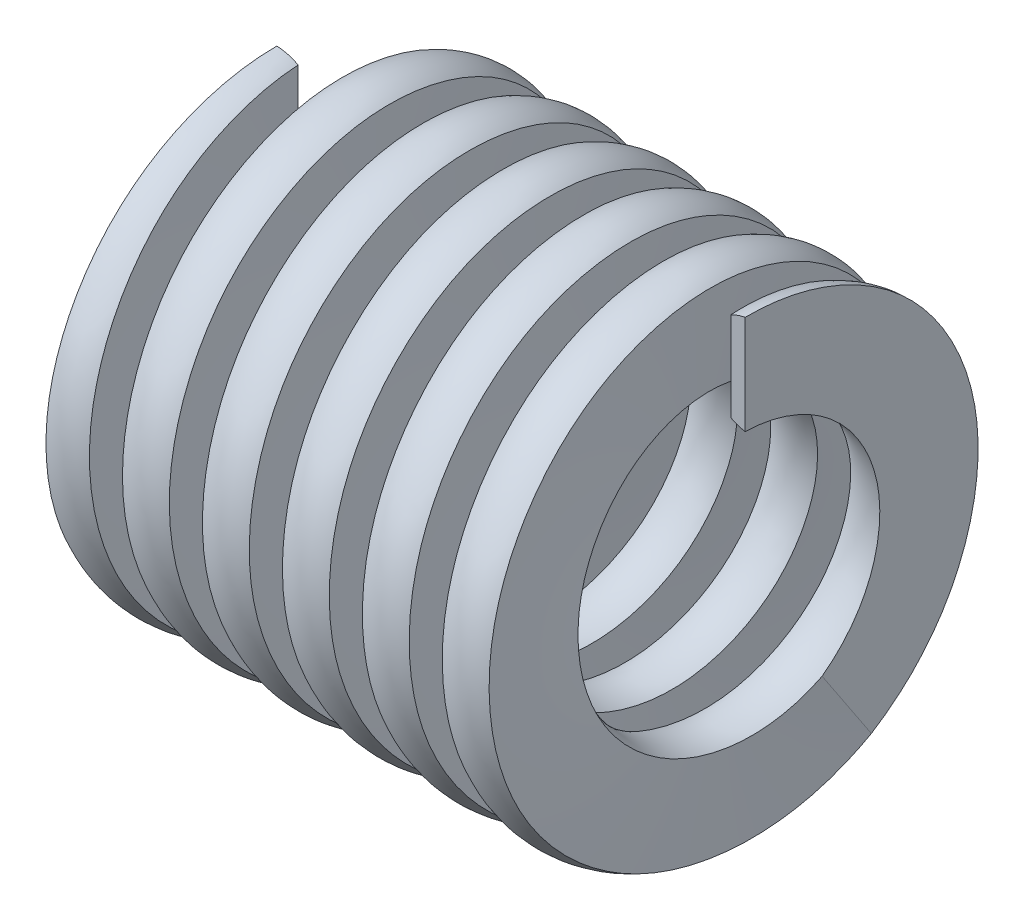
ISO-10303-21;
HEADER;
FILE_DESCRIPTION(('STEP AP214'),'2;1');
FILE_NAME('part.step','',(''),(''),'','','');
FILE_SCHEMA(('AUTOMOTIVE_DESIGN { 1 0 10303 214 1 1 1 1 }'));
ENDSEC;
DATA;
#1=APPLICATION_CONTEXT('core data for automotive mechanical design processes');
#2=APPLICATION_PROTOCOL_DEFINITION('international standard','automotive_design',2000,#1);
#3=PRODUCT_CONTEXT('',#1,'mechanical');
#4=PRODUCT('Part','Part','',(#3));
#5=PRODUCT_RELATED_PRODUCT_CATEGORY('part','',(#4));
#6=PRODUCT_DEFINITION_FORMATION('','',#4);
#7=PRODUCT_DEFINITION_CONTEXT('part definition',#1,'design');
#8=PRODUCT_DEFINITION('design','',#6,#7);
#9=PRODUCT_DEFINITION_SHAPE('','',#8);
#10=(LENGTH_UNIT() NAMED_UNIT(*) SI_UNIT(.MILLI.,.METRE.));
#11=(NAMED_UNIT(*) PLANE_ANGLE_UNIT() SI_UNIT($,.RADIAN.));
#12=(NAMED_UNIT(*) SI_UNIT($,.STERADIAN.) SOLID_ANGLE_UNIT());
#13=UNCERTAINTY_MEASURE_WITH_UNIT(LENGTH_MEASURE(1.E-05),#10,'distance_accuracy_value','');
#14=(GEOMETRIC_REPRESENTATION_CONTEXT(3) GLOBAL_UNCERTAINTY_ASSIGNED_CONTEXT((#13)) GLOBAL_UNIT_ASSIGNED_CONTEXT((#10,
#11,#12)) REPRESENTATION_CONTEXT('',''));
#15=CARTESIAN_POINT('',(0.,0.,0.));
#16=DIRECTION('',(0.,0.,1.));
#17=DIRECTION('',(1.,0.,0.));
#18=AXIS2_PLACEMENT_3D('',#15,#16,#17);
#19=CARTESIAN_POINT('',(-1.3843,7.55232597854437,0.));
#20=CARTESIAN_POINT('',(-1.3843,9.9695,0.));
#21=CARTESIAN_POINT('',(-1.3843,12.3866740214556,0.));
#22=CARTESIAN_POINT('',(-1.22073150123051,7.55232597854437,1.7906665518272));
#23=CARTESIAN_POINT('',(-1.22073150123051,9.9695,2.36378173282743));
#24=CARTESIAN_POINT('',(-1.22073150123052,12.3866740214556,2.93689691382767));
#25=CARTESIAN_POINT('',(-1.05716300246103,6.88995856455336,3.57387539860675));
#26=CARTESIAN_POINT('',(-1.05716300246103,9.09513732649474,4.71771887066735));
#27=CARTESIAN_POINT('',(-1.05716300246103,11.3003160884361,5.86156234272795));
#28=CARTESIAN_POINT('',(-0.730026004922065,4.55198510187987,6.28677548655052));
#29=CARTESIAN_POINT('',(-0.730026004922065,6.00887933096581,8.29890134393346));
#30=CARTESIAN_POINT('',(-0.730026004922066,7.46577356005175,10.3110272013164));
#31=CARTESIAN_POINT('',(-0.566457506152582,2.88611616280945,7.20516813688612));
#32=CARTESIAN_POINT('',(-0.566457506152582,3.80983754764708,9.51123189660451));
#33=CARTESIAN_POINT('',(-0.566457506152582,4.73355893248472,11.8172956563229));
#34=CARTESIAN_POINT('',(-0.239320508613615,-0.655966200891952,7.73393966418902));
#35=CARTESIAN_POINT('',(-0.239320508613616,-0.865912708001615,10.2092403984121));
#36=CARTESIAN_POINT('',(-0.239320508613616,-1.07585921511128,12.6845411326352));
#37=CARTESIAN_POINT('',(-0.0757520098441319,-2.51742768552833,7.34211633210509));
#38=CARTESIAN_POINT('',(-0.0757520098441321,-3.32314778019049,9.69201130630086));
#39=CARTESIAN_POINT('',(-0.0757520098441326,-4.12886787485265,12.0419062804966));
#40=CARTESIAN_POINT('',(0.251384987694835,-5.54578864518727,5.43031699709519));
#41=CARTESIAN_POINT('',(0.251384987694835,-7.32075655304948,7.16832740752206));
#42=CARTESIAN_POINT('',(0.251384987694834,-9.09572446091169,8.90633781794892));
#43=CARTESIAN_POINT('',(0.414953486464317,-6.70007570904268,3.91830318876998));
#44=CARTESIAN_POINT('',(0.414953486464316,-8.84448115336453,5.17238315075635));
#45=CARTESIAN_POINT('',(0.414953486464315,-10.9888865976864,6.42646311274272));
#46=CARTESIAN_POINT('',(0.742090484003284,-7.74602828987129,0.493112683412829));
#47=CARTESIAN_POINT('',(0.742090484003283,-10.225198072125,0.650936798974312));
#48=CARTESIAN_POINT('',(0.742090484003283,-12.7043678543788,0.808760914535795));
#49=CARTESIAN_POINT('',(0.905658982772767,-7.63333766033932,-1.40579890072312));
#50=CARTESIAN_POINT('',(0.905658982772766,-10.0764400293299,-1.85573453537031));
#51=CARTESIAN_POINT('',(0.905658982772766,-12.5195423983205,-2.3056701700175));
#52=CARTESIAN_POINT('',(1.23279598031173,-6.18961837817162,-4.68324019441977));
#53=CARTESIAN_POINT('',(1.23279598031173,-8.17064843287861,-6.18214352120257));
#54=CARTESIAN_POINT('',(1.23279598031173,-10.1516784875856,-7.68104684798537));
#55=CARTESIAN_POINT('',(1.39636447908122,-4.86460247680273,-6.04812013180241));
#56=CARTESIAN_POINT('',(1.39636447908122,-6.42155205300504,-7.98386269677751));
#57=CARTESIAN_POINT('',(1.39636447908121,-7.97850162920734,-9.91960526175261));
#58=CARTESIAN_POINT('',(1.72350147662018,-1.63138272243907,-7.58832687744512));
#59=CARTESIAN_POINT('',(1.72350147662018,-2.1535180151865,-10.0170232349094));
#60=CARTESIAN_POINT('',(1.72350147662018,-2.67565330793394,-12.4457195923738));
#61=CARTESIAN_POINT('',(1.88706997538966,0.263355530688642,-7.75723908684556));
#62=CARTESIAN_POINT('',(1.88706997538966,0.347644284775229,-10.2399969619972));
#63=CARTESIAN_POINT('',(1.88706997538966,0.431933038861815,-12.7227548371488));
#64=CARTESIAN_POINT('',(2.21420697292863,3.71803687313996,-6.81324564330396));
#65=CARTESIAN_POINT('',(2.21420697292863,4.9080202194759,-8.99387190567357));
#66=CARTESIAN_POINT('',(2.21420697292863,6.09800356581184,-11.1744981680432));
#67=CARTESIAN_POINT('',(2.37777547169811,5.26359202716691,-5.70427150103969));
#68=CARTESIAN_POINT('',(2.37777547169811,6.94824096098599,-7.52996294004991));
#69=CARTESIAN_POINT('',(2.37777547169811,8.63288989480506,-9.35565437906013));
#70=CARTESIAN_POINT('',(2.70491246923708,7.26429218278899,-2.73389346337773));
#71=CARTESIAN_POINT('',(2.70491246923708,9.58927900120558,-3.60889492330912));
#72=CARTESIAN_POINT('',(2.70491246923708,11.9142658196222,-4.4838963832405));
#73=CARTESIAN_POINT('',(2.86848096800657,7.71110473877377,-0.884860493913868));
#74=CARTESIAN_POINT('',(2.86848096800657,10.1790969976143,-1.16806619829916));
#75=CARTESIAN_POINT('',(2.86848096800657,12.6470892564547,-1.45127190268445));
#76=CARTESIAN_POINT('',(3.19561796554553,7.28752911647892,2.67133557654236));
#77=CARTESIAN_POINT('',(3.19561796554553,9.61995307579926,3.52631495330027));
#78=CARTESIAN_POINT('',(3.19561796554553,11.9523770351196,4.38129433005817));
#79=CARTESIAN_POINT('',(3.35918646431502,6.41890503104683,4.36368795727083));
#80=CARTESIAN_POINT('',(3.35918646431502,8.47331986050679,5.76031638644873));
#81=CARTESIAN_POINT('',(3.35918646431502,10.5277346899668,7.15694481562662));
#82=CARTESIAN_POINT('',(3.68632346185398,3.77647828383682,6.781026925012));
#83=CARTESIAN_POINT('',(3.68632346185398,4.9851662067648,8.95134136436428));
#84=CARTESIAN_POINT('',(3.68632346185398,6.19385412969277,11.1216558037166));
#85=CARTESIAN_POINT('',(3.84989196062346,2.01368070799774,7.49594586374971));
#86=CARTESIAN_POINT('',(3.84989196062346,2.6581731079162,9.89507504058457));
#87=CARTESIAN_POINT('',(3.84989196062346,3.30266550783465,12.2942042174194));
#88=CARTESIAN_POINT('',(4.17702895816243,-1.56607960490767,7.60207268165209));
#89=CARTESIAN_POINT('',(4.17702895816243,-2.06731418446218,10.0351684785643));
#90=CARTESIAN_POINT('',(4.17702895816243,-2.5685487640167,12.4682642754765));
#91=CARTESIAN_POINT('',(4.34059745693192,-3.36813348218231,6.99283856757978));
#92=CARTESIAN_POINT('',(4.34059745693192,-4.44612783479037,9.23094478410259));
#93=CARTESIAN_POINT('',(4.34059745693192,-5.52412218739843,11.4690510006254));
#94=CARTESIAN_POINT('',(4.66773445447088,-6.149124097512,4.73628411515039));
#95=CARTESIAN_POINT('',(4.66773445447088,-8.11719367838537,6.25216451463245));
#96=CARTESIAN_POINT('',(4.66773445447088,-10.0852632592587,7.7680449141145));
#97=CARTESIAN_POINT('',(4.83130295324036,-7.11647866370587,3.09836179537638));
#98=CARTESIAN_POINT('',(4.83130295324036,-9.39415674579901,4.0900138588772));
#99=CARTESIAN_POINT('',(4.83130295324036,-11.6718348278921,5.08166592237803));
#100=CARTESIAN_POINT('',(5.15843995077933,-7.74998166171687,-0.426495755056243));
#101=CARTESIAN_POINT('',(5.15843995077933,-10.2304167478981,-0.562998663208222));
#102=CARTESIAN_POINT('',(5.15843995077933,-12.7108518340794,-0.699501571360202));
#103=CARTESIAN_POINT('',(5.32200844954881,-7.4134917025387,-2.29875078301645));
#104=CARTESIAN_POINT('',(5.32200844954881,-9.78623085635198,-3.03448182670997));
#105=CARTESIAN_POINT('',(5.32200844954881,-12.1589700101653,-3.77021287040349));
#106=CARTESIAN_POINT('',(5.64914544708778,-5.59227237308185,-5.38243477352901));
#107=CARTESIAN_POINT('',(5.64914544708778,-7.38211771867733,-7.10512014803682));
#108=CARTESIAN_POINT('',(5.64914544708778,-9.17196306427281,-8.82780552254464));
#109=CARTESIAN_POINT('',(5.81271394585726,-4.11512795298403,-6.58102091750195));
#110=CARTESIAN_POINT('',(5.81271394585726,-5.43220303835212,-8.68732205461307));
#111=CARTESIAN_POINT('',(5.81271394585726,-6.7492781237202,-10.7936231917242));
#112=CARTESIAN_POINT('',(6.13985094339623,-0.722436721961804,-7.72801394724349));
#113=CARTESIAN_POINT('',(6.13985094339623,-0.953657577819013,-10.2014181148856));
#114=CARTESIAN_POINT('',(6.13985094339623,-1.18487843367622,-12.6748222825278));
#115=CARTESIAN_POINT('',(6.30341944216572,1.17898032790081,-7.67164387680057));
#116=CARTESIAN_POINT('',(6.30341944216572,1.5563211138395,-10.127006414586));
#117=CARTESIAN_POINT('',(6.30341944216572,1.93366189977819,-12.5823689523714));
#118=CARTESIAN_POINT('',(6.63055643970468,4.49776449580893,-6.32568011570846));
#119=CARTESIAN_POINT('',(6.63055643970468,5.93730504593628,-8.35025766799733));
#120=CARTESIAN_POINT('',(6.63055643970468,7.37684559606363,-10.3748352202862));
#121=CARTESIAN_POINT('',(6.79412493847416,5.90130965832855,-5.04169204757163));
#122=CARTESIAN_POINT('',(6.79412493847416,7.79006451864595,-6.65532036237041));
#123=CARTESIAN_POINT('',(6.79412493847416,9.67881937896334,-8.26894867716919));
#124=CARTESIAN_POINT('',(7.12126193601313,7.53665106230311,-1.85553365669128));
#125=CARTESIAN_POINT('',(7.12126193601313,9.9488082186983,-2.44941000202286));
#126=CARTESIAN_POINT('',(7.12126193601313,12.3609653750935,-3.04328634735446));
#127=CARTESIAN_POINT('',(7.28483043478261,7.76163649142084,0.0333670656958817));
#128=CARTESIAN_POINT('',(7.28483043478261,10.2458017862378,0.0440464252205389));
#129=CARTESIAN_POINT('',(7.28483043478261,12.7299670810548,0.0547257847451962));
#130=CARTESIAN_POINT('',(7.61196743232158,6.92043132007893,3.51450490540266));
#131=CARTESIAN_POINT('',(7.61196743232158,9.1353630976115,4.63934644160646));
#132=CARTESIAN_POINT('',(7.61196743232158,11.3502948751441,5.76418797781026));
#133=CARTESIAN_POINT('',(7.77553593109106,5.85774414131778,5.09224390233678));
#134=CARTESIAN_POINT('',(7.77553593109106,7.73255555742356,6.72205168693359));
#135=CARTESIAN_POINT('',(7.77553593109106,9.60736697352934,8.3518594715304));
#136=CARTESIAN_POINT('',(8.10267292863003,2.94795798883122,7.18008760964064));
#137=CARTESIAN_POINT('',(8.10267292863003,3.89147227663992,9.47812417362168));
#138=CARTESIAN_POINT('',(8.10267292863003,4.83498656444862,11.7761607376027));
#139=CARTESIAN_POINT('',(8.26624142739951,1.1129775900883,7.68149694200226));
#140=CARTESIAN_POINT('',(8.26624142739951,1.46919374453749,10.1400130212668));
#141=CARTESIAN_POINT('',(8.26624142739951,1.82540989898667,12.5985291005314));
#142=CARTESIAN_POINT('',(8.59337842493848,-2.45420868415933,7.3634892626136));
#143=CARTESIAN_POINT('',(8.59337842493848,-3.23969510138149,9.72022479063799));
#144=CARTESIAN_POINT('',(8.59337842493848,-4.02518151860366,12.0769603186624));
#145=CARTESIAN_POINT('',(8.75694692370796,-4.1715580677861,6.54539667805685));
#146=CARTESIAN_POINT('',(8.75694692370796,-5.50669400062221,8.64029603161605));
#147=CARTESIAN_POINT('',(8.75694692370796,-6.84182993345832,10.7351953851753));
#148=CARTESIAN_POINT('',(9.08408392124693,-6.66613932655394,3.97576418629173));
#149=CARTESIAN_POINT('',(9.08408392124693,-8.79968319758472,5.24823493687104));
#150=CARTESIAN_POINT('',(9.08408392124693,-10.9332270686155,6.52070568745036));
#151=CARTESIAN_POINT('',(9.24765242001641,-7.43298185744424,2.23492619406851));
#152=CARTESIAN_POINT('',(9.24765242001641,-9.81195896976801,2.95022973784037));
#153=CARTESIAN_POINT('',(9.24765242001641,-12.1909360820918,3.66553328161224));
#154=CARTESIAN_POINT('',(9.57478941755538,-7.64514227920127,-1.34011712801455));
#155=CARTESIAN_POINT('',(9.57478941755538,-10.0920227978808,-1.7690308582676));
#156=CARTESIAN_POINT('',(9.57478941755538,-12.5389033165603,-2.19794458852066));
#157=CARTESIAN_POINT('',(9.73835791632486,-7.08957657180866,-3.15943324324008));
#158=CARTESIAN_POINT('',(9.73835791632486,-9.35864445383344,-4.17063164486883));
#159=CARTESIAN_POINT('',(9.73835791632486,-11.6277123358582,-5.18183004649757));
#160=CARTESIAN_POINT('',(10.0654949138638,-4.91642312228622,-6.00607176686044));
#161=CARTESIAN_POINT('',(10.0654949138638,-6.48995825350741,-7.9283564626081));
#162=CARTESIAN_POINT('',(10.0654949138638,-8.06349338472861,-9.85064115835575));
#163=CARTESIAN_POINT('',(10.2290634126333,-3.30788605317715,-7.02153859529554));
#164=CARTESIAN_POINT('',(10.2290634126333,-4.36659780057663,-9.26883045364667));
#165=CARTESIAN_POINT('',(10.2290634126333,-5.42530954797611,-11.5161223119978));
#166=CARTESIAN_POINT('',(10.5562004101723,0.196650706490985,-7.75921664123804));
#167=CARTESIAN_POINT('',(10.5562004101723,0.259590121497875,-10.2426074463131));
#168=CARTESIAN_POINT('',(10.5562004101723,0.322529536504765,-12.7259982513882));
#169=CARTESIAN_POINT('',(10.7197689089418,2.07805482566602,-7.47835560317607));
#170=CARTESIAN_POINT('',(10.7197689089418,2.74315060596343,-9.87185489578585));
#171=CARTESIAN_POINT('',(10.7197689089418,3.40824638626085,-12.2653541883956));
#172=CARTESIAN_POINT('',(11.0469059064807,5.21435336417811,-5.74931590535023));
#173=CARTESIAN_POINT('',(11.0469059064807,6.8832431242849,-7.58942411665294));
#174=CARTESIAN_POINT('',(11.0469059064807,8.55213288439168,-9.42953232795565));
#175=CARTESIAN_POINT('',(11.2104744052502,6.45618583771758,-4.30833828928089));
#176=CARTESIAN_POINT('',(11.2104744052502,8.52253264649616,-5.68725167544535));
#177=CARTESIAN_POINT('',(11.2104744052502,10.5888794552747,-7.0661650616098));
#178=CARTESIAN_POINT('',(11.5376114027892,7.70321188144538,-0.951126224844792));
#179=CARTESIAN_POINT('',(11.5376114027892,10.1686779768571,-1.25554073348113));
#180=CARTESIAN_POINT('',(11.5376114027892,12.6341440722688,-1.55995524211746));
#181=CARTESIAN_POINT('',(11.7011799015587,7.70321188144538,0.951126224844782));
#182=CARTESIAN_POINT('',(11.7011799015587,10.1686779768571,1.25554073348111));
#183=CARTESIAN_POINT('',(11.7011799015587,12.6341440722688,1.55995524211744));
#184=CARTESIAN_POINT('',(12.0283168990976,6.45618583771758,4.30833828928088));
#185=CARTESIAN_POINT('',(12.0283168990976,8.52253264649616,5.68725167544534));
#186=CARTESIAN_POINT('',(12.0283168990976,10.5888794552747,7.06616506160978));
#187=CARTESIAN_POINT('',(12.1918853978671,5.21435336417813,5.74931590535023));
#188=CARTESIAN_POINT('',(12.1918853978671,6.88324312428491,7.58942411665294));
#189=CARTESIAN_POINT('',(12.1918853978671,8.55213288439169,9.42953232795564));
#190=CARTESIAN_POINT('',(12.5190223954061,2.07805482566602,7.47835560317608));
#191=CARTESIAN_POINT('',(12.5190223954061,2.74315060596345,9.87185489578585));
#192=CARTESIAN_POINT('',(12.5190223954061,3.40824638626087,12.2653541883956));
#193=CARTESIAN_POINT('',(12.6825908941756,0.196650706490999,7.75921664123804));
#194=CARTESIAN_POINT('',(12.6825908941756,0.259590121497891,10.2426074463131));
#195=CARTESIAN_POINT('',(12.6825908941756,0.322529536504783,12.7259982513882));
#196=CARTESIAN_POINT('',(13.0097278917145,-3.30788605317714,7.02153859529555));
#197=CARTESIAN_POINT('',(13.0097278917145,-4.36659780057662,9.26883045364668));
#198=CARTESIAN_POINT('',(13.0097278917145,-5.4253095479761,11.5161223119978));
#199=CARTESIAN_POINT('',(13.173296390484,-4.91642312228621,6.00607176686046));
#200=CARTESIAN_POINT('',(13.173296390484,-6.4899582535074,7.92835646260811));
#201=CARTESIAN_POINT('',(13.173296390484,-8.06349338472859,9.85064115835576));
#202=CARTESIAN_POINT('',(13.500433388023,-7.08957657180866,3.1594332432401));
#203=CARTESIAN_POINT('',(13.500433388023,-9.35864445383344,4.17063164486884));
#204=CARTESIAN_POINT('',(13.500433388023,-11.6277123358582,5.18183004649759));
#205=CARTESIAN_POINT('',(13.6640018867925,-7.64514227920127,1.34011712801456));
#206=CARTESIAN_POINT('',(13.6640018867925,-10.0920227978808,1.76903085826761));
#207=CARTESIAN_POINT('',(13.6640018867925,-12.5389033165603,2.19794458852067));
#208=CARTESIAN_POINT('',(13.9911388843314,-7.43298185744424,-2.2349261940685));
#209=CARTESIAN_POINT('',(13.9911388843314,-9.81195896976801,-2.95022973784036));
#210=CARTESIAN_POINT('',(13.9911388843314,-12.1909360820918,-3.66553328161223));
#211=CARTESIAN_POINT('',(14.1547073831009,-6.66613932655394,-3.97576418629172));
#212=CARTESIAN_POINT('',(14.1547073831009,-8.79968319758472,-5.24823493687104));
#213=CARTESIAN_POINT('',(14.1547073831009,-10.9332270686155,-6.52070568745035));
#214=CARTESIAN_POINT('',(14.4818443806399,-4.1715580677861,-6.54539667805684));
#215=CARTESIAN_POINT('',(14.4818443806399,-5.5066940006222,-8.64029603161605));
#216=CARTESIAN_POINT('',(14.4818443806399,-6.84182993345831,-10.7351953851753));
#217=CARTESIAN_POINT('',(14.6454128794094,-2.45420868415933,-7.3634892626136));
#218=CARTESIAN_POINT('',(14.6454128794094,-3.23969510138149,-9.720224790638));
#219=CARTESIAN_POINT('',(14.6454128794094,-4.02518151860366,-12.0769603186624));
#220=CARTESIAN_POINT('',(14.9725498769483,1.11297759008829,-7.68149694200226));
#221=CARTESIAN_POINT('',(14.9725498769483,1.46919374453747,-10.1400130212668));
#222=CARTESIAN_POINT('',(14.9725498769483,1.82540989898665,-12.5985291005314));
#223=CARTESIAN_POINT('',(15.1361183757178,2.94795798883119,-7.18008760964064));
#224=CARTESIAN_POINT('',(15.1361183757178,3.89147227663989,-9.47812417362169));
#225=CARTESIAN_POINT('',(15.1361183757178,4.83498656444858,-11.7761607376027));
#226=CARTESIAN_POINT('',(15.4632553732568,5.85774414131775,-5.09224390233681));
#227=CARTESIAN_POINT('',(15.4632553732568,7.73255555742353,-6.72205168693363));
#228=CARTESIAN_POINT('',(15.4632553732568,9.6073669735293,-8.35185947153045));
#229=CARTESIAN_POINT('',(15.6268238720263,6.92043132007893,-3.5145049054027));
#230=CARTESIAN_POINT('',(15.6268238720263,9.13536309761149,-4.63934644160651));
#231=CARTESIAN_POINT('',(15.6268238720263,11.350294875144,-5.76418797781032));
#232=CARTESIAN_POINT('',(15.9539608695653,7.76163649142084,-0.0333670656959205));
#233=CARTESIAN_POINT('',(15.9539608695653,10.2458017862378,-0.0440464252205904));
#234=CARTESIAN_POINT('',(15.9539608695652,12.7299670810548,-0.0547257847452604));
#235=CARTESIAN_POINT('',(16.1175293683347,7.53665106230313,1.85553365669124));
#236=CARTESIAN_POINT('',(16.1175293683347,9.94880821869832,2.44941000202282));
#237=CARTESIAN_POINT('',(16.1175293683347,12.3609653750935,3.04328634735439));
#238=CARTESIAN_POINT('',(16.4446663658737,5.90130965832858,5.04169204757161));
#239=CARTESIAN_POINT('',(16.4446663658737,7.79006451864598,6.65532036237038));
#240=CARTESIAN_POINT('',(16.4446663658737,9.67881937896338,8.26894867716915));
#241=CARTESIAN_POINT('',(16.6082348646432,4.49776449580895,6.32568011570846));
#242=CARTESIAN_POINT('',(16.6082348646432,5.93730504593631,8.35025766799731));
#243=CARTESIAN_POINT('',(16.6082348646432,7.37684559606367,10.3748352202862));
#244=CARTESIAN_POINT('',(16.9353718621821,1.17898032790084,7.67164387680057));
#245=CARTESIAN_POINT('',(16.9353718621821,1.55632111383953,10.127006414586));
#246=CARTESIAN_POINT('',(16.9353718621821,1.93366189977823,12.5823689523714));
#247=CARTESIAN_POINT('',(17.0989403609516,-0.722436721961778,7.72801394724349));
#248=CARTESIAN_POINT('',(17.0989403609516,-0.953657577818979,10.2014181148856));
#249=CARTESIAN_POINT('',(17.0989403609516,-1.18487843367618,12.6748222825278));
#250=CARTESIAN_POINT('',(17.4260773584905,-4.11512795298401,6.58102091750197));
#251=CARTESIAN_POINT('',(17.4260773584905,-5.43220303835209,8.68732205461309));
#252=CARTESIAN_POINT('',(17.4260773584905,-6.74927812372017,10.7936231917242));
#253=CARTESIAN_POINT('',(17.58964585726,-5.59227237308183,5.38243477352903));
#254=CARTESIAN_POINT('',(17.58964585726,-7.38211771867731,7.10512014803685));
#255=CARTESIAN_POINT('',(17.58964585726,-9.17196306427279,8.82780552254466));
#256=CARTESIAN_POINT('',(17.916782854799,-7.4134917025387,2.29875078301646));
#257=CARTESIAN_POINT('',(17.916782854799,-9.78623085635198,3.03448182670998));
#258=CARTESIAN_POINT('',(17.916782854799,-12.1589700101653,3.77021287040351));
#259=CARTESIAN_POINT('',(18.0803513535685,-7.74998166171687,0.426495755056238));
#260=CARTESIAN_POINT('',(18.0803513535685,-10.2304167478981,0.562998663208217));
#261=CARTESIAN_POINT('',(18.0803513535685,-12.7108518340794,0.699501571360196));
#262=CARTESIAN_POINT('',(18.4074883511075,-7.11647866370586,-3.09836179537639));
#263=CARTESIAN_POINT('',(18.4074883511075,-9.394156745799,-4.09001385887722));
#264=CARTESIAN_POINT('',(18.4074883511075,-11.6718348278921,-5.08166592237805));
#265=CARTESIAN_POINT('',(18.5710568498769,-6.149124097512,-4.73628411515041));
#266=CARTESIAN_POINT('',(18.5710568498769,-8.11719367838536,-6.25216451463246));
#267=CARTESIAN_POINT('',(18.5710568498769,-10.0852632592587,-7.76804491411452));
#268=CARTESIAN_POINT('',(18.8981938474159,-3.36813348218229,-6.9928385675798));
#269=CARTESIAN_POINT('',(18.8981938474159,-4.44612783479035,-9.23094478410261));
#270=CARTESIAN_POINT('',(18.8981938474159,-5.5241221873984,-11.4690510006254));
#271=CARTESIAN_POINT('',(19.0617623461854,-1.56607960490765,-7.6020726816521));
#272=CARTESIAN_POINT('',(19.0617623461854,-2.06731418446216,-10.0351684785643));
#273=CARTESIAN_POINT('',(19.0617623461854,-2.56854876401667,-12.4682642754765));
#274=CARTESIAN_POINT('',(19.3888993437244,2.01368070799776,-7.49594586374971));
#275=CARTESIAN_POINT('',(19.3888993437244,2.65817310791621,-9.89507504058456));
#276=CARTESIAN_POINT('',(19.3888993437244,3.30266550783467,-12.2942042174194));
#277=CARTESIAN_POINT('',(19.5524678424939,3.77647828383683,-6.78102692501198));
#278=CARTESIAN_POINT('',(19.5524678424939,4.9851662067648,-8.95134136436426));
#279=CARTESIAN_POINT('',(19.5524678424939,6.19385412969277,-11.1216558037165));
#280=CARTESIAN_POINT('',(19.8796048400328,6.41890503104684,-4.36368795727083));
#281=CARTESIAN_POINT('',(19.8796048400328,8.47331986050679,-5.76031638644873));
#282=CARTESIAN_POINT('',(19.8796048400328,10.5277346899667,-7.15694481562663));
#283=CARTESIAN_POINT('',(20.0431733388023,7.28752911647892,-2.67133557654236));
#284=CARTESIAN_POINT('',(20.0431733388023,9.61995307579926,-3.52631495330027));
#285=CARTESIAN_POINT('',(20.0431733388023,11.9523770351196,-4.38129433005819));
#286=CARTESIAN_POINT('',(20.3703103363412,7.71110473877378,0.884860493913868));
#287=CARTESIAN_POINT('',(20.3703103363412,10.1790969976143,1.16806619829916));
#288=CARTESIAN_POINT('',(20.3703103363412,12.6470892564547,1.45127190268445));
#289=CARTESIAN_POINT('',(20.5338788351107,7.26429218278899,2.73389346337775));
#290=CARTESIAN_POINT('',(20.5338788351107,9.58927900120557,3.60889492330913));
#291=CARTESIAN_POINT('',(20.5338788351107,11.9142658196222,4.48389638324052));
#292=CARTESIAN_POINT('',(20.8610158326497,5.26359202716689,5.70427150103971));
#293=CARTESIAN_POINT('',(20.8610158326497,6.94824096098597,7.52996294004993));
#294=CARTESIAN_POINT('',(20.8610158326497,8.63288989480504,9.35565437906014));
#295=CARTESIAN_POINT('',(21.0245843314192,3.71803687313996,6.81324564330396));
#296=CARTESIAN_POINT('',(21.0245843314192,4.9080202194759,8.99387190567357));
#297=CARTESIAN_POINT('',(21.0245843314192,6.09800356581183,11.1744981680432));
#298=CARTESIAN_POINT('',(21.3517213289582,0.263355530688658,7.75723908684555));
#299=CARTESIAN_POINT('',(21.3517213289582,0.347644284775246,10.2399969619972));
#300=CARTESIAN_POINT('',(21.3517213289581,0.431933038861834,12.7227548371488));
#301=CARTESIAN_POINT('',(21.5152898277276,-1.63138272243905,7.58832687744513));
#302=CARTESIAN_POINT('',(21.5152898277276,-2.15351801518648,10.0170232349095));
#303=CARTESIAN_POINT('',(21.5152898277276,-2.67565330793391,12.4457195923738));
#304=CARTESIAN_POINT('',(21.8424268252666,-4.86460247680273,6.04812013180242));
#305=CARTESIAN_POINT('',(21.8424268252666,-6.42155205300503,7.98386269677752));
#306=CARTESIAN_POINT('',(21.8424268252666,-7.97850162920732,9.91960526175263));
#307=CARTESIAN_POINT('',(22.0059953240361,-6.18961837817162,4.68324019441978));
#308=CARTESIAN_POINT('',(22.0059953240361,-8.17064843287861,6.18214352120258));
#309=CARTESIAN_POINT('',(22.0059953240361,-10.1516784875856,7.68104684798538));
#310=CARTESIAN_POINT('',(22.3331323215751,-7.63333766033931,1.40579890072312));
#311=CARTESIAN_POINT('',(22.3331323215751,-10.0764400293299,1.85573453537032));
#312=CARTESIAN_POINT('',(22.3331323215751,-12.5195423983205,2.30567017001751));
#313=CARTESIAN_POINT('',(22.4967008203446,-7.74602828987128,-0.493112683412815));
#314=CARTESIAN_POINT('',(22.4967008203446,-10.225198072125,-0.650936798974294));
#315=CARTESIAN_POINT('',(22.4967008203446,-12.7043678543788,-0.808760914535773));
#316=CARTESIAN_POINT('',(22.8238378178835,-6.70007570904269,-3.91830318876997));
#317=CARTESIAN_POINT('',(22.8238378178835,-8.84448115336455,-5.17238315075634));
#318=CARTESIAN_POINT('',(22.8238378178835,-10.9888865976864,-6.4264631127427));
#319=CARTESIAN_POINT('',(22.987406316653,-5.54578864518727,-5.43031699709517));
#320=CARTESIAN_POINT('',(22.987406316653,-7.32075655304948,-7.16832740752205));
#321=CARTESIAN_POINT('',(22.987406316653,-9.09572446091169,-8.90633781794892));
#322=CARTESIAN_POINT('',(23.314543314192,-2.51742768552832,-7.34211633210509));
#323=CARTESIAN_POINT('',(23.314543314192,-3.32314778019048,-9.69201130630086));
#324=CARTESIAN_POINT('',(23.314543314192,-4.12886787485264,-12.0419062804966));
#325=CARTESIAN_POINT('',(23.4781118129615,-0.655966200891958,-7.73393966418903));
#326=CARTESIAN_POINT('',(23.4781118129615,-0.865912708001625,-10.2092403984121));
#327=CARTESIAN_POINT('',(23.4781118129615,-1.07585921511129,-12.6845411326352));
#328=CARTESIAN_POINT('',(23.8052488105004,2.88611616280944,-7.20516813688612));
#329=CARTESIAN_POINT('',(23.8052488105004,3.80983754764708,-9.51123189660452));
#330=CARTESIAN_POINT('',(23.8052488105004,4.73355893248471,-11.8172956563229));
#331=CARTESIAN_POINT('',(23.9688173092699,4.55198510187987,-6.28677548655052));
#332=CARTESIAN_POINT('',(23.9688173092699,6.00887933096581,-8.29890134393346));
#333=CARTESIAN_POINT('',(23.9688173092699,7.46577356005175,-10.3110272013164));
#334=CARTESIAN_POINT('',(24.2959543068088,6.88995856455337,-3.57387539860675));
#335=CARTESIAN_POINT('',(24.2959543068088,9.09513732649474,-4.71771887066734));
#336=CARTESIAN_POINT('',(24.2959543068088,11.3003160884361,-5.86156234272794));
#337=CARTESIAN_POINT('',(24.4595228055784,7.55232597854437,-1.7906665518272));
#338=CARTESIAN_POINT('',(24.4595228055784,9.9695,-2.36378173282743));
#339=CARTESIAN_POINT('',(24.4595228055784,12.3866740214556,-2.93689691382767));
#340=CARTESIAN_POINT('',(24.6230913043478,7.55232597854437,0.));
#341=CARTESIAN_POINT('',(24.6230913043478,9.9695,0.));
#342=CARTESIAN_POINT('',(24.6230913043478,12.3866740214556,0.));
#343=B_SPLINE_SURFACE_WITH_KNOTS('',3,2,((#19,#20,#21),(#22,#23,#24),(#25,#26,#27),(#28,#29,
#30),(#31,#32,#33),(#34,#35,#36),(#37,#38,#39),(#40,#41,#42),(#43,#44,#45),(#46,#47,#48),(#49,
#50,#51),(#52,#53,#54),(#55,#56,#57),(#58,#59,#60),(#61,#62,#63),(#64,#65,#66),(#67,#68,#69),
(#70,#71,#72),(#73,#74,#75),(#76,#77,#78),(#79,#80,#81),(#82,#83,#84),(#85,#86,#87),(#88,#89,
#90),(#91,#92,#93),(#94,#95,#96),(#97,#98,#99),(#100,#101,#102),(#103,#104,#105),(#106,#107,
#108),(#109,#110,#111),(#112,#113,#114),(#115,#116,#117),(#118,#119,#120),(#121,#122,#123),
(#124,#125,#126),(#127,#128,#129),(#130,#131,#132),(#133,#134,#135),(#136,#137,#138),(#139,#140,
#141),(#142,#143,#144),(#145,#146,#147),(#148,#149,#150),(#151,#152,#153),(#154,#155,#156),
(#157,#158,#159),(#160,#161,#162),(#163,#164,#165),(#166,#167,#168),(#169,#170,#171),(#172,#173,
#174),(#175,#176,#177),(#178,#179,#180),(#181,#182,#183),(#184,#185,#186),(#187,#188,#189),
(#190,#191,#192),(#193,#194,#195),(#196,#197,#198),(#199,#200,#201),(#202,#203,#204),(#205,#206,
#207),(#208,#209,#210),(#211,#212,#213),(#214,#215,#216),(#217,#218,#219),(#220,#221,#222),
(#223,#224,#225),(#226,#227,#228),(#229,#230,#231),(#232,#233,#234),(#235,#236,#237),(#238,#239,
#240),(#241,#242,#243),(#244,#245,#246),(#247,#248,#249),(#250,#251,#252),(#253,#254,#255),
(#256,#257,#258),(#259,#260,#261),(#262,#263,#264),(#265,#266,#267),(#268,#269,#270),(#271,#272,
#273),(#274,#275,#276),(#277,#278,#279),(#280,#281,#282),(#283,#284,#285),(#286,#287,#288),
(#289,#290,#291),(#292,#293,#294),(#295,#296,#297),(#298,#299,#300),(#301,#302,#303),(#304,#305,
#306),(#307,#308,#309),(#310,#311,#312),(#313,#314,#315),(#316,#317,#318),(#319,#320,#321),
(#322,#323,#324),(#325,#326,#327),(#328,#329,#330),(#331,#332,#333),(#334,#335,#336),(#337,#338,
#339),(#340,#341,#342)),.UNSPECIFIED.,.F.,.F.,.F.,(4,2,2,2,2,2,2,2,2,2,2,2,2,2,2,2,2,2,2,2,2,2,
2,2,2,2,2,2,2,2,2,2,2,2,2,2,2,2,2,2,2,2,2,2,2,2,2,2,2,2,2,2,2,4),(3,3),(0.,0.0188679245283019,
0.0377358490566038,0.0566037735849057,0.0754716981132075,0.0943396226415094,0.113207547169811,
0.132075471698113,0.150943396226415,0.169811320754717,0.188679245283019,0.207547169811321,
0.226415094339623,0.245283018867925,0.264150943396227,0.283018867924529,0.30188679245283,
0.320754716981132,0.339622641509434,0.358490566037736,0.377358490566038,0.396226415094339,
0.415094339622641,0.433962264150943,0.452830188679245,0.471698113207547,0.490566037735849,
0.509433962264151,0.528301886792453,0.547169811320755,0.566037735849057,0.584905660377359,
0.60377358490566,0.622641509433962,0.641509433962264,0.660377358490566,0.679245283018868,
0.69811320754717,0.716981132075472,0.735849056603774,0.754716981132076,0.773584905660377,
0.792452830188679,0.811320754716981,0.830188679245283,0.849056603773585,0.867924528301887,
0.886792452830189,0.905660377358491,0.924528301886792,0.943396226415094,0.962264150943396,
0.981132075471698,1.),(0.,1.),.UNSPECIFIED.);
#344=CARTESIAN_POINT('',(-1.3843,12.3866740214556,0.));
#345=CARTESIAN_POINT('',(-1.22073150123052,12.3866740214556,2.93689691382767));
#346=CARTESIAN_POINT('',(-1.05716300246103,11.3003160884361,5.86156234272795));
#347=CARTESIAN_POINT('',(-0.730026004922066,7.46577356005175,10.3110272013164));
#348=CARTESIAN_POINT('',(-0.566457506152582,4.73355893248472,11.8172956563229));
#349=CARTESIAN_POINT('',(-0.239320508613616,-1.07585921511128,12.6845411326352));
#350=CARTESIAN_POINT('',(-0.0757520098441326,-4.12886787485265,12.0419062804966));
#351=CARTESIAN_POINT('',(0.251384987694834,-9.09572446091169,8.90633781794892));
#352=CARTESIAN_POINT('',(0.414953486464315,-10.9888865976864,6.42646311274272));
#353=CARTESIAN_POINT('',(0.742090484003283,-12.7043678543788,0.808760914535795));
#354=CARTESIAN_POINT('',(0.905658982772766,-12.5195423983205,-2.3056701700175));
#355=CARTESIAN_POINT('',(1.23279598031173,-10.1516784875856,-7.68104684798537));
#356=CARTESIAN_POINT('',(1.39636447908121,-7.97850162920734,-9.91960526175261));
#357=CARTESIAN_POINT('',(1.72350147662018,-2.67565330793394,-12.4457195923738));
#358=CARTESIAN_POINT('',(1.88706997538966,0.431933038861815,-12.7227548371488));
#359=CARTESIAN_POINT('',(2.21420697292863,6.09800356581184,-11.1744981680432));
#360=CARTESIAN_POINT('',(2.37777547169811,8.63288989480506,-9.35565437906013));
#361=CARTESIAN_POINT('',(2.70491246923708,11.9142658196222,-4.4838963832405));
#362=CARTESIAN_POINT('',(2.86848096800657,12.6470892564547,-1.45127190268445));
#363=CARTESIAN_POINT('',(3.19561796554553,11.9523770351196,4.38129433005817));
#364=CARTESIAN_POINT('',(3.35918646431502,10.5277346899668,7.15694481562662));
#365=CARTESIAN_POINT('',(3.68632346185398,6.19385412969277,11.1216558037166));
#366=CARTESIAN_POINT('',(3.84989196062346,3.30266550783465,12.2942042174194));
#367=CARTESIAN_POINT('',(4.17702895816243,-2.5685487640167,12.4682642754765));
#368=CARTESIAN_POINT('',(4.34059745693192,-5.52412218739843,11.4690510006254));
#369=CARTESIAN_POINT('',(4.66773445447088,-10.0852632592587,7.7680449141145));
#370=CARTESIAN_POINT('',(4.83130295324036,-11.6718348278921,5.08166592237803));
#371=CARTESIAN_POINT('',(5.15843995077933,-12.7108518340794,-0.699501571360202));
#372=CARTESIAN_POINT('',(5.32200844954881,-12.1589700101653,-3.77021287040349));
#373=CARTESIAN_POINT('',(5.64914544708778,-9.17196306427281,-8.82780552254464));
#374=CARTESIAN_POINT('',(5.81271394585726,-6.7492781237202,-10.7936231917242));
#375=CARTESIAN_POINT('',(6.13985094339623,-1.18487843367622,-12.6748222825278));
#376=CARTESIAN_POINT('',(6.30341944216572,1.93366189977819,-12.5823689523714));
#377=CARTESIAN_POINT('',(6.63055643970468,7.37684559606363,-10.3748352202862));
#378=CARTESIAN_POINT('',(6.79412493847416,9.67881937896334,-8.26894867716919));
#379=CARTESIAN_POINT('',(7.12126193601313,12.3609653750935,-3.04328634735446));
#380=CARTESIAN_POINT('',(7.28483043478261,12.7299670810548,0.0547257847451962));
#381=CARTESIAN_POINT('',(7.61196743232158,11.3502948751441,5.76418797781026));
#382=CARTESIAN_POINT('',(7.77553593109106,9.60736697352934,8.3518594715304));
#383=CARTESIAN_POINT('',(8.10267292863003,4.83498656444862,11.7761607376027));
#384=CARTESIAN_POINT('',(8.26624142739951,1.82540989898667,12.5985291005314));
#385=CARTESIAN_POINT('',(8.59337842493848,-4.02518151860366,12.0769603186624));
#386=CARTESIAN_POINT('',(8.75694692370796,-6.84182993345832,10.7351953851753));
#387=CARTESIAN_POINT('',(9.08408392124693,-10.9332270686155,6.52070568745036));
#388=CARTESIAN_POINT('',(9.24765242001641,-12.1909360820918,3.66553328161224));
#389=CARTESIAN_POINT('',(9.57478941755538,-12.5389033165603,-2.19794458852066));
#390=CARTESIAN_POINT('',(9.73835791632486,-11.6277123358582,-5.18183004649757));
#391=CARTESIAN_POINT('',(10.0654949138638,-8.06349338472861,-9.85064115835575));
#392=CARTESIAN_POINT('',(10.2290634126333,-5.42530954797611,-11.5161223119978));
#393=CARTESIAN_POINT('',(10.5562004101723,0.322529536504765,-12.7259982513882));
#394=CARTESIAN_POINT('',(10.7197689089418,3.40824638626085,-12.2653541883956));
#395=CARTESIAN_POINT('',(11.0469059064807,8.55213288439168,-9.42953232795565));
#396=CARTESIAN_POINT('',(11.2104744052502,10.5888794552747,-7.0661650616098));
#397=CARTESIAN_POINT('',(11.5376114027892,12.6341440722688,-1.55995524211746));
#398=CARTESIAN_POINT('',(11.7011799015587,12.6341440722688,1.55995524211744));
#399=CARTESIAN_POINT('',(12.0283168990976,10.5888794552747,7.06616506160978));
#400=CARTESIAN_POINT('',(12.1918853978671,8.55213288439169,9.42953232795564));
#401=CARTESIAN_POINT('',(12.5190223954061,3.40824638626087,12.2653541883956));
#402=CARTESIAN_POINT('',(12.6825908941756,0.322529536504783,12.7259982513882));
#403=CARTESIAN_POINT('',(13.0097278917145,-5.4253095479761,11.5161223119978));
#404=CARTESIAN_POINT('',(13.173296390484,-8.06349338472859,9.85064115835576));
#405=CARTESIAN_POINT('',(13.500433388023,-11.6277123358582,5.18183004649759));
#406=CARTESIAN_POINT('',(13.6640018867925,-12.5389033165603,2.19794458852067));
#407=CARTESIAN_POINT('',(13.9911388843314,-12.1909360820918,-3.66553328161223));
#408=CARTESIAN_POINT('',(14.1547073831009,-10.9332270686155,-6.52070568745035));
#409=CARTESIAN_POINT('',(14.4818443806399,-6.84182993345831,-10.7351953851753));
#410=CARTESIAN_POINT('',(14.6454128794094,-4.02518151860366,-12.0769603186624));
#411=CARTESIAN_POINT('',(14.9725498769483,1.82540989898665,-12.5985291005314));
#412=CARTESIAN_POINT('',(15.1361183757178,4.83498656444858,-11.7761607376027));
#413=CARTESIAN_POINT('',(15.4632553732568,9.6073669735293,-8.35185947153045));
#414=CARTESIAN_POINT('',(15.6268238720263,11.350294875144,-5.76418797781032));
#415=CARTESIAN_POINT('',(15.9539608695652,12.7299670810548,-0.0547257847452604));
#416=CARTESIAN_POINT('',(16.1175293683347,12.3609653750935,3.04328634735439));
#417=CARTESIAN_POINT('',(16.4446663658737,9.67881937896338,8.26894867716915));
#418=CARTESIAN_POINT('',(16.6082348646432,7.37684559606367,10.3748352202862));
#419=CARTESIAN_POINT('',(16.9353718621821,1.93366189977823,12.5823689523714));
#420=CARTESIAN_POINT('',(17.0989403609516,-1.18487843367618,12.6748222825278));
#421=CARTESIAN_POINT('',(17.4260773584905,-6.74927812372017,10.7936231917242));
#422=CARTESIAN_POINT('',(17.58964585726,-9.17196306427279,8.82780552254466));
#423=CARTESIAN_POINT('',(17.916782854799,-12.1589700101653,3.77021287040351));
#424=CARTESIAN_POINT('',(18.0803513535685,-12.7108518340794,0.699501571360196));
#425=CARTESIAN_POINT('',(18.4074883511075,-11.6718348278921,-5.08166592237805));
#426=CARTESIAN_POINT('',(18.5710568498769,-10.0852632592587,-7.76804491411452));
#427=CARTESIAN_POINT('',(18.8981938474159,-5.5241221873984,-11.4690510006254));
#428=CARTESIAN_POINT('',(19.0617623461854,-2.56854876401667,-12.4682642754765));
#429=CARTESIAN_POINT('',(19.3888993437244,3.30266550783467,-12.2942042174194));
#430=CARTESIAN_POINT('',(19.5524678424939,6.19385412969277,-11.1216558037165));
#431=CARTESIAN_POINT('',(19.8796048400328,10.5277346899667,-7.15694481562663));
#432=CARTESIAN_POINT('',(20.0431733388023,11.9523770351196,-4.38129433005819));
#433=CARTESIAN_POINT('',(20.3703103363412,12.6470892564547,1.45127190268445));
#434=CARTESIAN_POINT('',(20.5338788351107,11.9142658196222,4.48389638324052));
#435=CARTESIAN_POINT('',(20.8610158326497,8.63288989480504,9.35565437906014));
#436=CARTESIAN_POINT('',(21.0245843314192,6.09800356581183,11.1744981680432));
#437=CARTESIAN_POINT('',(21.3517213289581,0.431933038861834,12.7227548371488));
#438=CARTESIAN_POINT('',(21.5152898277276,-2.67565330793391,12.4457195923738));
#439=CARTESIAN_POINT('',(21.8424268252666,-7.97850162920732,9.91960526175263));
#440=CARTESIAN_POINT('',(22.0059953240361,-10.1516784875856,7.68104684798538));
#441=CARTESIAN_POINT('',(22.3331323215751,-12.5195423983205,2.30567017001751));
#442=CARTESIAN_POINT('',(22.4967008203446,-12.7043678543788,-0.808760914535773));
#443=CARTESIAN_POINT('',(22.8238378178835,-10.9888865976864,-6.4264631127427));
#444=CARTESIAN_POINT('',(22.987406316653,-9.09572446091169,-8.90633781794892));
#445=CARTESIAN_POINT('',(23.314543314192,-4.12886787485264,-12.0419062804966));
#446=CARTESIAN_POINT('',(23.4781118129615,-1.07585921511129,-12.6845411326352));
#447=CARTESIAN_POINT('',(23.8052488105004,4.73355893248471,-11.8172956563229));
#448=CARTESIAN_POINT('',(23.9688173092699,7.46577356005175,-10.3110272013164));
#449=CARTESIAN_POINT('',(24.2959543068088,11.3003160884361,-5.86156234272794));
#450=CARTESIAN_POINT('',(24.4595228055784,12.3866740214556,-2.93689691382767));
#451=CARTESIAN_POINT('',(24.6230913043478,12.3866740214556,0.));
#452=B_SPLINE_CURVE_WITH_KNOTS('',3,(#344,#345,#346,#347,#348,#349,#350,#351,#352,#353,#354,
#355,#356,#357,#358,#359,#360,#361,#362,#363,#364,#365,#366,#367,#368,#369,#370,#371,#372,#373,
#374,#375,#376,#377,#378,#379,#380,#381,#382,#383,#384,#385,#386,#387,#388,#389,#390,#391,#392,
#393,#394,#395,#396,#397,#398,#399,#400,#401,#402,#403,#404,#405,#406,#407,#408,#409,#410,#411,
#412,#413,#414,#415,#416,#417,#418,#419,#420,#421,#422,#423,#424,#425,#426,#427,#428,#429,#430,
#431,#432,#433,#434,#435,#436,#437,#438,#439,#440,#441,#442,#443,#444,#445,#446,#447,#448,#449,
#450,#451),.UNSPECIFIED.,.F.,.F.,(4,2,2,2,2,2,2,2,2,2,2,2,2,2,2,2,2,2,2,2,2,2,2,2,2,2,2,2,2,2,2,
2,2,2,2,2,2,2,2,2,2,2,2,2,2,2,2,2,2,2,2,2,2,4),(0.,0.0188679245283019,0.0377358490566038,
0.0566037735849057,0.0754716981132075,0.0943396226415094,0.113207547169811,0.132075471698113,
0.150943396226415,0.169811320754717,0.188679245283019,0.207547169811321,0.226415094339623,
0.245283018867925,0.264150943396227,0.283018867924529,0.30188679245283,0.320754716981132,
0.339622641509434,0.358490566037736,0.377358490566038,0.396226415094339,0.415094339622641,
0.433962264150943,0.452830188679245,0.471698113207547,0.490566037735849,0.509433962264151,
0.528301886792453,0.547169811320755,0.566037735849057,0.584905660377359,0.60377358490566,
0.622641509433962,0.641509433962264,0.660377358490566,0.679245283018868,0.69811320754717,
0.716981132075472,0.735849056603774,0.754716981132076,0.773584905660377,0.792452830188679,
0.811320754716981,0.830188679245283,0.849056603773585,0.867924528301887,0.886792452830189,
0.905660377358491,0.924528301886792,0.943396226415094,0.962264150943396,0.981132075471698,1.),.UNSPECIFIED.);
#453=CARTESIAN_POINT('',(0.,-5.22838511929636,11.2260783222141));
#454=VERTEX_POINT('',#453);
#455=CARTESIAN_POINT('',(24.6230913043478,12.3866740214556,0.));
#456=VERTEX_POINT('',#455);
#457=EDGE_CURVE('E95',#454,#456,#452,.T.);
#458=CARTESIAN_POINT('',(0.,-5.22838511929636,11.2260783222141));
#459=CARTESIAN_POINT('',(0.,-5.05358425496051,10.850756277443));
#460=CARTESIAN_POINT('',(0.,-4.87878339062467,10.475434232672));
#461=CARTESIAN_POINT('',(0.,-4.52918166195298,9.72479014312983));
#462=CARTESIAN_POINT('',(0.,-4.35438079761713,9.34946809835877));
#463=CARTESIAN_POINT('',(0.,-3.84899279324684,8.26432896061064));
#464=CARTESIAN_POINT('',(0.,-3.5184056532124,7.55451186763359));
#465=CARTESIAN_POINT('',(0.,-3.18781851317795,6.84469477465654));
#466=B_SPLINE_CURVE_WITH_KNOTS('',3,(#458,#459,#460,#461,#462,#463,#464,#465),.UNSPECIFIED.,.F.,
.F.,(4,2,2,4),(0.,1.24209412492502,2.48418824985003,4.83326327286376),.UNSPECIFIED.);
#467=CARTESIAN_POINT('',(0.,-3.18781851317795,6.84469477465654));
#468=VERTEX_POINT('',#467);
#469=EDGE_CURVE('E43',#454,#468,#466,.T.);
#470=CARTESIAN_POINT('',(-1.3843,7.55232597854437,0.));
#471=CARTESIAN_POINT('',(-1.22073150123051,7.55232597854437,1.7906665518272));
#472=CARTESIAN_POINT('',(-1.05716300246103,6.88995856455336,3.57387539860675));
#473=CARTESIAN_POINT('',(-0.730026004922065,4.55198510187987,6.28677548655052));
#474=CARTESIAN_POINT('',(-0.566457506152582,2.88611616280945,7.20516813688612));
#475=CARTESIAN_POINT('',(-0.239320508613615,-0.655966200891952,7.73393966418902));
#476=CARTESIAN_POINT('',(-0.0757520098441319,-2.51742768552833,7.34211633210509));
#477=CARTESIAN_POINT('',(0.251384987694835,-5.54578864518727,5.43031699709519));
#478=CARTESIAN_POINT('',(0.414953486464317,-6.70007570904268,3.91830318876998));
#479=CARTESIAN_POINT('',(0.742090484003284,-7.74602828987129,0.493112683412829));
#480=CARTESIAN_POINT('',(0.905658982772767,-7.63333766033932,-1.40579890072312));
#481=CARTESIAN_POINT('',(1.23279598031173,-6.18961837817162,-4.68324019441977));
#482=CARTESIAN_POINT('',(1.39636447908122,-4.86460247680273,-6.04812013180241));
#483=CARTESIAN_POINT('',(1.72350147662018,-1.63138272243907,-7.58832687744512));
#484=CARTESIAN_POINT('',(1.88706997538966,0.263355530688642,-7.75723908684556));
#485=CARTESIAN_POINT('',(2.21420697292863,3.71803687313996,-6.81324564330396));
#486=CARTESIAN_POINT('',(2.37777547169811,5.26359202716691,-5.70427150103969));
#487=CARTESIAN_POINT('',(2.70491246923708,7.26429218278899,-2.73389346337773));
#488=CARTESIAN_POINT('',(2.86848096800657,7.71110473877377,-0.884860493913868));
#489=CARTESIAN_POINT('',(3.19561796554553,7.28752911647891,2.67133557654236));
#490=CARTESIAN_POINT('',(3.35918646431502,6.41890503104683,4.36368795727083));
#491=CARTESIAN_POINT('',(3.68632346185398,3.77647828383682,6.781026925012));
#492=CARTESIAN_POINT('',(3.84989196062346,2.01368070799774,7.49594586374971));
#493=CARTESIAN_POINT('',(4.17702895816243,-1.56607960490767,7.60207268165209));
#494=CARTESIAN_POINT('',(4.34059745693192,-3.36813348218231,6.99283856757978));
#495=CARTESIAN_POINT('',(4.66773445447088,-6.149124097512,4.73628411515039));
#496=CARTESIAN_POINT('',(4.83130295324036,-7.11647866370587,3.09836179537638));
#497=CARTESIAN_POINT('',(5.15843995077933,-7.74998166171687,-0.426495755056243));
#498=CARTESIAN_POINT('',(5.32200844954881,-7.4134917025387,-2.29875078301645));
#499=CARTESIAN_POINT('',(5.64914544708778,-5.59227237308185,-5.38243477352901));
#500=CARTESIAN_POINT('',(5.81271394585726,-4.11512795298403,-6.58102091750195));
#501=CARTESIAN_POINT('',(6.13985094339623,-0.722436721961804,-7.72801394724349));
#502=CARTESIAN_POINT('',(6.30341944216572,1.17898032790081,-7.67164387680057));
#503=CARTESIAN_POINT('',(6.63055643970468,4.49776449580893,-6.32568011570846));
#504=CARTESIAN_POINT('',(6.79412493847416,5.90130965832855,-5.04169204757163));
#505=CARTESIAN_POINT('',(7.12126193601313,7.53665106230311,-1.85553365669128));
#506=CARTESIAN_POINT('',(7.28483043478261,7.76163649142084,0.0333670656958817));
#507=CARTESIAN_POINT('',(7.61196743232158,6.92043132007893,3.51450490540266));
#508=CARTESIAN_POINT('',(7.77553593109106,5.85774414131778,5.09224390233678));
#509=CARTESIAN_POINT('',(8.10267292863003,2.94795798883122,7.18008760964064));
#510=CARTESIAN_POINT('',(8.26624142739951,1.1129775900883,7.68149694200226));
#511=CARTESIAN_POINT('',(8.59337842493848,-2.45420868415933,7.3634892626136));
#512=CARTESIAN_POINT('',(8.75694692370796,-4.1715580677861,6.54539667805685));
#513=CARTESIAN_POINT('',(9.08408392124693,-6.66613932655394,3.97576418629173));
#514=CARTESIAN_POINT('',(9.24765242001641,-7.43298185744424,2.23492619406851));
#515=CARTESIAN_POINT('',(9.57478941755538,-7.64514227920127,-1.34011712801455));
#516=CARTESIAN_POINT('',(9.73835791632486,-7.08957657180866,-3.15943324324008));
#517=CARTESIAN_POINT('',(10.0654949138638,-4.91642312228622,-6.00607176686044));
#518=CARTESIAN_POINT('',(10.2290634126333,-3.30788605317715,-7.02153859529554));
#519=CARTESIAN_POINT('',(10.5562004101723,0.196650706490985,-7.75921664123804));
#520=CARTESIAN_POINT('',(10.7197689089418,2.07805482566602,-7.47835560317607));
#521=CARTESIAN_POINT('',(11.0469059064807,5.21435336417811,-5.74931590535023));
#522=CARTESIAN_POINT('',(11.2104744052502,6.45618583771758,-4.30833828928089));
#523=CARTESIAN_POINT('',(11.5376114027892,7.70321188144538,-0.951126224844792));
#524=CARTESIAN_POINT('',(11.7011799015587,7.70321188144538,0.951126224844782));
#525=CARTESIAN_POINT('',(12.0283168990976,6.45618583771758,4.30833828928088));
#526=CARTESIAN_POINT('',(12.1918853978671,5.21435336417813,5.74931590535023));
#527=CARTESIAN_POINT('',(12.5190223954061,2.07805482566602,7.47835560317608));
#528=CARTESIAN_POINT('',(12.6825908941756,0.196650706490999,7.75921664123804));
#529=CARTESIAN_POINT('',(13.0097278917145,-3.30788605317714,7.02153859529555));
#530=CARTESIAN_POINT('',(13.173296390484,-4.91642312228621,6.00607176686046));
#531=CARTESIAN_POINT('',(13.500433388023,-7.08957657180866,3.1594332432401));
#532=CARTESIAN_POINT('',(13.6640018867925,-7.64514227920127,1.34011712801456));
#533=CARTESIAN_POINT('',(13.9911388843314,-7.43298185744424,-2.2349261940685));
#534=CARTESIAN_POINT('',(14.1547073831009,-6.66613932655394,-3.97576418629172));
#535=CARTESIAN_POINT('',(14.4818443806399,-4.1715580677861,-6.54539667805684));
#536=CARTESIAN_POINT('',(14.6454128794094,-2.45420868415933,-7.3634892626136));
#537=CARTESIAN_POINT('',(14.9725498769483,1.11297759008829,-7.68149694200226));
#538=CARTESIAN_POINT('',(15.1361183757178,2.94795798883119,-7.18008760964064));
#539=CARTESIAN_POINT('',(15.4632553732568,5.85774414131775,-5.09224390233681));
#540=CARTESIAN_POINT('',(15.6268238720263,6.92043132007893,-3.5145049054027));
#541=CARTESIAN_POINT('',(15.9539608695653,7.76163649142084,-0.0333670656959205));
#542=CARTESIAN_POINT('',(16.1175293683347,7.53665106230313,1.85553365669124));
#543=CARTESIAN_POINT('',(16.4446663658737,5.90130965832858,5.04169204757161));
#544=CARTESIAN_POINT('',(16.6082348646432,4.49776449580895,6.32568011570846));
#545=CARTESIAN_POINT('',(16.9353718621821,1.17898032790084,7.67164387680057));
#546=CARTESIAN_POINT('',(17.0989403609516,-0.722436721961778,7.72801394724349));
#547=CARTESIAN_POINT('',(17.4260773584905,-4.11512795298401,6.58102091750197));
#548=CARTESIAN_POINT('',(17.58964585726,-5.59227237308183,5.38243477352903));
#549=CARTESIAN_POINT('',(17.916782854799,-7.4134917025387,2.29875078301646));
#550=CARTESIAN_POINT('',(18.0803513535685,-7.74998166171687,0.426495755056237));
#551=CARTESIAN_POINT('',(18.4074883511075,-7.11647866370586,-3.09836179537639));
#552=CARTESIAN_POINT('',(18.5710568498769,-6.149124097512,-4.73628411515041));
#553=CARTESIAN_POINT('',(18.8981938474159,-3.36813348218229,-6.9928385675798));
#554=CARTESIAN_POINT('',(19.0617623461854,-1.56607960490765,-7.6020726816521));
#555=CARTESIAN_POINT('',(19.3888993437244,2.01368070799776,-7.49594586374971));
#556=CARTESIAN_POINT('',(19.5524678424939,3.77647828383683,-6.78102692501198));
#557=CARTESIAN_POINT('',(19.8796048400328,6.41890503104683,-4.36368795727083));
#558=CARTESIAN_POINT('',(20.0431733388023,7.28752911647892,-2.67133557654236));
#559=CARTESIAN_POINT('',(20.3703103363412,7.71110473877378,0.884860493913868));
#560=CARTESIAN_POINT('',(20.5338788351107,7.26429218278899,2.73389346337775));
#561=CARTESIAN_POINT('',(20.8610158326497,5.26359202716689,5.70427150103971));
#562=CARTESIAN_POINT('',(21.0245843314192,3.71803687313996,6.81324564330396));
#563=CARTESIAN_POINT('',(21.3517213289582,0.263355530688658,7.75723908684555));
#564=CARTESIAN_POINT('',(21.5152898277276,-1.63138272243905,7.58832687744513));
#565=CARTESIAN_POINT('',(21.8424268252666,-4.86460247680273,6.04812013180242));
#566=CARTESIAN_POINT('',(22.0059953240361,-6.18961837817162,4.68324019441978));
#567=CARTESIAN_POINT('',(22.3331323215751,-7.63333766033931,1.40579890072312));
#568=CARTESIAN_POINT('',(22.4967008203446,-7.74602828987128,-0.493112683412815));
#569=CARTESIAN_POINT('',(22.8238378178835,-6.70007570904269,-3.91830318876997));
#570=CARTESIAN_POINT('',(22.987406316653,-5.54578864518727,-5.43031699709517));
#571=CARTESIAN_POINT('',(23.314543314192,-2.51742768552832,-7.34211633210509));
#572=CARTESIAN_POINT('',(23.4781118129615,-0.655966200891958,-7.73393966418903));
#573=CARTESIAN_POINT('',(23.8052488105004,2.88611616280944,-7.20516813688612));
#574=CARTESIAN_POINT('',(23.9688173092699,4.55198510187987,-6.28677548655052));
#575=CARTESIAN_POINT('',(24.2959543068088,6.88995856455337,-3.57387539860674));
#576=CARTESIAN_POINT('',(24.4595228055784,7.55232597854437,-1.7906665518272));
#577=CARTESIAN_POINT('',(24.6230913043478,7.55232597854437,0.));
#578=B_SPLINE_CURVE_WITH_KNOTS('',3,(#470,#471,#472,#473,#474,#475,#476,#477,#478,#479,#480,
#481,#482,#483,#484,#485,#486,#487,#488,#489,#490,#491,#492,#493,#494,#495,#496,#497,#498,#499,
#500,#501,#502,#503,#504,#505,#506,#507,#508,#509,#510,#511,#512,#513,#514,#515,#516,#517,#518,
#519,#520,#521,#522,#523,#524,#525,#526,#527,#528,#529,#530,#531,#532,#533,#534,#535,#536,#537,
#538,#539,#540,#541,#542,#543,#544,#545,#546,#547,#548,#549,#550,#551,#552,#553,#554,#555,#556,
#557,#558,#559,#560,#561,#562,#563,#564,#565,#566,#567,#568,#569,#570,#571,#572,#573,#574,#575,
#576,#577),.UNSPECIFIED.,.F.,.F.,(4,2,2,2,2,2,2,2,2,2,2,2,2,2,2,2,2,2,2,2,2,2,2,2,2,2,2,2,2,2,2,
2,2,2,2,2,2,2,2,2,2,2,2,2,2,2,2,2,2,2,2,2,2,4),(0.,0.0188679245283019,0.0377358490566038,
0.0566037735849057,0.0754716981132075,0.0943396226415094,0.113207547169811,0.132075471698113,
0.150943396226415,0.169811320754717,0.188679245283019,0.207547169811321,0.226415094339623,
0.245283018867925,0.264150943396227,0.283018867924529,0.30188679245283,0.320754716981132,
0.339622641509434,0.358490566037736,0.377358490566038,0.396226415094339,0.415094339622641,
0.433962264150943,0.452830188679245,0.471698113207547,0.490566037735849,0.509433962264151,
0.528301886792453,0.547169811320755,0.566037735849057,0.584905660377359,0.60377358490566,
0.622641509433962,0.641509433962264,0.660377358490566,0.679245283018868,0.69811320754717,
0.716981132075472,0.735849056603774,0.754716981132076,0.773584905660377,0.792452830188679,
0.811320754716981,0.830188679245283,0.849056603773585,0.867924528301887,0.886792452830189,
0.905660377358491,0.924528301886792,0.943396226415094,0.962264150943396,0.981132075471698,1.),.UNSPECIFIED.);
#579=CARTESIAN_POINT('',(24.6230913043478,7.55232597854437,0.));
#580=VERTEX_POINT('',#579);
#581=EDGE_CURVE('E180',#580,#468,#578,.F.);
#582=DIRECTION('',(0.,1.,0.));
#583=VECTOR('',#582,1.);
#584=CARTESIAN_POINT('',(24.6230913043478,9.9695,0.));
#585=LINE('',#584,#583);
#586=EDGE_CURVE('E174',#580,#456,#585,.T.);
#587=ORIENTED_EDGE('',*,*,#457,.F.);
#588=ORIENTED_EDGE('',*,*,#469,.T.);
#589=ORIENTED_EDGE('',*,*,#581,.F.);
#590=ORIENTED_EDGE('',*,*,#586,.T.);
#591=EDGE_LOOP('',(#587,#588,#589,#590));
#592=FACE_BOUND('',#591,.T.);
#593=ADVANCED_FACE('F14',(#592),#343,.T.);
#594=CARTESIAN_POINT('',(-1.3843,9.9695,0.));
#595=DIRECTION('',(0.,0.,-1.));
#596=DIRECTION('',(-1.,0.,0.));
#597=AXIS2_PLACEMENT_3D('',#594,#595,#596);
#598=PLANE('',#597);
#599=CARTESIAN_POINT('',(-0.114299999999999,9.9695,0.));
#600=DIRECTION('',(0.,0.,1.));
#601=DIRECTION('',(0.465116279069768,-0.885249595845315,0.));
#602=AXIS2_PLACEMENT_3D('',#599,#600,#601);
#603=CIRCLE('',#602,2.7305);
#604=CARTESIAN_POINT('',(0.,7.24139337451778,0.));
#605=VERTEX_POINT('',#604);
#606=CARTESIAN_POINT('',(1.1557,7.55232597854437,0.));
#607=VERTEX_POINT('',#606);
#608=EDGE_CURVE('E143',#605,#607,#603,.T.);
#609=ORIENTED_EDGE('',*,*,#608,.F.);
#610=DIRECTION('',(0.,1.,0.));
#611=VECTOR('',#610,1.);
#612=CARTESIAN_POINT('',(0.,9.9695,0.));
#613=LINE('',#612,#611);
#614=CARTESIAN_POINT('',(0.,12.6976066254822,0.));
#615=VERTEX_POINT('',#614);
#616=EDGE_CURVE('E135',#605,#615,#613,.T.);
#617=ORIENTED_EDGE('',*,*,#616,.T.);
#618=CARTESIAN_POINT('',(-0.114300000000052,9.96950000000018,0.));
#619=DIRECTION('',(0.,0.,1.));
#620=DIRECTION('',(-0.46511627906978,0.885249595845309,0.));
#621=AXIS2_PLACEMENT_3D('',#618,#619,#620);
#622=CIRCLE('',#621,2.73049999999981);
#623=CARTESIAN_POINT('',(1.1557,12.3866740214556,0.));
#624=VERTEX_POINT('',#623);
#625=EDGE_CURVE('E171',#624,#615,#622,.T.);
#626=ORIENTED_EDGE('',*,*,#625,.F.);
#627=DIRECTION('',(0.,1.,0.));
#628=VECTOR('',#627,1.);
#629=CARTESIAN_POINT('',(1.1557,12.3866740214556,0.));
#630=LINE('',#629,#628);
#631=EDGE_CURVE('E88',#607,#624,#630,.T.);
#632=ORIENTED_EDGE('',*,*,#631,.F.);
#633=EDGE_LOOP('',(#609,#617,#626,#632));
#634=FACE_BOUND('',#633,.T.);
#635=ADVANCED_FACE('F150',(#634),#598,.T.);
#636=CARTESIAN_POINT('',(1.1557,7.55232597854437,0.));
#637=CARTESIAN_POINT('',(-0.114299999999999,6.88505916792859,0.));
#638=CARTESIAN_POINT('',(-1.3843,7.55232597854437,0.));
#639=CARTESIAN_POINT('',(1.31926849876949,7.55232597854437,1.7906665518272));
#640=CARTESIAN_POINT('',(0.0492684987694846,6.88505916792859,1.63245670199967));
#641=CARTESIAN_POINT('',(-1.22073150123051,7.55232597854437,1.7906665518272));
#642=CARTESIAN_POINT('',(1.48283699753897,6.88995856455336,3.57387539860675));
#643=CARTESIAN_POINT('',(0.212836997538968,6.28121356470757,3.2581146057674));
#644=CARTESIAN_POINT('',(-1.05716300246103,6.88995856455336,3.57387539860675));
#645=CARTESIAN_POINT('',(1.80997399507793,4.55198510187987,6.28677548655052));
#646=CARTESIAN_POINT('',(0.539973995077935,4.14980588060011,5.73132321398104));
#647=CARTESIAN_POINT('',(-0.730026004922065,4.55198510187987,6.28677548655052));
#648=CARTESIAN_POINT('',(1.97354249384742,2.88611616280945,7.20516813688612));
#649=CARTESIAN_POINT('',(0.703542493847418,2.63112061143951,6.56857358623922));
#650=CARTESIAN_POINT('',(-0.566457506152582,2.88611616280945,7.20516813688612));
#651=CARTESIAN_POINT('',(2.30067949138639,-0.655966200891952,7.73393966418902));
#652=CARTESIAN_POINT('',(1.03067949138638,-0.598009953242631,7.05062683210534));
#653=CARTESIAN_POINT('',(-0.239320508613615,-0.655966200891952,7.73393966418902));
#654=CARTESIAN_POINT('',(2.46424799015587,-2.51742768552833,7.34211633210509));
#655=CARTESIAN_POINT('',(1.19424799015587,-2.29500667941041,6.69342206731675));
#656=CARTESIAN_POINT('',(-0.0757520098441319,-2.51742768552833,7.34211633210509));
#657=CARTESIAN_POINT('',(2.79138498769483,-5.54578864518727,5.43031699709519));
#658=CARTESIAN_POINT('',(1.52138498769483,-5.05580440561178,4.95053496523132));
#659=CARTESIAN_POINT('',(0.251384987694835,-5.54578864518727,5.43031699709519));
#660=CARTESIAN_POINT('',(2.95495348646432,-6.70007570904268,3.91830318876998));
#661=CARTESIAN_POINT('',(1.68495348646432,-6.10810733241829,3.57211134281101));
#662=CARTESIAN_POINT('',(0.414953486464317,-6.70007570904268,3.91830318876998));
#663=CARTESIAN_POINT('',(3.28209048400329,-7.74602828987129,0.493112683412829));
#664=CARTESIAN_POINT('',(2.01209048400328,-7.06164739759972,0.449544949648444));
#665=CARTESIAN_POINT('',(0.742090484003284,-7.74602828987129,0.493112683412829));
#666=CARTESIAN_POINT('',(3.44565898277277,-7.63333766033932,-1.40579890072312));
#667=CARTESIAN_POINT('',(2.17565898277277,-6.95891326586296,-1.28159306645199));
#668=CARTESIAN_POINT('',(0.905658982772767,-7.63333766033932,-1.40579890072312));
#669=CARTESIAN_POINT('',(3.77279598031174,-6.18961837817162,-4.68324019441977));
#670=CARTESIAN_POINT('',(2.50279598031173,-5.64275017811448,-4.26946425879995));
#671=CARTESIAN_POINT('',(1.23279598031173,-6.18961837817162,-4.68324019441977));
#672=CARTESIAN_POINT('',(3.93636447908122,-4.86460247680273,-6.04812013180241));
#673=CARTESIAN_POINT('',(2.66636447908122,-4.43480273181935,-5.51375365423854));
#674=CARTESIAN_POINT('',(1.39636447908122,-4.86460247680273,-6.04812013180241));
#675=CARTESIAN_POINT('',(4.26350147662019,-1.63138272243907,-7.58832687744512));
#676=CARTESIAN_POINT('',(2.99350147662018,-1.48724599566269,-6.91787929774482));
#677=CARTESIAN_POINT('',(1.72350147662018,-1.63138272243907,-7.58832687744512));
#678=CARTESIAN_POINT('',(4.42706997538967,0.263355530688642,-7.75723908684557));
#679=CARTESIAN_POINT('',(3.15706997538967,0.240087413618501,-7.07186769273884));
#680=CARTESIAN_POINT('',(1.88706997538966,0.263355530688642,-7.75723908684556));
#681=CARTESIAN_POINT('',(4.75420697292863,3.71803687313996,-6.81324564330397));
#682=CARTESIAN_POINT('',(3.48420697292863,3.38953905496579,-6.21127842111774));
#683=CARTESIAN_POINT('',(2.21420697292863,3.71803687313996,-6.81324564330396));
#684=CARTESIAN_POINT('',(4.91777547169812,5.26359202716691,-5.7042715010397));
#685=CARTESIAN_POINT('',(3.64777547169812,4.7985405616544,-5.2002849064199));
#686=CARTESIAN_POINT('',(2.37777547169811,5.26359202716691,-5.70427150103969));
#687=CARTESIAN_POINT('',(5.24491246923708,7.26429218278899,-2.73389346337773));
#688=CARTESIAN_POINT('',(3.97491246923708,6.62247387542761,-2.49234716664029));
#689=CARTESIAN_POINT('',(2.70491246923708,7.26429218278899,-2.73389346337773));
#690=CARTESIAN_POINT('',(5.40848096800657,7.71110473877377,-0.884860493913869));
#691=CARTESIAN_POINT('',(4.13848096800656,7.02980942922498,-0.806680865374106));
#692=CARTESIAN_POINT('',(2.86848096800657,7.71110473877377,-0.884860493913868));
#693=CARTESIAN_POINT('',(5.73561796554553,7.28752911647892,2.67133557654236));
#694=CARTESIAN_POINT('',(4.46561796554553,6.64365776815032,2.43531642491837));
#695=CARTESIAN_POINT('',(3.19561796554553,7.28752911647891,2.67133557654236));
#696=CARTESIAN_POINT('',(5.89918646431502,6.41890503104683,4.36368795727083));
#697=CARTESIAN_POINT('',(4.62918646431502,5.85177878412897,3.97814525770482));
#698=CARTESIAN_POINT('',(3.35918646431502,6.41890503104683,4.36368795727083));
#699=CARTESIAN_POINT('',(6.22632346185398,3.77647828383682,6.781026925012));
#700=CARTESIAN_POINT('',(4.95632346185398,3.44281702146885,6.18190630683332));
#701=CARTESIAN_POINT('',(3.68632346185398,3.77647828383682,6.781026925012));
#702=CARTESIAN_POINT('',(6.38989196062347,2.01368070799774,7.49594586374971));
#703=CARTESIAN_POINT('',(5.11989196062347,1.83576700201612,6.83366037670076));
#704=CARTESIAN_POINT('',(3.84989196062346,2.01368070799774,7.49594586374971));
#705=CARTESIAN_POINT('',(6.71702895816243,-1.56607960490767,7.60207268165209));
#706=CARTESIAN_POINT('',(5.44702895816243,-1.42771257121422,6.93041062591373));
#707=CARTESIAN_POINT('',(4.17702895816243,-1.56607960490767,7.60207268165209));
#708=CARTESIAN_POINT('',(6.88059745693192,-3.36813348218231,6.99283856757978));
#709=CARTESIAN_POINT('',(5.61059745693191,-3.07055050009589,6.37500386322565));
#710=CARTESIAN_POINT('',(4.34059745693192,-3.36813348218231,6.99283856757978));
#711=CARTESIAN_POINT('',(7.20773445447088,-6.149124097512,4.73628411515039));
#712=CARTESIAN_POINT('',(5.93773445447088,-5.60583366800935,4.3178216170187));
#713=CARTESIAN_POINT('',(4.66773445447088,-6.149124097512,4.73628411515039));
#714=CARTESIAN_POINT('',(7.37130295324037,-7.11647866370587,3.09836179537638));
#715=CARTESIAN_POINT('',(6.10130295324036,-6.48772004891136,2.82461381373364));
#716=CARTESIAN_POINT('',(4.83130295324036,-7.11647866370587,3.09836179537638));
#717=CARTESIAN_POINT('',(7.69843995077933,-7.74998166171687,-0.426495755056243));
#718=CARTESIAN_POINT('',(6.42843995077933,-7.06525147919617,-0.388813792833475));
#719=CARTESIAN_POINT('',(5.15843995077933,-7.74998166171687,-0.426495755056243));
#720=CARTESIAN_POINT('',(7.86200844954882,-7.4134917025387,-2.29875078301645));
#721=CARTESIAN_POINT('',(6.59200844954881,-6.75849124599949,-2.09565042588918));
#722=CARTESIAN_POINT('',(5.32200844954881,-7.4134917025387,-2.29875078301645));
#723=CARTESIAN_POINT('',(8.18914544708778,-5.59227237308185,-5.38243477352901));
#724=CARTESIAN_POINT('',(6.91914544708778,-5.09818118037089,-4.90688325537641));
#725=CARTESIAN_POINT('',(5.64914544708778,-5.59227237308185,-5.38243477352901));
#726=CARTESIAN_POINT('',(8.35271394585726,-4.11512795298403,-6.58102091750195));
#727=CARTESIAN_POINT('',(7.08271394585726,-3.75154614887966,-5.99957132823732));
#728=CARTESIAN_POINT('',(5.81271394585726,-4.11512795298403,-6.58102091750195));
#729=CARTESIAN_POINT('',(8.67985094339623,-0.722436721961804,-7.72801394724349));
#730=CARTESIAN_POINT('',(7.40985094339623,-0.658607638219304,-7.04522466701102));
#731=CARTESIAN_POINT('',(6.13985094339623,-0.722436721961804,-7.72801394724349));
#732=CARTESIAN_POINT('',(8.84341944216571,1.17898032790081,-7.67164387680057));
#733=CARTESIAN_POINT('',(7.57341944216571,1.07481447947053,-6.99383503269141));
#734=CARTESIAN_POINT('',(6.30341944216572,1.17898032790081,-7.67164387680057));
#735=CARTESIAN_POINT('',(9.17055643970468,4.49776449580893,-6.32568011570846));
#736=CARTESIAN_POINT('',(7.90055643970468,4.1003758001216,-5.76679052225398));
#737=CARTESIAN_POINT('',(6.63055643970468,4.49776449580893,-6.32568011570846));
#738=CARTESIAN_POINT('',(9.33412493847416,5.90130965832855,-5.04169204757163));
#739=CARTESIAN_POINT('',(8.06412493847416,5.37991425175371,-4.59624599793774));
#740=CARTESIAN_POINT('',(6.79412493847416,5.90130965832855,-5.04169204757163));
#741=CARTESIAN_POINT('',(9.66126193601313,7.53665106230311,-1.85553365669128));
#742=CARTESIAN_POINT('',(8.39126193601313,6.87076916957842,-1.69159263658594));
#743=CARTESIAN_POINT('',(7.12126193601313,7.53665106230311,-1.85553365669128));
#744=CARTESIAN_POINT('',(9.82483043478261,7.76163649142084,0.0333670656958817));
#745=CARTESIAN_POINT('',(8.55483043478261,7.07587657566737,0.0304190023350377));
#746=CARTESIAN_POINT('',(7.28483043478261,7.76163649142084,0.0333670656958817));
#747=CARTESIAN_POINT('',(10.1519674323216,6.92043132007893,3.51450490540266));
#748=CARTESIAN_POINT('',(8.88196743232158,6.30899397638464,3.20398964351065));
#749=CARTESIAN_POINT('',(7.61196743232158,6.92043132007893,3.51450490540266));
#750=CARTESIAN_POINT('',(10.3155359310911,5.85774414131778,5.09224390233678));
#751=CARTESIAN_POINT('',(9.04553593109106,5.3401978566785,4.642331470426));
#752=CARTESIAN_POINT('',(7.77553593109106,5.85774414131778,5.09224390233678));
#753=CARTESIAN_POINT('',(10.64267292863,2.94795798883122,7.18008760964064));
#754=CARTESIAN_POINT('',(9.37267292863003,2.68749855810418,6.54570898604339));
#755=CARTESIAN_POINT('',(8.10267292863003,2.94795798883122,7.18008760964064));
#756=CARTESIAN_POINT('',(10.8062414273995,1.1129775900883,7.68149694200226));
#757=CARTESIAN_POINT('',(9.53624142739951,1.01464324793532,7.00281755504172));
#758=CARTESIAN_POINT('',(8.26624142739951,1.1129775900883,7.68149694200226));
#759=CARTESIAN_POINT('',(11.1333784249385,-2.45420868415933,7.3634892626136));
#760=CARTESIAN_POINT('',(9.86337842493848,-2.23737323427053,6.71290664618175));
#761=CARTESIAN_POINT('',(8.59337842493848,-2.45420868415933,7.3634892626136));
#762=CARTESIAN_POINT('',(11.296946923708,-4.1715580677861,6.54539667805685));
#763=CARTESIAN_POINT('',(10.026946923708,-3.80299052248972,5.96709457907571));
#764=CARTESIAN_POINT('',(8.75694692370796,-4.1715580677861,6.54539667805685));
#765=CARTESIAN_POINT('',(11.6240839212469,-6.66613932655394,3.97576418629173));
#766=CARTESIAN_POINT('',(10.3540839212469,-6.07716931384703,3.62449551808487));
#767=CARTESIAN_POINT('',(9.08408392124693,-6.66613932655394,3.97576418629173));
#768=CARTESIAN_POINT('',(11.7876524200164,-7.43298185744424,2.23492619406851));
#769=CARTESIAN_POINT('',(10.5176524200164,-6.77625939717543,2.03746489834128));
#770=CARTESIAN_POINT('',(9.24765242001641,-7.43298185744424,2.23492619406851));
#771=CARTESIAN_POINT('',(12.1147894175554,-7.64514227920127,-1.34011712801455));
#772=CARTESIAN_POINT('',(10.8447894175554,-6.96967491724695,-1.22171444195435));
#773=CARTESIAN_POINT('',(9.57478941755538,-7.64514227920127,-1.34011712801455));
#774=CARTESIAN_POINT('',(12.2783579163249,-7.08957657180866,-3.15943324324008));
#775=CARTESIAN_POINT('',(11.0083579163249,-6.4631948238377,-2.88028944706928));
#776=CARTESIAN_POINT('',(9.73835791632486,-7.08957657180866,-3.15943324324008));
#777=CARTESIAN_POINT('',(12.6054949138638,-4.91642312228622,-6.00607176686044));
#778=CARTESIAN_POINT('',(11.3354949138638,-4.48204489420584,-5.47542036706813));
#779=CARTESIAN_POINT('',(10.0654949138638,-4.91642312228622,-6.00607176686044));
#780=CARTESIAN_POINT('',(12.7690634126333,-3.30788605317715,-7.02153859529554));
#781=CARTESIAN_POINT('',(11.4990634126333,-3.01562608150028,-6.40116817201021));
#782=CARTESIAN_POINT('',(10.2290634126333,-3.30788605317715,-7.02153859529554));
#783=CARTESIAN_POINT('',(13.0962004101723,0.196650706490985,-7.75921664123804));
#784=CARTESIAN_POINT('',(11.8262004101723,0.179276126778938,-7.07367052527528));
#785=CARTESIAN_POINT('',(10.5562004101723,0.196650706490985,-7.75921664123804));
#786=CARTESIAN_POINT('',(13.2597689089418,2.07805482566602,-7.47835560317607));
#787=CARTESIAN_POINT('',(11.9897689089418,1.89445350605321,-6.81762425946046));
#788=CARTESIAN_POINT('',(10.7197689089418,2.07805482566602,-7.47835560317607));
#789=CARTESIAN_POINT('',(13.5869059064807,5.21435336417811,-5.74931590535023));
#790=CARTESIAN_POINT('',(12.3169059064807,4.75365225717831,-5.2413495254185));
#791=CARTESIAN_POINT('',(11.0469059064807,5.21435336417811,-5.74931590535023));
#792=CARTESIAN_POINT('',(13.7504744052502,6.45618583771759,-4.30833828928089));
#793=CARTESIAN_POINT('',(12.4804744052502,5.88576573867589,-3.92768587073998));
#794=CARTESIAN_POINT('',(11.2104744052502,6.45618583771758,-4.30833828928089));
#795=CARTESIAN_POINT('',(14.0776114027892,7.70321188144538,-0.951126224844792));
#796=CARTESIAN_POINT('',(12.8076114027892,7.02261392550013,-0.867091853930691));
#797=CARTESIAN_POINT('',(11.5376114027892,7.70321188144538,-0.951126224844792));
#798=CARTESIAN_POINT('',(14.2411799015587,7.70321188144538,0.951126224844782));
#799=CARTESIAN_POINT('',(12.9711799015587,7.02261392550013,0.867091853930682));
#800=CARTESIAN_POINT('',(11.7011799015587,7.70321188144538,0.951126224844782));
#801=CARTESIAN_POINT('',(14.5683168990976,6.45618583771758,4.30833828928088));
#802=CARTESIAN_POINT('',(13.2983168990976,5.88576573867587,3.92768587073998));
#803=CARTESIAN_POINT('',(12.0283168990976,6.45618583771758,4.30833828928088));
#804=CARTESIAN_POINT('',(14.7318853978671,5.21435336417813,5.74931590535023));
#805=CARTESIAN_POINT('',(13.4618853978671,4.75365225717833,5.2413495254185));
#806=CARTESIAN_POINT('',(12.1918853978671,5.21435336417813,5.74931590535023));
#807=CARTESIAN_POINT('',(15.059022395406,2.07805482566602,7.47835560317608));
#808=CARTESIAN_POINT('',(13.7890223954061,1.89445350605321,6.81762425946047));
#809=CARTESIAN_POINT('',(12.5190223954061,2.07805482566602,7.47835560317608));
#810=CARTESIAN_POINT('',(15.2225908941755,0.196650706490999,7.75921664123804));
#811=CARTESIAN_POINT('',(13.9525908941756,0.179276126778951,7.07367052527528));
#812=CARTESIAN_POINT('',(12.6825908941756,0.196650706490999,7.75921664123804));
#813=CARTESIAN_POINT('',(15.5497278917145,-3.30788605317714,7.02153859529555));
#814=CARTESIAN_POINT('',(14.2797278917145,-3.01562608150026,6.40116817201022));
#815=CARTESIAN_POINT('',(13.0097278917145,-3.30788605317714,7.02153859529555));
#816=CARTESIAN_POINT('',(15.713296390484,-4.91642312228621,6.00607176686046));
#817=CARTESIAN_POINT('',(14.443296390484,-4.48204489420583,5.47542036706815));
#818=CARTESIAN_POINT('',(13.173296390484,-4.91642312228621,6.00607176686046));
#819=CARTESIAN_POINT('',(16.040433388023,-7.08957657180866,3.1594332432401));
#820=CARTESIAN_POINT('',(14.770433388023,-6.46319482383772,2.8802894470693));
#821=CARTESIAN_POINT('',(13.500433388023,-7.08957657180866,3.1594332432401));
#822=CARTESIAN_POINT('',(16.2040018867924,-7.64514227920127,1.34011712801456));
#823=CARTESIAN_POINT('',(14.9340018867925,-6.96967491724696,1.22171444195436));
#824=CARTESIAN_POINT('',(13.6640018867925,-7.64514227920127,1.34011712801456));
#825=CARTESIAN_POINT('',(16.5311388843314,-7.43298185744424,-2.2349261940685));
#826=CARTESIAN_POINT('',(15.2611388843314,-6.77625939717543,-2.03746489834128));
#827=CARTESIAN_POINT('',(13.9911388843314,-7.43298185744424,-2.2349261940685));
#828=CARTESIAN_POINT('',(16.6947073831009,-6.66613932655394,-3.97576418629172));
#829=CARTESIAN_POINT('',(15.4247073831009,-6.07716931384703,-3.62449551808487));
#830=CARTESIAN_POINT('',(14.1547073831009,-6.66613932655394,-3.97576418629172));
#831=CARTESIAN_POINT('',(17.0218443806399,-4.1715580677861,-6.54539667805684));
#832=CARTESIAN_POINT('',(15.7518443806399,-3.80299052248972,-5.96709457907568));
#833=CARTESIAN_POINT('',(14.4818443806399,-4.1715580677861,-6.54539667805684));
#834=CARTESIAN_POINT('',(17.1854128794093,-2.45420868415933,-7.36348926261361));
#835=CARTESIAN_POINT('',(15.9154128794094,-2.23737323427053,-6.71290664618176));
#836=CARTESIAN_POINT('',(14.6454128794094,-2.45420868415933,-7.3634892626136));
#837=CARTESIAN_POINT('',(17.5125498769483,1.11297759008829,-7.68149694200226));
#838=CARTESIAN_POINT('',(16.2425498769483,1.01464324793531,-7.00281755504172));
#839=CARTESIAN_POINT('',(14.9725498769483,1.11297759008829,-7.68149694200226));
#840=CARTESIAN_POINT('',(17.6761183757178,2.94795798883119,-7.18008760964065));
#841=CARTESIAN_POINT('',(16.4061183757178,2.68749855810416,-6.54570898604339));
#842=CARTESIAN_POINT('',(15.1361183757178,2.94795798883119,-7.18008760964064));
#843=CARTESIAN_POINT('',(18.0032553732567,5.85774414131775,-5.09224390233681));
#844=CARTESIAN_POINT('',(16.7332553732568,5.34019785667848,-4.64233147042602));
#845=CARTESIAN_POINT('',(15.4632553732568,5.85774414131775,-5.09224390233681));
#846=CARTESIAN_POINT('',(18.1668238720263,6.92043132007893,-3.5145049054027));
#847=CARTESIAN_POINT('',(16.8968238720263,6.30899397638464,-3.20398964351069));
#848=CARTESIAN_POINT('',(15.6268238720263,6.92043132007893,-3.5145049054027));
#849=CARTESIAN_POINT('',(18.4939608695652,7.76163649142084,-0.0333670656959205));
#850=CARTESIAN_POINT('',(17.2239608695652,7.07587657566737,-0.030419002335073));
#851=CARTESIAN_POINT('',(15.9539608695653,7.76163649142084,-0.0333670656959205));
#852=CARTESIAN_POINT('',(18.6575293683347,7.53665106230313,1.85553365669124));
#853=CARTESIAN_POINT('',(17.3875293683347,6.87076916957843,1.69159263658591));
#854=CARTESIAN_POINT('',(16.1175293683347,7.53665106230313,1.85553365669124));
#855=CARTESIAN_POINT('',(18.9846663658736,5.90130965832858,5.04169204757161));
#856=CARTESIAN_POINT('',(17.7146663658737,5.37991425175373,4.59624599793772));
#857=CARTESIAN_POINT('',(16.4446663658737,5.90130965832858,5.04169204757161));
#858=CARTESIAN_POINT('',(19.1482348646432,4.49776449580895,6.32568011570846));
#859=CARTESIAN_POINT('',(17.8782348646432,4.10037580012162,5.76679052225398));
#860=CARTESIAN_POINT('',(16.6082348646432,4.49776449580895,6.32568011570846));
#861=CARTESIAN_POINT('',(19.4753718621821,1.17898032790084,7.67164387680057));
#862=CARTESIAN_POINT('',(18.2053718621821,1.07481447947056,6.99383503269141));
#863=CARTESIAN_POINT('',(16.9353718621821,1.17898032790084,7.67164387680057));
#864=CARTESIAN_POINT('',(19.6389403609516,-0.722436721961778,7.72801394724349));
#865=CARTESIAN_POINT('',(18.3689403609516,-0.65860763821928,7.04522466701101));
#866=CARTESIAN_POINT('',(17.0989403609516,-0.722436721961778,7.72801394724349));
#867=CARTESIAN_POINT('',(19.9660773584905,-4.11512795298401,6.58102091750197));
#868=CARTESIAN_POINT('',(18.6960773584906,-3.75154614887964,5.99957132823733));
#869=CARTESIAN_POINT('',(17.4260773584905,-4.11512795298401,6.58102091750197));
#870=CARTESIAN_POINT('',(20.12964585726,-5.59227237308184,5.38243477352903));
#871=CARTESIAN_POINT('',(18.8596458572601,-5.09818118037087,4.90688325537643));
#872=CARTESIAN_POINT('',(17.58964585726,-5.59227237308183,5.38243477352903));
#873=CARTESIAN_POINT('',(20.456782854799,-7.4134917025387,2.29875078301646));
#874=CARTESIAN_POINT('',(19.186782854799,-6.75849124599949,2.09565042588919));
#875=CARTESIAN_POINT('',(17.916782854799,-7.4134917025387,2.29875078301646));
#876=CARTESIAN_POINT('',(20.6203513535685,-7.74998166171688,0.426495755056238));
#877=CARTESIAN_POINT('',(19.3503513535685,-7.06525147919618,0.388813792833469));
#878=CARTESIAN_POINT('',(18.0803513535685,-7.74998166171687,0.426495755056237));
#879=CARTESIAN_POINT('',(20.9474883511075,-7.11647866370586,-3.09836179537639));
#880=CARTESIAN_POINT('',(19.6774883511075,-6.48772004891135,-2.82461381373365));
#881=CARTESIAN_POINT('',(18.4074883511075,-7.11647866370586,-3.09836179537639));
#882=CARTESIAN_POINT('',(21.1110568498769,-6.149124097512,-4.73628411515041));
#883=CARTESIAN_POINT('',(19.841056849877,-5.60583366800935,-4.31782161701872));
#884=CARTESIAN_POINT('',(18.5710568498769,-6.149124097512,-4.73628411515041));
#885=CARTESIAN_POINT('',(21.4381938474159,-3.36813348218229,-6.9928385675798));
#886=CARTESIAN_POINT('',(20.168193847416,-3.07055050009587,-6.37500386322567));
#887=CARTESIAN_POINT('',(18.8981938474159,-3.36813348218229,-6.9928385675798));
#888=CARTESIAN_POINT('',(21.6017623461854,-1.56607960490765,-7.6020726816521));
#889=CARTESIAN_POINT('',(20.3317623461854,-1.42771257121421,-6.93041062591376));
#890=CARTESIAN_POINT('',(19.0617623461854,-1.56607960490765,-7.6020726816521));
#891=CARTESIAN_POINT('',(21.9288993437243,2.01368070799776,-7.49594586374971));
#892=CARTESIAN_POINT('',(20.6588993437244,1.83576700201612,-6.83366037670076));
#893=CARTESIAN_POINT('',(19.3888993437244,2.01368070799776,-7.49594586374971));
#894=CARTESIAN_POINT('',(22.0924678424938,3.77647828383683,-6.78102692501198));
#895=CARTESIAN_POINT('',(20.8224678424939,3.44281702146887,-6.1819063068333));
#896=CARTESIAN_POINT('',(19.5524678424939,3.77647828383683,-6.78102692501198));
#897=CARTESIAN_POINT('',(22.4196048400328,6.41890503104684,-4.36368795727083));
#898=CARTESIAN_POINT('',(21.1496048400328,5.85177878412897,-3.97814525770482));
#899=CARTESIAN_POINT('',(19.8796048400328,6.41890503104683,-4.36368795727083));
#900=CARTESIAN_POINT('',(22.5831733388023,7.28752911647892,-2.67133557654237));
#901=CARTESIAN_POINT('',(21.3131733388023,6.64365776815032,-2.43531642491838));
#902=CARTESIAN_POINT('',(20.0431733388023,7.28752911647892,-2.67133557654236));
#903=CARTESIAN_POINT('',(22.9103103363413,7.71110473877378,0.884860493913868));
#904=CARTESIAN_POINT('',(21.6403103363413,7.02980942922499,0.806680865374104));
#905=CARTESIAN_POINT('',(20.3703103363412,7.71110473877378,0.884860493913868));
#906=CARTESIAN_POINT('',(23.0738788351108,7.26429218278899,2.73389346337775));
#907=CARTESIAN_POINT('',(21.8038788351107,6.62247387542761,2.49234716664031));
#908=CARTESIAN_POINT('',(20.5338788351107,7.26429218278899,2.73389346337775));
#909=CARTESIAN_POINT('',(23.4010158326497,5.26359202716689,5.70427150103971));
#910=CARTESIAN_POINT('',(22.1310158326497,4.79854056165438,5.20028490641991));
#911=CARTESIAN_POINT('',(20.8610158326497,5.26359202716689,5.70427150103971));
#912=CARTESIAN_POINT('',(23.5645843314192,3.71803687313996,6.81324564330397));
#913=CARTESIAN_POINT('',(22.2945843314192,3.38953905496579,6.21127842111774));
#914=CARTESIAN_POINT('',(21.0245843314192,3.71803687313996,6.81324564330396));
#915=CARTESIAN_POINT('',(23.8917213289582,0.263355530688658,7.75723908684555));
#916=CARTESIAN_POINT('',(22.6217213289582,0.240087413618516,7.07186769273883));
#917=CARTESIAN_POINT('',(21.3517213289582,0.263355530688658,7.75723908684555));
#918=CARTESIAN_POINT('',(24.0552898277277,-1.63138272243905,7.58832687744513));
#919=CARTESIAN_POINT('',(22.7852898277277,-1.48724599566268,6.91787929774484));
#920=CARTESIAN_POINT('',(21.5152898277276,-1.63138272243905,7.58832687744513));
#921=CARTESIAN_POINT('',(24.3824268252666,-4.86460247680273,6.04812013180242));
#922=CARTESIAN_POINT('',(23.1124268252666,-4.43480273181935,5.51375365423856));
#923=CARTESIAN_POINT('',(21.8424268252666,-4.86460247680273,6.04812013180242));
#924=CARTESIAN_POINT('',(24.5459953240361,-6.18961837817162,4.68324019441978));
#925=CARTESIAN_POINT('',(23.2759953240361,-5.64275017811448,4.26946425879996));
#926=CARTESIAN_POINT('',(22.0059953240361,-6.18961837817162,4.68324019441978));
#927=CARTESIAN_POINT('',(24.873132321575,-7.63333766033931,1.40579890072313));
#928=CARTESIAN_POINT('',(23.6031323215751,-6.95891326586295,1.28159306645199));
#929=CARTESIAN_POINT('',(22.3331323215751,-7.63333766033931,1.40579890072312));
#930=CARTESIAN_POINT('',(25.0367008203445,-7.74602828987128,-0.493112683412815));
#931=CARTESIAN_POINT('',(23.7667008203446,-7.06164739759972,-0.449544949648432));
#932=CARTESIAN_POINT('',(22.4967008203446,-7.74602828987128,-0.493112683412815));
#933=CARTESIAN_POINT('',(25.3638378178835,-6.70007570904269,-3.91830318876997));
#934=CARTESIAN_POINT('',(24.0938378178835,-6.10810733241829,-3.572111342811));
#935=CARTESIAN_POINT('',(22.8238378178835,-6.70007570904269,-3.91830318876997));
#936=CARTESIAN_POINT('',(25.527406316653,-5.54578864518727,-5.43031699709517));
#937=CARTESIAN_POINT('',(24.257406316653,-5.05580440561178,-4.9505349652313));
#938=CARTESIAN_POINT('',(22.987406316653,-5.54578864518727,-5.43031699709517));
#939=CARTESIAN_POINT('',(25.854543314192,-2.51742768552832,-7.34211633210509));
#940=CARTESIAN_POINT('',(24.584543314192,-2.29500667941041,-6.69342206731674));
#941=CARTESIAN_POINT('',(23.314543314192,-2.51742768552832,-7.34211633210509));
#942=CARTESIAN_POINT('',(26.0181118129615,-0.655966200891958,-7.73393966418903));
#943=CARTESIAN_POINT('',(24.7481118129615,-0.598009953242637,-7.05062683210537));
#944=CARTESIAN_POINT('',(23.4781118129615,-0.655966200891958,-7.73393966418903));
#945=CARTESIAN_POINT('',(26.3452488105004,2.88611616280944,-7.20516813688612));
#946=CARTESIAN_POINT('',(25.0752488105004,2.6311206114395,-6.56857358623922));
#947=CARTESIAN_POINT('',(23.8052488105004,2.88611616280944,-7.20516813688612));
#948=CARTESIAN_POINT('',(26.5088173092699,4.55198510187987,-6.28677548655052));
#949=CARTESIAN_POINT('',(25.2388173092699,4.14980588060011,-5.73132321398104));
#950=CARTESIAN_POINT('',(23.9688173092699,4.55198510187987,-6.28677548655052));
#951=CARTESIAN_POINT('',(26.8359543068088,6.88995856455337,-3.57387539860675));
#952=CARTESIAN_POINT('',(25.5659543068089,6.28121356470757,-3.25811460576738));
#953=CARTESIAN_POINT('',(24.2959543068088,6.88995856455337,-3.57387539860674));
#954=CARTESIAN_POINT('',(26.9995228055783,7.55232597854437,-1.7906665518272));
#955=CARTESIAN_POINT('',(25.7295228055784,6.88505916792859,-1.63245670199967));
#956=CARTESIAN_POINT('',(24.4595228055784,7.55232597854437,-1.7906665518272));
#957=CARTESIAN_POINT('',(27.1630913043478,7.55232597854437,0.));
#958=CARTESIAN_POINT('',(25.8930913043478,6.88505916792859,0.));
#959=CARTESIAN_POINT('',(24.6230913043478,7.55232597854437,0.));
#960=(BOUNDED_SURFACE() B_SPLINE_SURFACE(3,2,((#636,#637,#638),(#639,#640,#641),(#642,#643,
#644),(#645,#646,#647),(#648,#649,#650),(#651,#652,#653),(#654,#655,#656),(#657,#658,#659),
(#660,#661,#662),(#663,#664,#665),(#666,#667,#668),(#669,#670,#671),(#672,#673,#674),(#675,#676,
#677),(#678,#679,#680),(#681,#682,#683),(#684,#685,#686),(#687,#688,#689),(#690,#691,#692),
(#693,#694,#695),(#696,#697,#698),(#699,#700,#701),(#702,#703,#704),(#705,#706,#707),(#708,#709,
#710),(#711,#712,#713),(#714,#715,#716),(#717,#718,#719),(#720,#721,#722),(#723,#724,#725),
(#726,#727,#728),(#729,#730,#731),(#732,#733,#734),(#735,#736,#737),(#738,#739,#740),(#741,#742,
#743),(#744,#745,#746),(#747,#748,#749),(#750,#751,#752),(#753,#754,#755),(#756,#757,#758),
(#759,#760,#761),(#762,#763,#764),(#765,#766,#767),(#768,#769,#770),(#771,#772,#773),(#774,#775,
#776),(#777,#778,#779),(#780,#781,#782),(#783,#784,#785),(#786,#787,#788),(#789,#790,#791),
(#792,#793,#794),(#795,#796,#797),(#798,#799,#800),(#801,#802,#803),(#804,#805,#806),(#807,#808,
#809),(#810,#811,#812),(#813,#814,#815),(#816,#817,#818),(#819,#820,#821),(#822,#823,#824),
(#825,#826,#827),(#828,#829,#830),(#831,#832,#833),(#834,#835,#836),(#837,#838,#839),(#840,#841,
#842),(#843,#844,#845),(#846,#847,#848),(#849,#850,#851),(#852,#853,#854),(#855,#856,#857),
(#858,#859,#860),(#861,#862,#863),(#864,#865,#866),(#867,#868,#869),(#870,#871,#872),(#873,#874,
#875),(#876,#877,#878),(#879,#880,#881),(#882,#883,#884),(#885,#886,#887),(#888,#889,#890),
(#891,#892,#893),(#894,#895,#896),(#897,#898,#899),(#900,#901,#902),(#903,#904,#905),(#906,#907,
#908),(#909,#910,#911),(#912,#913,#914),(#915,#916,#917),(#918,#919,#920),(#921,#922,#923),
(#924,#925,#926),(#927,#928,#929),(#930,#931,#932),(#933,#934,#935),(#936,#937,#938),(#939,#940,
#941),(#942,#943,#944),(#945,#946,#947),(#948,#949,#950),(#951,#952,#953),(#954,#955,#956),
(#957,#958,#959)),.UNSPECIFIED.,.F.,.F.,.F.) B_SPLINE_SURFACE_WITH_KNOTS((4,2,2,2,2,2,2,2,2,2,2,
2,2,2,2,2,2,2,2,2,2,2,2,2,2,2,2,2,2,2,2,2,2,2,2,2,2,2,2,2,2,2,2,2,2,2,2,2,2,2,2,2,2,4),(3,3),
(0.,0.0188679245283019,0.0377358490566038,0.0566037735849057,0.0754716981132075,
0.0943396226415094,0.113207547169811,0.132075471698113,0.150943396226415,0.169811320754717,
0.188679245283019,0.207547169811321,0.226415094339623,0.245283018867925,0.264150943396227,
0.283018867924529,0.30188679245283,0.320754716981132,0.339622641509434,0.358490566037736,
0.377358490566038,0.396226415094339,0.415094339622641,0.433962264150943,0.452830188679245,
0.471698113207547,0.490566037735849,0.509433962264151,0.528301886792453,0.547169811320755,
0.566037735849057,0.584905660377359,0.60377358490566,0.622641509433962,0.641509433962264,
0.660377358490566,0.679245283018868,0.69811320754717,0.716981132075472,0.735849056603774,
0.754716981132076,0.773584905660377,0.792452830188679,0.811320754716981,0.830188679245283,
0.849056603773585,0.867924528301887,0.886792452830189,0.905660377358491,0.924528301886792,
0.943396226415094,0.962264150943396,0.981132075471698,1.),(0.,1.),
.UNSPECIFIED.) GEOMETRIC_REPRESENTATION_ITEM() RATIONAL_B_SPLINE_SURFACE(((1.,0.885249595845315,
1.),(1.,0.885249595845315,1.),(1.,0.885249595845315,1.),(1.,0.885249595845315,1.),(1.,
0.885249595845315,1.),(1.,0.885249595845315,1.),(1.,0.885249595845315,1.),(1.,0.885249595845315,
1.),(1.,0.885249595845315,1.),(1.,0.885249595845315,1.),(1.,0.885249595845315,1.),(1.,
0.885249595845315,1.),(1.,0.885249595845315,1.),(1.,0.885249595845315,1.),(1.,0.885249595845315,
1.),(1.,0.885249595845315,1.),(1.,0.885249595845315,1.),(1.,0.885249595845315,1.),(1.,
0.885249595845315,1.),(1.,0.885249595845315,1.),(1.,0.885249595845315,1.),(1.,0.885249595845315,
1.),(1.,0.885249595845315,1.),(1.,0.885249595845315,1.),(1.,0.885249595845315,1.),(1.,
0.885249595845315,1.),(1.,0.885249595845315,1.),(1.,0.885249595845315,1.),(1.,0.885249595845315,
1.),(1.,0.885249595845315,1.),(1.,0.885249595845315,1.),(1.,0.885249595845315,1.),(1.,
0.885249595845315,1.),(1.,0.885249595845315,1.),(1.,0.885249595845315,1.),(1.,0.885249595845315,
1.),(1.,0.885249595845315,1.),(1.,0.885249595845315,1.),(1.,0.885249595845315,1.),(1.,
0.885249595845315,1.),(1.,0.885249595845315,1.),(1.,0.885249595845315,1.),(1.,0.885249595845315,
1.),(1.,0.885249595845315,1.),(1.,0.885249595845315,1.),(1.,0.885249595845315,1.),(1.,
0.885249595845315,1.),(1.,0.885249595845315,1.),(1.,0.885249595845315,1.),(1.,0.885249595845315,
1.),(1.,0.885249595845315,1.),(1.,0.885249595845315,1.),(1.,0.885249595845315,1.),(1.,
0.885249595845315,1.),(1.,0.885249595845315,1.),(1.,0.885249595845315,1.),(1.,0.885249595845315,
1.),(1.,0.885249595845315,1.),(1.,0.885249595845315,1.),(1.,0.885249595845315,1.),(1.,
0.885249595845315,1.),(1.,0.885249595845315,1.),(1.,0.885249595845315,1.),(1.,0.885249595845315,
1.),(1.,0.885249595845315,1.),(1.,0.885249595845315,1.),(1.,0.885249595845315,1.),(1.,
0.885249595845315,1.),(1.,0.885249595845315,1.),(1.,0.885249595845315,1.),(1.,0.885249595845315,
1.),(1.,0.885249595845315,1.),(1.,0.885249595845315,1.),(1.,0.885249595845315,1.),(1.,
0.885249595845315,1.),(1.,0.885249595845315,1.),(1.,0.885249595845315,1.),(1.,0.885249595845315,
1.),(1.,0.885249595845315,1.),(1.,0.885249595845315,1.),(1.,0.885249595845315,1.),(1.,
0.885249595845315,1.),(1.,0.885249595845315,1.),(1.,0.885249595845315,1.),(1.,0.885249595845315,
1.),(1.,0.885249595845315,1.),(1.,0.885249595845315,1.),(1.,0.885249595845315,1.),(1.,
0.885249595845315,1.),(1.,0.885249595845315,1.),(1.,0.885249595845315,1.),(1.,0.885249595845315,
1.),(1.,0.885249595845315,1.),(1.,0.885249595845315,1.),(1.,0.885249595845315,1.),(1.,
0.885249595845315,1.),(1.,0.885249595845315,1.),(1.,0.885249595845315,1.),(1.,0.885249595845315,
1.),(1.,0.885249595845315,1.),(1.,0.885249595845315,1.),(1.,0.885249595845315,1.),(1.,
0.885249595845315,1.),(1.,0.885249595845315,1.),(1.,0.885249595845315,1.),(1.,0.885249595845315,
1.),(1.,0.885249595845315,1.),(1.,0.885249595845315,1.))) REPRESENTATION_ITEM('') SURFACE());
#961=CARTESIAN_POINT('',(25.4,7.28389183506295,0.));
#962=CARTESIAN_POINT('',(25.4,7.28029520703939,-0.206427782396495));
#963=CARTESIAN_POINT('',(25.4,7.26780289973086,-0.41258469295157));
#964=CARTESIAN_POINT('',(25.4,7.22550963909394,-0.823035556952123));
#965=CARTESIAN_POINT('',(25.4,7.19571572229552,-1.02733023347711));
#966=CARTESIAN_POINT('',(25.4,7.08103601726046,-1.63597670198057));
#967=CARTESIAN_POINT('',(25.4,6.97085862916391,-2.03579849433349));
#968=CARTESIAN_POINT('',(25.4,6.68530357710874,-2.8170563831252));
#969=CARTESIAN_POINT('',(25.4,6.50914229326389,-3.1982066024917));
#970=CARTESIAN_POINT('',(25.4,6.19947661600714,-3.74345439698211));
#971=CARTESIAN_POINT('',(25.4,6.088697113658,-3.92077473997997));
#972=CARTESIAN_POINT('',(25.4,5.85240147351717,-4.26539466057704));
#973=CARTESIAN_POINT('',(25.4,5.72688689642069,-4.43269529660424));
#974=CARTESIAN_POINT('',(25.4,5.52790319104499,-4.67509070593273));
#975=CARTESIAN_POINT('',(25.4,5.45969477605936,-4.7545604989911));
#976=CARTESIAN_POINT('',(25.4,5.31985520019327,-4.91042950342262));
#977=CARTESIAN_POINT('',(25.4,5.24822405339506,-4.98682872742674));
#978=CARTESIAN_POINT('',(25.4,5.02846723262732,-5.21127469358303));
#979=CARTESIAN_POINT('',(25.4,4.87545939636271,-5.35459255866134));
#980=CARTESIAN_POINT('',(25.4,4.55773215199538,-5.62787865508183));
#981=CARTESIAN_POINT('',(25.4,4.39300103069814,-5.75783320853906));
#982=CARTESIAN_POINT('',(25.4,4.05327499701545,-6.00354739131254));
#983=CARTESIAN_POINT('',(25.4,3.87828033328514,-6.11930736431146));
#984=CARTESIAN_POINT('',(25.4,3.52115230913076,-6.33483396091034));
#985=CARTESIAN_POINT('',(25.4,3.33911032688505,-6.43475212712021));
#986=CARTESIAN_POINT('',(25.4,2.96744305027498,-6.61934104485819));
#987=CARTESIAN_POINT('',(25.4,2.77781758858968,-6.70401145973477));
#988=CARTESIAN_POINT('',(25.4,2.39241718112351,-6.85732781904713));
#989=CARTESIAN_POINT('',(25.4,2.19664855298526,-6.92598965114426));
#990=CARTESIAN_POINT('',(25.4,1.80002956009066,-7.04668114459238));
#991=CARTESIAN_POINT('',(25.4,1.59917962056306,-7.09871219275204));
#992=CARTESIAN_POINT('',(25.4,1.29351591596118,-7.16408823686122));
#993=CARTESIAN_POINT('',(25.4,1.19004445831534,-7.18387518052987));
#994=CARTESIAN_POINT('',(25.4,0.982330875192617,-7.2188761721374));
#995=CARTESIAN_POINT('',(25.4,0.878088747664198,-7.23409020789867));
#996=CARTESIAN_POINT('',(25.4,0.564514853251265,-7.27291467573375));
#997=CARTESIAN_POINT('',(25.4,0.354302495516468,-7.28971451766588));
#998=CARTESIAN_POINT('',(25.4,-0.0669354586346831,-7.30545055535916));
#999=CARTESIAN_POINT('',(25.4,-0.277961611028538,-7.30437089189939));
#1000=CARTESIAN_POINT('',(25.4,-0.699191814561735,-7.28465327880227));
#1001=CARTESIAN_POINT('',(25.4,-0.909395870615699,-7.26601543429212));
#1002=CARTESIAN_POINT('',(25.4,-1.32537756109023,-7.21179303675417));
#1003=CARTESIAN_POINT('',(25.4,-1.53117849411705,-7.17638658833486));
#1004=CARTESIAN_POINT('',(25.4,-1.93923463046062,-7.08899819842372));
#1005=CARTESIAN_POINT('',(25.4,-2.14148978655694,-7.03701603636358));
#1006=CARTESIAN_POINT('',(25.4,-2.54098461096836,-6.91678647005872));
#1007=CARTESIAN_POINT('',(25.4,-2.73822706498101,-6.84854832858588));
#1008=CARTESIAN_POINT('',(25.4,-3.12642303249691,-6.69608546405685));
#1009=CARTESIAN_POINT('',(25.4,-3.31737699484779,-6.61186188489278));
#1010=CARTESIAN_POINT('',(25.4,-3.69731490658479,-6.42485654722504));
#1011=CARTESIAN_POINT('',(25.4,-3.88605789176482,-6.32158393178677));
#1012=CARTESIAN_POINT('',(25.4,-4.25379525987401,-6.09889448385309));
#1013=CARTESIAN_POINT('',(25.4,-4.43278821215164,-5.97947529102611));
#1014=CARTESIAN_POINT('',(25.4,-4.77993465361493,-5.72593241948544));
#1015=CARTESIAN_POINT('',(25.4,-4.94809124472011,-5.59181297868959));
#1016=CARTESIAN_POINT('',(25.4,-5.27262953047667,-5.3101230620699));
#1017=CARTESIAN_POINT('',(25.4,-5.4290153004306,-5.16255728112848));
#1018=CARTESIAN_POINT('',(25.4,-5.70704735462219,-4.87784722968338));
#1019=CARTESIAN_POINT('',(25.4,-5.83041500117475,-4.74237726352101));
#1020=CARTESIAN_POINT('',(25.4,-6.06718627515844,-4.46358982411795));
#1021=CARTESIAN_POINT('',(25.4,-6.18061462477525,-4.32029334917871));
#1022=CARTESIAN_POINT('',(25.4,-6.28898654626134,-4.17326209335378));
#1023=B_SPLINE_CURVE_WITH_KNOTS('',3,(#961,#962,#963,#964,#965,#966,#967,#968,#969,#970,#971,
#972,#973,#974,#975,#976,#977,#978,#979,#980,#981,#982,#983,#984,#985,#986,#987,#988,#989,#990,
#991,#992,#993,#994,#995,#996,#997,#998,#999,#1000,#1001,#1002,#1003,#1004,#1005,#1006,#1007,
#1008,#1009,#1010,#1011,#1012,#1013,#1014,#1015,#1016,#1017,#1018,#1019,#1020,#1021,#1022),
.UNSPECIFIED.,.F.,.F.,(4,2,2,2,2,2,2,2,2,2,2,2,2,2,2,2,2,2,2,2,2,2,2,2,2,2,2,2,2,2,4),(0.,
0.618973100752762,1.23769464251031,2.47600421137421,3.72951180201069,4.35614340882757,
4.98270870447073,5.29680510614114,5.61090021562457,6.23900205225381,6.86774050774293,
7.49646373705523,8.11875303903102,8.74105607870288,9.36273886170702,9.98436979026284,
10.3003201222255,10.6162712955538,11.2480725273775,11.8804342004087,12.5127920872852,
13.1385791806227,13.7643746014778,14.3898142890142,15.0152092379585,15.6598272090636,
16.3045395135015,16.9490664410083,17.5933691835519,18.1426178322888,18.6904590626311),.UNSPECIFIED.);
#1024=CARTESIAN_POINT('',(25.4,7.28389183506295,0.));
#1025=VERTEX_POINT('',#1024);
#1026=CARTESIAN_POINT('',(25.4,-6.28898654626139,-4.1732620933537));
#1027=VERTEX_POINT('',#1026);
#1028=EDGE_CURVE('E35',#1025,#1027,#1023,.T.);
#1029=CARTESIAN_POINT('',(25.8930913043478,9.9695,0.));
#1030=DIRECTION('',(0.,0.,-1.));
#1031=DIRECTION('',(0.,1.,0.));
#1032=AXIS2_PLACEMENT_3D('',#1029,#1030,#1031);
#1033=CIRCLE('',#1032,2.7305);
#1034=EDGE_CURVE('E177',#1025,#580,#1033,.T.);
#1035=CARTESIAN_POINT('',(0.,-3.18781851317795,6.84469477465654));
#1036=CARTESIAN_POINT('',(0.,-2.98366672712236,6.92744425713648));
#1037=CARTESIAN_POINT('',(0.,-2.77600612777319,7.00149644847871));
#1038=CARTESIAN_POINT('',(0.,-2.35509117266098,7.13191840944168));
#1039=CARTESIAN_POINT('',(0.,-2.14183413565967,7.1882795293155));
#1040=CARTESIAN_POINT('',(0.,-1.7112096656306,7.28298149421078));
#1041=CARTESIAN_POINT('',(0.,-1.49383959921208,7.32131035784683));
#1042=CARTESIAN_POINT('',(0.,-1.0566518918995,7.37954905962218));
#1043=CARTESIAN_POINT('',(0.,-0.836834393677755,7.39945996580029));
#1044=CARTESIAN_POINT('',(0.,-0.395908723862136,7.42051966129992));
#1045=CARTESIAN_POINT('',(0.,-0.174798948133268,7.42163487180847));
#1046=CARTESIAN_POINT('',(0.,0.266703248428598,7.40462503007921));
#1047=CARTESIAN_POINT('',(0.,0.487095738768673,7.38650190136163));
#1048=CARTESIAN_POINT('',(0.,0.815656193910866,7.3446533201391));
#1049=CARTESIAN_POINT('',(0.,0.924800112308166,7.32826818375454));
#1050=CARTESIAN_POINT('',(0.,1.14223121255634,7.29056554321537));
#1051=CARTESIAN_POINT('',(0.,1.25051840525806,7.26924810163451));
#1052=CARTESIAN_POINT('',(0.,1.57377090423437,7.19801479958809));
#1053=CARTESIAN_POINT('',(0.,1.7871752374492,7.14081181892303));
#1054=CARTESIAN_POINT('',(0.,2.1983218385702,7.01094601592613));
#1055=CARTESIAN_POINT('',(0.,2.39633171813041,6.93912196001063));
#1056=CARTESIAN_POINT('',(0.,2.78572574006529,6.77932844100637));
#1057=CARTESIAN_POINT('',(0.,2.97711009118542,6.69135948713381));
#1058=CARTESIAN_POINT('',(0.,3.35211601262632,6.49992010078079));
#1059=CARTESIAN_POINT('',(0.,3.53573238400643,6.39643949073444));
#1060=CARTESIAN_POINT('',(0.,3.89382758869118,6.17469581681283));
#1061=CARTESIAN_POINT('',(0.,4.06830600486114,6.0564320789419));
#1062=CARTESIAN_POINT('',(0.,4.4101189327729,5.80337491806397));
#1063=CARTESIAN_POINT('',(0.,4.57724879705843,5.66830499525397));
#1064=CARTESIAN_POINT('',(0.,4.89926308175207,5.38424282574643));
#1065=CARTESIAN_POINT('',(0.,5.05414830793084,5.23525149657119));
#1066=CARTESIAN_POINT('',(0.,5.27610141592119,5.00204481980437));
#1067=CARTESIAN_POINT('',(0.,5.34834605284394,4.92270263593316));
#1068=CARTESIAN_POINT('',(0.,5.48920790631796,4.76086143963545));
#1069=CARTESIAN_POINT('',(0.,5.55782514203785,4.67836244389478));
#1070=CARTESIAN_POINT('',(0.,5.75803299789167,4.42639597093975));
#1071=CARTESIAN_POINT('',(0.,5.88401658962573,4.25242031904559));
#1072=CARTESIAN_POINT('',(0.,6.1158901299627,3.90090984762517));
#1073=CARTESIAN_POINT('',(0.,6.22235613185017,3.72375269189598));
#1074=CARTESIAN_POINT('',(0.,6.42031007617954,3.36124507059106));
#1075=CARTESIAN_POINT('',(0.,6.51179730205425,3.17589421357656));
#1076=CARTESIAN_POINT('',(0.,6.6793263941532,2.79829773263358));
#1077=CARTESIAN_POINT('',(0.,6.75536550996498,2.60605088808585));
#1078=CARTESIAN_POINT('',(0.,6.89148627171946,2.21605420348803));
#1079=CARTESIAN_POINT('',(0.,6.95157077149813,2.01830535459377));
#1080=CARTESIAN_POINT('',(0.,7.0804660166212,1.52153791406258));
#1081=CARTESIAN_POINT('',(0.,7.13939283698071,1.21988751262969));
#1082=CARTESIAN_POINT('',(0.,7.21922300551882,0.612200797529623));
#1083=CARTESIAN_POINT('',(0.,7.24019796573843,0.306173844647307));
#1084=CARTESIAN_POINT('',(0.,7.24139337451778,0.));
#1085=B_SPLINE_CURVE_WITH_KNOTS('',3,(#1035,#1036,#1037,#1038,#1039,#1040,#1041,#1042,#1043,
#1044,#1045,#1046,#1047,#1048,#1049,#1050,#1051,#1052,#1053,#1054,#1055,#1056,#1057,#1058,#1059,
#1060,#1061,#1062,#1063,#1064,#1065,#1066,#1067,#1068,#1069,#1070,#1071,#1072,#1073,#1074,#1075,
#1076,#1077,#1078,#1079,#1080,#1081,#1082,#1083,#1084),.UNSPECIFIED.,.F.,.F.,(4,2,2,2,2,2,2,2,2,
2,2,2,2,2,2,2,2,2,2,2,2,2,2,2,4),(0.,0.66063486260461,1.32159222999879,1.98298814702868,
2.64434570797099,3.30688466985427,3.96935739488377,4.30036005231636,4.63135851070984,
5.29321047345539,5.92440752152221,6.55558466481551,7.18717776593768,7.81879967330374,
8.4626926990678,9.10654331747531,9.42836680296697,9.75018858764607,10.3936725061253,
11.0130435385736,11.6324441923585,12.251955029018,12.8713549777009,13.7909485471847,
14.7088051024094),.UNSPECIFIED.);
#1086=EDGE_CURVE('E134',#468,#605,#1085,.T.);
#1087=CARTESIAN_POINT('',(1.1557,7.55232597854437,0.));
#1088=CARTESIAN_POINT('',(1.31926849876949,7.55232597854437,1.7906665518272));
#1089=CARTESIAN_POINT('',(1.48283699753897,6.88995856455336,3.57387539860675));
#1090=CARTESIAN_POINT('',(1.80997399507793,4.55198510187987,6.28677548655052));
#1091=CARTESIAN_POINT('',(1.97354249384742,2.88611616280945,7.20516813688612));
#1092=CARTESIAN_POINT('',(2.30067949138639,-0.655966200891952,7.73393966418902));
#1093=CARTESIAN_POINT('',(2.46424799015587,-2.51742768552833,7.34211633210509));
#1094=CARTESIAN_POINT('',(2.79138498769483,-5.54578864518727,5.43031699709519));
#1095=CARTESIAN_POINT('',(2.95495348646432,-6.70007570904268,3.91830318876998));
#1096=CARTESIAN_POINT('',(3.28209048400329,-7.74602828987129,0.493112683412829));
#1097=CARTESIAN_POINT('',(3.44565898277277,-7.63333766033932,-1.40579890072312));
#1098=CARTESIAN_POINT('',(3.77279598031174,-6.18961837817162,-4.68324019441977));
#1099=CARTESIAN_POINT('',(3.93636447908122,-4.86460247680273,-6.04812013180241));
#1100=CARTESIAN_POINT('',(4.26350147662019,-1.63138272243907,-7.58832687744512));
#1101=CARTESIAN_POINT('',(4.42706997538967,0.263355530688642,-7.75723908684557));
#1102=CARTESIAN_POINT('',(4.75420697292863,3.71803687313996,-6.81324564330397));
#1103=CARTESIAN_POINT('',(4.91777547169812,5.26359202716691,-5.7042715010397));
#1104=CARTESIAN_POINT('',(5.24491246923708,7.26429218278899,-2.73389346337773));
#1105=CARTESIAN_POINT('',(5.40848096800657,7.71110473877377,-0.884860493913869));
#1106=CARTESIAN_POINT('',(5.73561796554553,7.28752911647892,2.67133557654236));
#1107=CARTESIAN_POINT('',(5.89918646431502,6.41890503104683,4.36368795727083));
#1108=CARTESIAN_POINT('',(6.22632346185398,3.77647828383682,6.781026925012));
#1109=CARTESIAN_POINT('',(6.38989196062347,2.01368070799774,7.49594586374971));
#1110=CARTESIAN_POINT('',(6.71702895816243,-1.56607960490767,7.60207268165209));
#1111=CARTESIAN_POINT('',(6.88059745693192,-3.36813348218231,6.99283856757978));
#1112=CARTESIAN_POINT('',(7.20773445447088,-6.149124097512,4.73628411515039));
#1113=CARTESIAN_POINT('',(7.37130295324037,-7.11647866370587,3.09836179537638));
#1114=CARTESIAN_POINT('',(7.69843995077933,-7.74998166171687,-0.426495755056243));
#1115=CARTESIAN_POINT('',(7.86200844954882,-7.4134917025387,-2.29875078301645));
#1116=CARTESIAN_POINT('',(8.18914544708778,-5.59227237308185,-5.38243477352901));
#1117=CARTESIAN_POINT('',(8.35271394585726,-4.11512795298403,-6.58102091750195));
#1118=CARTESIAN_POINT('',(8.67985094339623,-0.722436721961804,-7.72801394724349));
#1119=CARTESIAN_POINT('',(8.84341944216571,1.17898032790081,-7.67164387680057));
#1120=CARTESIAN_POINT('',(9.17055643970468,4.49776449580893,-6.32568011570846));
#1121=CARTESIAN_POINT('',(9.33412493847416,5.90130965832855,-5.04169204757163));
#1122=CARTESIAN_POINT('',(9.66126193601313,7.53665106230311,-1.85553365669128));
#1123=CARTESIAN_POINT('',(9.82483043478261,7.76163649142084,0.0333670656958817));
#1124=CARTESIAN_POINT('',(10.1519674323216,6.92043132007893,3.51450490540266));
#1125=CARTESIAN_POINT('',(10.3155359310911,5.85774414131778,5.09224390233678));
#1126=CARTESIAN_POINT('',(10.64267292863,2.94795798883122,7.18008760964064));
#1127=CARTESIAN_POINT('',(10.8062414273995,1.1129775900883,7.68149694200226));
#1128=CARTESIAN_POINT('',(11.1333784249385,-2.45420868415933,7.3634892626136));
#1129=CARTESIAN_POINT('',(11.296946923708,-4.1715580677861,6.54539667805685));
#1130=CARTESIAN_POINT('',(11.6240839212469,-6.66613932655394,3.97576418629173));
#1131=CARTESIAN_POINT('',(11.7876524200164,-7.43298185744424,2.23492619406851));
#1132=CARTESIAN_POINT('',(12.1147894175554,-7.64514227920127,-1.34011712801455));
#1133=CARTESIAN_POINT('',(12.2783579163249,-7.08957657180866,-3.15943324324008));
#1134=CARTESIAN_POINT('',(12.6054949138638,-4.91642312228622,-6.00607176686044));
#1135=CARTESIAN_POINT('',(12.7690634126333,-3.30788605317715,-7.02153859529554));
#1136=CARTESIAN_POINT('',(13.0962004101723,0.196650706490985,-7.75921664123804));
#1137=CARTESIAN_POINT('',(13.2597689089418,2.07805482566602,-7.47835560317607));
#1138=CARTESIAN_POINT('',(13.5869059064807,5.21435336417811,-5.74931590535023));
#1139=CARTESIAN_POINT('',(13.7504744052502,6.45618583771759,-4.30833828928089));
#1140=CARTESIAN_POINT('',(14.0776114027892,7.70321188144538,-0.951126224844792));
#1141=CARTESIAN_POINT('',(14.2411799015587,7.70321188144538,0.951126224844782));
#1142=CARTESIAN_POINT('',(14.5683168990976,6.45618583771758,4.30833828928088));
#1143=CARTESIAN_POINT('',(14.7318853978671,5.21435336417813,5.74931590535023));
#1144=CARTESIAN_POINT('',(15.059022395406,2.07805482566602,7.47835560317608));
#1145=CARTESIAN_POINT('',(15.2225908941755,0.196650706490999,7.75921664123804));
#1146=CARTESIAN_POINT('',(15.5497278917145,-3.30788605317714,7.02153859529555));
#1147=CARTESIAN_POINT('',(15.713296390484,-4.91642312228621,6.00607176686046));
#1148=CARTESIAN_POINT('',(16.040433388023,-7.08957657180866,3.1594332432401));
#1149=CARTESIAN_POINT('',(16.2040018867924,-7.64514227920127,1.34011712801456));
#1150=CARTESIAN_POINT('',(16.5311388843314,-7.43298185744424,-2.2349261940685));
#1151=CARTESIAN_POINT('',(16.6947073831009,-6.66613932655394,-3.97576418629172));
#1152=CARTESIAN_POINT('',(17.0218443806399,-4.1715580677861,-6.54539667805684));
#1153=CARTESIAN_POINT('',(17.1854128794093,-2.45420868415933,-7.36348926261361));
#1154=CARTESIAN_POINT('',(17.5125498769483,1.11297759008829,-7.68149694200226));
#1155=CARTESIAN_POINT('',(17.6761183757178,2.94795798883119,-7.18008760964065));
#1156=CARTESIAN_POINT('',(18.0032553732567,5.85774414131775,-5.09224390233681));
#1157=CARTESIAN_POINT('',(18.1668238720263,6.92043132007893,-3.5145049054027));
#1158=CARTESIAN_POINT('',(18.4939608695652,7.76163649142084,-0.0333670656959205));
#1159=CARTESIAN_POINT('',(18.6575293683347,7.53665106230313,1.85553365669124));
#1160=CARTESIAN_POINT('',(18.9846663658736,5.90130965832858,5.04169204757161));
#1161=CARTESIAN_POINT('',(19.1482348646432,4.49776449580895,6.32568011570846));
#1162=CARTESIAN_POINT('',(19.4753718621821,1.17898032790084,7.67164387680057));
#1163=CARTESIAN_POINT('',(19.6389403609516,-0.722436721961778,7.72801394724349));
#1164=CARTESIAN_POINT('',(19.9660773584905,-4.11512795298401,6.58102091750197));
#1165=CARTESIAN_POINT('',(20.12964585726,-5.59227237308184,5.38243477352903));
#1166=CARTESIAN_POINT('',(20.456782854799,-7.4134917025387,2.29875078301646));
#1167=CARTESIAN_POINT('',(20.6203513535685,-7.74998166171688,0.426495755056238));
#1168=CARTESIAN_POINT('',(20.9474883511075,-7.11647866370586,-3.09836179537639));
#1169=CARTESIAN_POINT('',(21.1110568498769,-6.149124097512,-4.73628411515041));
#1170=CARTESIAN_POINT('',(21.4381938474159,-3.36813348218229,-6.9928385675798));
#1171=CARTESIAN_POINT('',(21.6017623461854,-1.56607960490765,-7.6020726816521));
#1172=CARTESIAN_POINT('',(21.9288993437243,2.01368070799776,-7.49594586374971));
#1173=CARTESIAN_POINT('',(22.0924678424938,3.77647828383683,-6.78102692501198));
#1174=CARTESIAN_POINT('',(22.4196048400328,6.41890503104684,-4.36368795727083));
#1175=CARTESIAN_POINT('',(22.5831733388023,7.28752911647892,-2.67133557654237));
#1176=CARTESIAN_POINT('',(22.9103103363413,7.71110473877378,0.884860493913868));
#1177=CARTESIAN_POINT('',(23.0738788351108,7.26429218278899,2.73389346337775));
#1178=CARTESIAN_POINT('',(23.4010158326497,5.26359202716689,5.70427150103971));
#1179=CARTESIAN_POINT('',(23.5645843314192,3.71803687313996,6.81324564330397));
#1180=CARTESIAN_POINT('',(23.8917213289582,0.263355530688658,7.75723908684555));
#1181=CARTESIAN_POINT('',(24.0552898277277,-1.63138272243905,7.58832687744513));
#1182=CARTESIAN_POINT('',(24.3824268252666,-4.86460247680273,6.04812013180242));
#1183=CARTESIAN_POINT('',(24.5459953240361,-6.18961837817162,4.68324019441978));
#1184=CARTESIAN_POINT('',(24.873132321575,-7.63333766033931,1.40579890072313));
#1185=CARTESIAN_POINT('',(25.0367008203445,-7.74602828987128,-0.493112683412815));
#1186=CARTESIAN_POINT('',(25.3638378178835,-6.70007570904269,-3.91830318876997));
#1187=CARTESIAN_POINT('',(25.527406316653,-5.54578864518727,-5.43031699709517));
#1188=CARTESIAN_POINT('',(25.854543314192,-2.51742768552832,-7.34211633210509));
#1189=CARTESIAN_POINT('',(26.0181118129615,-0.655966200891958,-7.73393966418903));
#1190=CARTESIAN_POINT('',(26.3452488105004,2.88611616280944,-7.20516813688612));
#1191=CARTESIAN_POINT('',(26.5088173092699,4.55198510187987,-6.28677548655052));
#1192=CARTESIAN_POINT('',(26.8359543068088,6.88995856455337,-3.57387539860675));
#1193=CARTESIAN_POINT('',(26.9995228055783,7.55232597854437,-1.7906665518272));
#1194=CARTESIAN_POINT('',(27.1630913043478,7.55232597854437,0.));
#1195=B_SPLINE_CURVE_WITH_KNOTS('',3,(#1087,#1088,#1089,#1090,#1091,#1092,#1093,#1094,#1095,
#1096,#1097,#1098,#1099,#1100,#1101,#1102,#1103,#1104,#1105,#1106,#1107,#1108,#1109,#1110,#1111,
#1112,#1113,#1114,#1115,#1116,#1117,#1118,#1119,#1120,#1121,#1122,#1123,#1124,#1125,#1126,#1127,
#1128,#1129,#1130,#1131,#1132,#1133,#1134,#1135,#1136,#1137,#1138,#1139,#1140,#1141,#1142,#1143,
#1144,#1145,#1146,#1147,#1148,#1149,#1150,#1151,#1152,#1153,#1154,#1155,#1156,#1157,#1158,#1159,
#1160,#1161,#1162,#1163,#1164,#1165,#1166,#1167,#1168,#1169,#1170,#1171,#1172,#1173,#1174,#1175,
#1176,#1177,#1178,#1179,#1180,#1181,#1182,#1183,#1184,#1185,#1186,#1187,#1188,#1189,#1190,#1191,
#1192,#1193,#1194),.UNSPECIFIED.,.F.,.F.,(4,2,2,2,2,2,2,2,2,2,2,2,2,2,2,2,2,2,2,2,2,2,2,2,2,2,2,
2,2,2,2,2,2,2,2,2,2,2,2,2,2,2,2,2,2,2,2,2,2,2,2,2,2,4),(0.,0.0188679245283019,
0.0377358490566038,0.0566037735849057,0.0754716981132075,0.0943396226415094,0.113207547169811,
0.132075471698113,0.150943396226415,0.169811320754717,0.188679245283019,0.207547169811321,
0.226415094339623,0.245283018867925,0.264150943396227,0.283018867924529,0.30188679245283,
0.320754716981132,0.339622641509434,0.358490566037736,0.377358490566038,0.396226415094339,
0.415094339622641,0.433962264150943,0.452830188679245,0.471698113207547,0.490566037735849,
0.509433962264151,0.528301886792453,0.547169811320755,0.566037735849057,0.584905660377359,
0.60377358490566,0.622641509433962,0.641509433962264,0.660377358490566,0.679245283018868,
0.69811320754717,0.716981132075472,0.735849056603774,0.754716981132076,0.773584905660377,
0.792452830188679,0.811320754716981,0.830188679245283,0.849056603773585,0.867924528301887,
0.886792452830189,0.905660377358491,0.924528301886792,0.943396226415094,0.962264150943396,
0.981132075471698,1.),.UNSPECIFIED.);
#1196=EDGE_CURVE('E89',#1027,#607,#1195,.F.);
#1197=ORIENTED_EDGE('',*,*,#1028,.F.);
#1198=ORIENTED_EDGE('',*,*,#1034,.T.);
#1199=ORIENTED_EDGE('',*,*,#581,.T.);
#1200=ORIENTED_EDGE('',*,*,#1086,.T.);
#1201=ORIENTED_EDGE('',*,*,#608,.T.);
#1202=ORIENTED_EDGE('',*,*,#1196,.F.);
#1203=EDGE_LOOP('',(#1197,#1198,#1199,#1200,#1201,#1202));
#1204=FACE_BOUND('',#1203,.T.);
#1205=ADVANCED_FACE('F145',(#1204),#960,.T.);
#1206=CARTESIAN_POINT('',(-1.3843,12.3866740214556,0.));
#1207=CARTESIAN_POINT('',(-0.114299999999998,13.0539408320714,0.));
#1208=CARTESIAN_POINT('',(1.1557,12.3866740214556,0.));
#1209=CARTESIAN_POINT('',(-1.22073150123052,12.3866740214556,2.93689691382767));
#1210=CARTESIAN_POINT('',(0.0492684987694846,13.0539408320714,3.09510676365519));
#1211=CARTESIAN_POINT('',(1.31926849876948,12.3866740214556,2.93689691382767));
#1212=CARTESIAN_POINT('',(-1.05716300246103,11.3003160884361,5.86156234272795));
#1213=CARTESIAN_POINT('',(0.212836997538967,11.9090610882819,6.17732313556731));
#1214=CARTESIAN_POINT('',(1.48283699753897,11.3003160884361,5.86156234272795));
#1215=CARTESIAN_POINT('',(-0.730026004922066,7.46577356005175,10.3110272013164));
#1216=CARTESIAN_POINT('',(0.539973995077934,7.86795278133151,10.8664794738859));
#1217=CARTESIAN_POINT('',(1.80997399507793,7.46577356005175,10.3110272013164));
#1218=CARTESIAN_POINT('',(-0.566457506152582,4.73355893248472,11.8172956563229));
#1219=CARTESIAN_POINT('',(0.703542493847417,4.98855448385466,12.4538902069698));
#1220=CARTESIAN_POINT('',(1.97354249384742,4.73355893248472,11.8172956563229));
#1221=CARTESIAN_POINT('',(-0.239320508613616,-1.07585921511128,12.6845411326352));
#1222=CARTESIAN_POINT('',(1.03067949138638,-1.1338154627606,13.3678539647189));
#1223=CARTESIAN_POINT('',(2.30067949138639,-1.07585921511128,12.6845411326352));
#1224=CARTESIAN_POINT('',(-0.0757520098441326,-4.12886787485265,12.0419062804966));
#1225=CARTESIAN_POINT('',(1.19424799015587,-4.35128888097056,12.690600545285));
#1226=CARTESIAN_POINT('',(2.46424799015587,-4.12886787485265,12.0419062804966));
#1227=CARTESIAN_POINT('',(0.251384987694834,-9.09572446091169,8.90633781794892));
#1228=CARTESIAN_POINT('',(1.52138498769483,-9.58570870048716,9.38611984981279));
#1229=CARTESIAN_POINT('',(2.79138498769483,-9.09572446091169,8.90633781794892));
#1230=CARTESIAN_POINT('',(0.414953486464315,-10.9888865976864,6.42646311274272));
#1231=CARTESIAN_POINT('',(1.68495348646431,-11.5808549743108,6.77265495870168));
#1232=CARTESIAN_POINT('',(2.95495348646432,-10.9888865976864,6.42646311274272));
#1233=CARTESIAN_POINT('',(0.742090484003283,-12.7043678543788,0.808760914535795));
#1234=CARTESIAN_POINT('',(2.01209048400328,-13.3887487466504,0.852328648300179));
#1235=CARTESIAN_POINT('',(3.28209048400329,-12.7043678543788,0.808760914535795));
#1236=CARTESIAN_POINT('',(0.905658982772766,-12.5195423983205,-2.3056701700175));
#1237=CARTESIAN_POINT('',(2.17565898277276,-13.1939667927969,-2.42987600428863));
#1238=CARTESIAN_POINT('',(3.44565898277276,-12.5195423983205,-2.3056701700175));
#1239=CARTESIAN_POINT('',(1.23279598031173,-10.1516784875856,-7.68104684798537));
#1240=CARTESIAN_POINT('',(2.50279598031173,-10.6985466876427,-8.09482278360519));
#1241=CARTESIAN_POINT('',(3.77279598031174,-10.1516784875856,-7.68104684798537));
#1242=CARTESIAN_POINT('',(1.39636447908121,-7.97850162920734,-9.91960526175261));
#1243=CARTESIAN_POINT('',(2.66636447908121,-8.40830137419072,-10.4539717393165));
#1244=CARTESIAN_POINT('',(3.93636447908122,-7.97850162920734,-9.91960526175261));
#1245=CARTESIAN_POINT('',(1.72350147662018,-2.67565330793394,-12.4457195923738));
#1246=CARTESIAN_POINT('',(2.99350147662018,-2.81979003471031,-13.1161671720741));
#1247=CARTESIAN_POINT('',(4.26350147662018,-2.67565330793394,-12.4457195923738));
#1248=CARTESIAN_POINT('',(1.88706997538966,0.431933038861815,-12.7227548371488));
#1249=CARTESIAN_POINT('',(3.15706997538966,0.455201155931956,-13.4081262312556));
#1250=CARTESIAN_POINT('',(4.42706997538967,0.431933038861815,-12.7227548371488));
#1251=CARTESIAN_POINT('',(2.21420697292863,6.09800356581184,-11.1744981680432));
#1252=CARTESIAN_POINT('',(3.48420697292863,6.42650138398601,-11.7764653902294));
#1253=CARTESIAN_POINT('',(4.75420697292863,6.09800356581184,-11.1744981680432));
#1254=CARTESIAN_POINT('',(2.37777547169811,8.63288989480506,-9.35565437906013));
#1255=CARTESIAN_POINT('',(3.64777547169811,9.09794136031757,-9.85964097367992));
#1256=CARTESIAN_POINT('',(4.91777547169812,8.63288989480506,-9.35565437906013));
#1257=CARTESIAN_POINT('',(2.70491246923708,11.9142658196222,-4.4838963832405));
#1258=CARTESIAN_POINT('',(3.97491246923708,12.5560841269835,-4.72544267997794));
#1259=CARTESIAN_POINT('',(5.24491246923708,11.9142658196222,-4.4838963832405));
#1260=CARTESIAN_POINT('',(2.86848096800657,12.6470892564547,-1.45127190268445));
#1261=CARTESIAN_POINT('',(4.13848096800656,13.3283845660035,-1.52945153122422));
#1262=CARTESIAN_POINT('',(5.40848096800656,12.6470892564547,-1.45127190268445));
#1263=CARTESIAN_POINT('',(3.19561796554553,11.9523770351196,4.38129433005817));
#1264=CARTESIAN_POINT('',(4.46561796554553,12.5962483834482,4.61731348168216));
#1265=CARTESIAN_POINT('',(5.73561796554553,11.9523770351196,4.38129433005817));
#1266=CARTESIAN_POINT('',(3.35918646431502,10.5277346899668,7.15694481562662));
#1267=CARTESIAN_POINT('',(4.62918646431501,11.0948609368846,7.54248751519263));
#1268=CARTESIAN_POINT('',(5.89918646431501,10.5277346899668,7.15694481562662));
#1269=CARTESIAN_POINT('',(3.68632346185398,6.19385412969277,11.1216558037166));
#1270=CARTESIAN_POINT('',(4.95632346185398,6.52751539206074,11.7207764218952));
#1271=CARTESIAN_POINT('',(6.22632346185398,6.19385412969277,11.1216558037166));
#1272=CARTESIAN_POINT('',(3.84989196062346,3.30266550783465,12.2942042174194));
#1273=CARTESIAN_POINT('',(5.11989196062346,3.48057921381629,12.9564897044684));
#1274=CARTESIAN_POINT('',(6.38989196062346,3.30266550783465,12.2942042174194));
#1275=CARTESIAN_POINT('',(4.17702895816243,-2.5685487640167,12.4682642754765));
#1276=CARTESIAN_POINT('',(5.44702895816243,-2.70691579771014,13.1399263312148));
#1277=CARTESIAN_POINT('',(6.71702895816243,-2.5685487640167,12.4682642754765));
#1278=CARTESIAN_POINT('',(4.34059745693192,-5.52412218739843,11.4690510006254));
#1279=CARTESIAN_POINT('',(5.61059745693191,-5.82170516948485,12.0868857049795));
#1280=CARTESIAN_POINT('',(6.88059745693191,-5.52412218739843,11.4690510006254));
#1281=CARTESIAN_POINT('',(4.66773445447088,-10.0852632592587,7.7680449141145));
#1282=CARTESIAN_POINT('',(5.93773445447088,-10.6285536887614,8.18650741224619));
#1283=CARTESIAN_POINT('',(7.20773445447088,-10.0852632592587,7.7680449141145));
#1284=CARTESIAN_POINT('',(4.83130295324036,-11.6718348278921,5.08166592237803));
#1285=CARTESIAN_POINT('',(6.10130295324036,-12.3005934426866,5.35541390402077));
#1286=CARTESIAN_POINT('',(7.37130295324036,-11.6718348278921,5.08166592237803));
#1287=CARTESIAN_POINT('',(5.15843995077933,-12.7108518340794,-0.699501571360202));
#1288=CARTESIAN_POINT('',(6.42843995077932,-13.3955820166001,-0.73718353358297));
#1289=CARTESIAN_POINT('',(7.69843995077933,-12.7108518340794,-0.699501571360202));
#1290=CARTESIAN_POINT('',(5.32200844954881,-12.1589700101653,-3.77021287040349));
#1291=CARTESIAN_POINT('',(6.59200844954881,-12.8139704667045,-3.97331322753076));
#1292=CARTESIAN_POINT('',(7.86200844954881,-12.1589700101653,-3.77021287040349));
#1293=CARTESIAN_POINT('',(5.64914544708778,-9.17196306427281,-8.82780552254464));
#1294=CARTESIAN_POINT('',(6.91914544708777,-9.66605425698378,-9.30335704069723));
#1295=CARTESIAN_POINT('',(8.18914544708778,-9.17196306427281,-8.82780552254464));
#1296=CARTESIAN_POINT('',(5.81271394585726,-6.7492781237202,-10.7936231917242));
#1297=CARTESIAN_POINT('',(7.08271394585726,-7.11285992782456,-11.3750727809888));
#1298=CARTESIAN_POINT('',(8.35271394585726,-6.7492781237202,-10.7936231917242));
#1299=CARTESIAN_POINT('',(6.13985094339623,-1.18487843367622,-12.6748222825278));
#1300=CARTESIAN_POINT('',(7.40985094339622,-1.24870751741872,-13.3576115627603));
#1301=CARTESIAN_POINT('',(8.67985094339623,-1.18487843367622,-12.6748222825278));
#1302=CARTESIAN_POINT('',(6.30341944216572,1.93366189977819,-12.5823689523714));
#1303=CARTESIAN_POINT('',(7.57341944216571,2.03782774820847,-13.2601777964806));
#1304=CARTESIAN_POINT('',(8.84341944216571,1.93366189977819,-12.5823689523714));
#1305=CARTESIAN_POINT('',(6.63055643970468,7.37684559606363,-10.3748352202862));
#1306=CARTESIAN_POINT('',(7.90055643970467,7.77423429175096,-10.9337248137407));
#1307=CARTESIAN_POINT('',(9.17055643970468,7.37684559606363,-10.3748352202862));
#1308=CARTESIAN_POINT('',(6.79412493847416,9.67881937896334,-8.26894867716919));
#1309=CARTESIAN_POINT('',(8.06412493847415,10.2002147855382,-8.71439472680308));
#1310=CARTESIAN_POINT('',(9.33412493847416,9.67881937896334,-8.26894867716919));
#1311=CARTESIAN_POINT('',(7.12126193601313,12.3609653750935,-3.04328634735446));
#1312=CARTESIAN_POINT('',(8.39126193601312,13.0268472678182,-3.20722736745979));
#1313=CARTESIAN_POINT('',(9.66126193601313,12.3609653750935,-3.04328634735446));
#1314=CARTESIAN_POINT('',(7.28483043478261,12.7299670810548,0.0547257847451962));
#1315=CARTESIAN_POINT('',(8.55483043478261,13.4157269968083,0.0576738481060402));
#1316=CARTESIAN_POINT('',(9.82483043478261,12.7299670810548,0.0547257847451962));
#1317=CARTESIAN_POINT('',(7.61196743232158,11.3502948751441,5.76418797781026));
#1318=CARTESIAN_POINT('',(8.88196743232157,11.9617322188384,6.07470323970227));
#1319=CARTESIAN_POINT('',(10.1519674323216,11.3502948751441,5.76418797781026));
#1320=CARTESIAN_POINT('',(7.77553593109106,9.60736697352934,8.3518594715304));
#1321=CARTESIAN_POINT('',(9.04553593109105,10.1249132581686,8.80177190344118));
#1322=CARTESIAN_POINT('',(10.3155359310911,9.60736697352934,8.3518594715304));
#1323=CARTESIAN_POINT('',(8.10267292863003,4.83498656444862,11.7761607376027));
#1324=CARTESIAN_POINT('',(9.37267292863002,5.09544599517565,12.4105393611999));
#1325=CARTESIAN_POINT('',(10.64267292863,4.83498656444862,11.7761607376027));
#1326=CARTESIAN_POINT('',(8.26624142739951,1.82540989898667,12.5985291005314));
#1327=CARTESIAN_POINT('',(9.5362414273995,1.92374424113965,13.2772084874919));
#1328=CARTESIAN_POINT('',(10.8062414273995,1.82540989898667,12.5985291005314));
#1329=CARTESIAN_POINT('',(8.59337842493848,-4.02518151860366,12.0769603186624));
#1330=CARTESIAN_POINT('',(9.86337842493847,-4.24201696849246,12.7275429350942));
#1331=CARTESIAN_POINT('',(11.1333784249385,-4.02518151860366,12.0769603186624));
#1332=CARTESIAN_POINT('',(8.75694692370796,-6.84182993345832,10.7351953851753));
#1333=CARTESIAN_POINT('',(10.026946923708,-7.21039747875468,11.3134974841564));
#1334=CARTESIAN_POINT('',(11.296946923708,-6.84182993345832,10.7351953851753));
#1335=CARTESIAN_POINT('',(9.08408392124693,-10.9332270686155,6.52070568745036));
#1336=CARTESIAN_POINT('',(10.3540839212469,-11.5221970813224,6.87197435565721));
#1337=CARTESIAN_POINT('',(11.6240839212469,-10.9332270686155,6.52070568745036));
#1338=CARTESIAN_POINT('',(9.24765242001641,-12.1909360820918,3.66553328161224));
#1339=CARTESIAN_POINT('',(10.5176524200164,-12.8476585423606,3.86299457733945));
#1340=CARTESIAN_POINT('',(11.7876524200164,-12.1909360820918,3.66553328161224));
#1341=CARTESIAN_POINT('',(9.57478941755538,-12.5389033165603,-2.19794458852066));
#1342=CARTESIAN_POINT('',(10.8447894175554,-13.2143706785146,-2.31634727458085));
#1343=CARTESIAN_POINT('',(12.1147894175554,-12.5389033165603,-2.19794458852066));
#1344=CARTESIAN_POINT('',(9.73835791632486,-11.6277123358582,-5.18183004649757));
#1345=CARTESIAN_POINT('',(11.0083579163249,-12.2540940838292,-5.46097384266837));
#1346=CARTESIAN_POINT('',(12.2783579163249,-11.6277123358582,-5.18183004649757));
#1347=CARTESIAN_POINT('',(10.0654949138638,-8.06349338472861,-9.85064115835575));
#1348=CARTESIAN_POINT('',(11.3354949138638,-8.49787161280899,-10.3812925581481));
#1349=CARTESIAN_POINT('',(12.6054949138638,-8.06349338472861,-9.85064115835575));
#1350=CARTESIAN_POINT('',(10.2290634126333,-5.42530954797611,-11.5161223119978));
#1351=CARTESIAN_POINT('',(11.4990634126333,-5.71756951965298,-12.1364927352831));
#1352=CARTESIAN_POINT('',(12.7690634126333,-5.42530954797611,-11.5161223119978));
#1353=CARTESIAN_POINT('',(10.5562004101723,0.322529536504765,-12.7259982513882));
#1354=CARTESIAN_POINT('',(11.8262004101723,0.339904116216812,-13.411544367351));
#1355=CARTESIAN_POINT('',(13.0962004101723,0.322529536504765,-12.7259982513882));
#1356=CARTESIAN_POINT('',(10.7197689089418,3.40824638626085,-12.2653541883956));
#1357=CARTESIAN_POINT('',(11.9897689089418,3.59184770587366,-12.9260855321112));
#1358=CARTESIAN_POINT('',(13.2597689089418,3.40824638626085,-12.2653541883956));
#1359=CARTESIAN_POINT('',(11.0469059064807,8.55213288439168,-9.42953232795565));
#1360=CARTESIAN_POINT('',(12.3169059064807,9.01283399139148,-9.93749870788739));
#1361=CARTESIAN_POINT('',(13.5869059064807,8.55213288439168,-9.42953232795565));
#1362=CARTESIAN_POINT('',(11.2104744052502,10.5888794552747,-7.0661650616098));
#1363=CARTESIAN_POINT('',(12.4804744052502,11.1592995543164,-7.44681748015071));
#1364=CARTESIAN_POINT('',(13.7504744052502,10.5888794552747,-7.0661650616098));
#1365=CARTESIAN_POINT('',(11.5376114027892,12.6341440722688,-1.55995524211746));
#1366=CARTESIAN_POINT('',(12.8076114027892,13.314742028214,-1.64398961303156));
#1367=CARTESIAN_POINT('',(14.0776114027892,12.6341440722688,-1.55995524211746));
#1368=CARTESIAN_POINT('',(11.7011799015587,12.6341440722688,1.55995524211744));
#1369=CARTESIAN_POINT('',(12.9711799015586,13.314742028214,1.64398961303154));
#1370=CARTESIAN_POINT('',(14.2411799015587,12.6341440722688,1.55995524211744));
#1371=CARTESIAN_POINT('',(12.0283168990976,10.5888794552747,7.06616506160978));
#1372=CARTESIAN_POINT('',(13.2983168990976,11.1592995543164,7.44681748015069));
#1373=CARTESIAN_POINT('',(14.5683168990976,10.5888794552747,7.06616506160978));
#1374=CARTESIAN_POINT('',(12.1918853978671,8.55213288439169,9.42953232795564));
#1375=CARTESIAN_POINT('',(13.4618853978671,9.0128339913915,9.93749870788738));
#1376=CARTESIAN_POINT('',(14.7318853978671,8.55213288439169,9.42953232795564));
#1377=CARTESIAN_POINT('',(12.5190223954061,3.40824638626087,12.2653541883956));
#1378=CARTESIAN_POINT('',(13.7890223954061,3.59184770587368,12.9260855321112));
#1379=CARTESIAN_POINT('',(15.059022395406,3.40824638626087,12.2653541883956));
#1380=CARTESIAN_POINT('',(12.6825908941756,0.322529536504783,12.7259982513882));
#1381=CARTESIAN_POINT('',(13.9525908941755,0.339904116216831,13.411544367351));
#1382=CARTESIAN_POINT('',(15.2225908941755,0.322529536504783,12.7259982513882));
#1383=CARTESIAN_POINT('',(13.0097278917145,-5.4253095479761,11.5161223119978));
#1384=CARTESIAN_POINT('',(14.2797278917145,-5.71756951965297,12.1364927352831));
#1385=CARTESIAN_POINT('',(15.5497278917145,-5.4253095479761,11.5161223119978));
#1386=CARTESIAN_POINT('',(13.173296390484,-8.06349338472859,9.85064115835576));
#1387=CARTESIAN_POINT('',(14.443296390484,-8.49787161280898,10.3812925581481));
#1388=CARTESIAN_POINT('',(15.713296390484,-8.06349338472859,9.85064115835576));
#1389=CARTESIAN_POINT('',(13.500433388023,-11.6277123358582,5.18183004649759));
#1390=CARTESIAN_POINT('',(14.770433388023,-12.2540940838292,5.46097384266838));
#1391=CARTESIAN_POINT('',(16.040433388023,-11.6277123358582,5.18183004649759));
#1392=CARTESIAN_POINT('',(13.6640018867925,-12.5389033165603,2.19794458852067));
#1393=CARTESIAN_POINT('',(14.9340018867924,-13.2143706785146,2.31634727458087));
#1394=CARTESIAN_POINT('',(16.2040018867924,-12.5389033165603,2.19794458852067));
#1395=CARTESIAN_POINT('',(13.9911388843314,-12.1909360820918,-3.66553328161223));
#1396=CARTESIAN_POINT('',(15.2611388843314,-12.8476585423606,-3.86299457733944));
#1397=CARTESIAN_POINT('',(16.5311388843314,-12.1909360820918,-3.66553328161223));
#1398=CARTESIAN_POINT('',(14.1547073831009,-10.9332270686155,-6.52070568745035));
#1399=CARTESIAN_POINT('',(15.4247073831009,-11.5221970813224,-6.8719743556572));
#1400=CARTESIAN_POINT('',(16.6947073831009,-10.9332270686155,-6.52070568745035));
#1401=CARTESIAN_POINT('',(14.4818443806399,-6.84182993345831,-10.7351953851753));
#1402=CARTESIAN_POINT('',(15.7518443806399,-7.21039747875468,-11.3134974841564));
#1403=CARTESIAN_POINT('',(17.0218443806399,-6.84182993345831,-10.7351953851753));
#1404=CARTESIAN_POINT('',(14.6454128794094,-4.02518151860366,-12.0769603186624));
#1405=CARTESIAN_POINT('',(15.9154128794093,-4.24201696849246,-12.7275429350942));
#1406=CARTESIAN_POINT('',(17.1854128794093,-4.02518151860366,-12.0769603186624));
#1407=CARTESIAN_POINT('',(14.9725498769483,1.82540989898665,-12.5985291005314));
#1408=CARTESIAN_POINT('',(16.2425498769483,1.92374424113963,-13.2772084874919));
#1409=CARTESIAN_POINT('',(17.5125498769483,1.82540989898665,-12.5985291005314));
#1410=CARTESIAN_POINT('',(15.1361183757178,4.83498656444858,-11.7761607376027));
#1411=CARTESIAN_POINT('',(16.4061183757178,5.09544599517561,-12.4105393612));
#1412=CARTESIAN_POINT('',(17.6761183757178,4.83498656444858,-11.7761607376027));
#1413=CARTESIAN_POINT('',(15.4632553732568,9.6073669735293,-8.35185947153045));
#1414=CARTESIAN_POINT('',(16.7332553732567,10.1249132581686,-8.80177190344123));
#1415=CARTESIAN_POINT('',(18.0032553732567,9.6073669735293,-8.35185947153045));
#1416=CARTESIAN_POINT('',(15.6268238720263,11.350294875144,-5.76418797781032));
#1417=CARTESIAN_POINT('',(16.8968238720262,11.9617322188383,-6.07470323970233));
#1418=CARTESIAN_POINT('',(18.1668238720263,11.350294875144,-5.76418797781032));
#1419=CARTESIAN_POINT('',(15.9539608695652,12.7299670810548,-0.0547257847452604));
#1420=CARTESIAN_POINT('',(17.2239608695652,13.4157269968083,-0.0576738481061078));
#1421=CARTESIAN_POINT('',(18.4939608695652,12.7299670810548,-0.0547257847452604));
#1422=CARTESIAN_POINT('',(16.1175293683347,12.3609653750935,3.04328634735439));
#1423=CARTESIAN_POINT('',(17.3875293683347,13.0268472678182,3.20722736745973));
#1424=CARTESIAN_POINT('',(18.6575293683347,12.3609653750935,3.04328634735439));
#1425=CARTESIAN_POINT('',(16.4446663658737,9.67881937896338,8.26894867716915));
#1426=CARTESIAN_POINT('',(17.7146663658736,10.2002147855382,8.71439472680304));
#1427=CARTESIAN_POINT('',(18.9846663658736,9.67881937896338,8.26894867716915));
#1428=CARTESIAN_POINT('',(16.6082348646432,7.37684559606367,10.3748352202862));
#1429=CARTESIAN_POINT('',(17.8782348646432,7.774234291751,10.9337248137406));
#1430=CARTESIAN_POINT('',(19.1482348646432,7.37684559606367,10.3748352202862));
#1431=CARTESIAN_POINT('',(16.9353718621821,1.93366189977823,12.5823689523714));
#1432=CARTESIAN_POINT('',(18.2053718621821,2.03782774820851,13.2601777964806));
#1433=CARTESIAN_POINT('',(19.4753718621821,1.93366189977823,12.5823689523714));
#1434=CARTESIAN_POINT('',(17.0989403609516,-1.18487843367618,12.6748222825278));
#1435=CARTESIAN_POINT('',(18.3689403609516,-1.24870751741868,13.3576115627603));
#1436=CARTESIAN_POINT('',(19.6389403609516,-1.18487843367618,12.6748222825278));
#1437=CARTESIAN_POINT('',(17.4260773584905,-6.74927812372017,10.7936231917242));
#1438=CARTESIAN_POINT('',(18.6960773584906,-7.11285992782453,11.3750727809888));
#1439=CARTESIAN_POINT('',(19.9660773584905,-6.74927812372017,10.7936231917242));
#1440=CARTESIAN_POINT('',(17.58964585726,-9.17196306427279,8.82780552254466));
#1441=CARTESIAN_POINT('',(18.8596458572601,-9.66605425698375,9.30335704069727));
#1442=CARTESIAN_POINT('',(20.12964585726,-9.17196306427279,8.82780552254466));
#1443=CARTESIAN_POINT('',(17.916782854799,-12.1589700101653,3.77021287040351));
#1444=CARTESIAN_POINT('',(19.186782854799,-12.8139704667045,3.97331322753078));
#1445=CARTESIAN_POINT('',(20.456782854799,-12.1589700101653,3.77021287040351));
#1446=CARTESIAN_POINT('',(18.0803513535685,-12.7108518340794,0.699501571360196));
#1447=CARTESIAN_POINT('',(19.3503513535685,-13.3955820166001,0.737183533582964));
#1448=CARTESIAN_POINT('',(20.6203513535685,-12.7108518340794,0.699501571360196));
#1449=CARTESIAN_POINT('',(18.4074883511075,-11.6718348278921,-5.08166592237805));
#1450=CARTESIAN_POINT('',(19.6774883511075,-12.3005934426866,-5.35541390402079));
#1451=CARTESIAN_POINT('',(20.9474883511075,-11.6718348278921,-5.08166592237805));
#1452=CARTESIAN_POINT('',(18.5710568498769,-10.0852632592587,-7.76804491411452));
#1453=CARTESIAN_POINT('',(19.8410568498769,-10.6285536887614,-8.18650741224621));
#1454=CARTESIAN_POINT('',(21.1110568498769,-10.0852632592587,-7.76804491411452));
#1455=CARTESIAN_POINT('',(18.8981938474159,-5.5241221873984,-11.4690510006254));
#1456=CARTESIAN_POINT('',(20.1681938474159,-5.82170516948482,-12.0868857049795));
#1457=CARTESIAN_POINT('',(21.4381938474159,-5.5241221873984,-11.4690510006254));
#1458=CARTESIAN_POINT('',(19.0617623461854,-2.56854876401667,-12.4682642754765));
#1459=CARTESIAN_POINT('',(20.3317623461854,-2.70691579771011,-13.1399263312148));
#1460=CARTESIAN_POINT('',(21.6017623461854,-2.56854876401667,-12.4682642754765));
#1461=CARTESIAN_POINT('',(19.3888993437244,3.30266550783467,-12.2942042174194));
#1462=CARTESIAN_POINT('',(20.6588993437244,3.4805792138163,-12.9564897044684));
#1463=CARTESIAN_POINT('',(21.9288993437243,3.30266550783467,-12.2942042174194));
#1464=CARTESIAN_POINT('',(19.5524678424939,6.19385412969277,-11.1216558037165));
#1465=CARTESIAN_POINT('',(20.8224678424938,6.52751539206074,-11.7207764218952));
#1466=CARTESIAN_POINT('',(22.0924678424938,6.19385412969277,-11.1216558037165));
#1467=CARTESIAN_POINT('',(19.8796048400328,10.5277346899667,-7.15694481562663));
#1468=CARTESIAN_POINT('',(21.1496048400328,11.0948609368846,-7.54248751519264));
#1469=CARTESIAN_POINT('',(22.4196048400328,10.5277346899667,-7.15694481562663));
#1470=CARTESIAN_POINT('',(20.0431733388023,11.9523770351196,-4.38129433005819));
#1471=CARTESIAN_POINT('',(21.3131733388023,12.5962483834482,-4.61731348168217));
#1472=CARTESIAN_POINT('',(22.5831733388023,11.9523770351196,-4.38129433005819));
#1473=CARTESIAN_POINT('',(20.3703103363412,12.6470892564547,1.45127190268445));
#1474=CARTESIAN_POINT('',(21.6403103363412,13.3283845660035,1.52945153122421));
#1475=CARTESIAN_POINT('',(22.9103103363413,12.6470892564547,1.45127190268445));
#1476=CARTESIAN_POINT('',(20.5338788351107,11.9142658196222,4.48389638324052));
#1477=CARTESIAN_POINT('',(21.8038788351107,12.5560841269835,4.72544267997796));
#1478=CARTESIAN_POINT('',(23.0738788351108,11.9142658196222,4.48389638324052));
#1479=CARTESIAN_POINT('',(20.8610158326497,8.63288989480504,9.35565437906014));
#1480=CARTESIAN_POINT('',(22.1310158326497,9.09794136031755,9.85964097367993));
#1481=CARTESIAN_POINT('',(23.4010158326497,8.63288989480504,9.35565437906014));
#1482=CARTESIAN_POINT('',(21.0245843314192,6.09800356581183,11.1744981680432));
#1483=CARTESIAN_POINT('',(22.2945843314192,6.426501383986,11.7764653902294));
#1484=CARTESIAN_POINT('',(23.5645843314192,6.09800356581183,11.1744981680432));
#1485=CARTESIAN_POINT('',(21.3517213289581,0.431933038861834,12.7227548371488));
#1486=CARTESIAN_POINT('',(22.6217213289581,0.455201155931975,13.4081262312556));
#1487=CARTESIAN_POINT('',(23.8917213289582,0.431933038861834,12.7227548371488));
#1488=CARTESIAN_POINT('',(21.5152898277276,-2.67565330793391,12.4457195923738));
#1489=CARTESIAN_POINT('',(22.7852898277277,-2.81979003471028,13.1161671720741));
#1490=CARTESIAN_POINT('',(24.0552898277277,-2.67565330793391,12.4457195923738));
#1491=CARTESIAN_POINT('',(21.8424268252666,-7.97850162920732,9.91960526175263));
#1492=CARTESIAN_POINT('',(23.1124268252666,-8.4083013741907,10.4539717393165));
#1493=CARTESIAN_POINT('',(24.3824268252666,-7.97850162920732,9.91960526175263));
#1494=CARTESIAN_POINT('',(22.0059953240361,-10.1516784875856,7.68104684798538));
#1495=CARTESIAN_POINT('',(23.2759953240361,-10.6985466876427,8.09482278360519));
#1496=CARTESIAN_POINT('',(24.5459953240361,-10.1516784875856,7.68104684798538));
#1497=CARTESIAN_POINT('',(22.3331323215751,-12.5195423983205,2.30567017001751));
#1498=CARTESIAN_POINT('',(23.6031323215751,-13.1939667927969,2.42987600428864));
#1499=CARTESIAN_POINT('',(24.873132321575,-12.5195423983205,2.30567017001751));
#1500=CARTESIAN_POINT('',(22.4967008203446,-12.7043678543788,-0.808760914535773));
#1501=CARTESIAN_POINT('',(23.7667008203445,-13.3887487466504,-0.852328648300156));
#1502=CARTESIAN_POINT('',(25.0367008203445,-12.7043678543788,-0.808760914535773));
#1503=CARTESIAN_POINT('',(22.8238378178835,-10.9888865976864,-6.4264631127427));
#1504=CARTESIAN_POINT('',(24.0938378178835,-11.5808549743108,-6.77265495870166));
#1505=CARTESIAN_POINT('',(25.3638378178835,-10.9888865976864,-6.4264631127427));
#1506=CARTESIAN_POINT('',(22.987406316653,-9.09572446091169,-8.90633781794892));
#1507=CARTESIAN_POINT('',(24.257406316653,-9.58570870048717,-9.38611984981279));
#1508=CARTESIAN_POINT('',(25.527406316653,-9.09572446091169,-8.90633781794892));
#1509=CARTESIAN_POINT('',(23.314543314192,-4.12886787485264,-12.0419062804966));
#1510=CARTESIAN_POINT('',(24.584543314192,-4.35128888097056,-12.690600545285));
#1511=CARTESIAN_POINT('',(25.854543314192,-4.12886787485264,-12.0419062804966));
#1512=CARTESIAN_POINT('',(23.4781118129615,-1.07585921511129,-12.6845411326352));
#1513=CARTESIAN_POINT('',(24.7481118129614,-1.13381546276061,-13.3678539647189));
#1514=CARTESIAN_POINT('',(26.0181118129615,-1.07585921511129,-12.6845411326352));
#1515=CARTESIAN_POINT('',(23.8052488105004,4.73355893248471,-11.8172956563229));
#1516=CARTESIAN_POINT('',(25.0752488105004,4.98855448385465,-12.4538902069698));
#1517=CARTESIAN_POINT('',(26.3452488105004,4.73355893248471,-11.8172956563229));
#1518=CARTESIAN_POINT('',(23.9688173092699,7.46577356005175,-10.3110272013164));
#1519=CARTESIAN_POINT('',(25.2388173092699,7.86795278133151,-10.8664794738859));
#1520=CARTESIAN_POINT('',(26.5088173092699,7.46577356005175,-10.3110272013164));
#1521=CARTESIAN_POINT('',(24.2959543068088,11.3003160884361,-5.86156234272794));
#1522=CARTESIAN_POINT('',(25.5659543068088,11.9090610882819,-6.1773231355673));
#1523=CARTESIAN_POINT('',(26.8359543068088,11.3003160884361,-5.86156234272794));
#1524=CARTESIAN_POINT('',(24.4595228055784,12.3866740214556,-2.93689691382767));
#1525=CARTESIAN_POINT('',(25.7295228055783,13.0539408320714,-3.0951067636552));
#1526=CARTESIAN_POINT('',(26.9995228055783,12.3866740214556,-2.93689691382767));
#1527=CARTESIAN_POINT('',(24.6230913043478,12.3866740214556,0.));
#1528=CARTESIAN_POINT('',(25.8930913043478,13.0539408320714,0.));
#1529=CARTESIAN_POINT('',(27.1630913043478,12.3866740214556,0.));
#1530=(BOUNDED_SURFACE() B_SPLINE_SURFACE(3,2,((#1206,#1207,#1208),(#1209,#1210,#1211),(#1212,
#1213,#1214),(#1215,#1216,#1217),(#1218,#1219,#1220),(#1221,#1222,#1223),(#1224,#1225,#1226),
(#1227,#1228,#1229),(#1230,#1231,#1232),(#1233,#1234,#1235),(#1236,#1237,#1238),(#1239,#1240,
#1241),(#1242,#1243,#1244),(#1245,#1246,#1247),(#1248,#1249,#1250),(#1251,#1252,#1253),(#1254,
#1255,#1256),(#1257,#1258,#1259),(#1260,#1261,#1262),(#1263,#1264,#1265),(#1266,#1267,#1268),
(#1269,#1270,#1271),(#1272,#1273,#1274),(#1275,#1276,#1277),(#1278,#1279,#1280),(#1281,#1282,
#1283),(#1284,#1285,#1286),(#1287,#1288,#1289),(#1290,#1291,#1292),(#1293,#1294,#1295),(#1296,
#1297,#1298),(#1299,#1300,#1301),(#1302,#1303,#1304),(#1305,#1306,#1307),(#1308,#1309,#1310),
(#1311,#1312,#1313),(#1314,#1315,#1316),(#1317,#1318,#1319),(#1320,#1321,#1322),(#1323,#1324,
#1325),(#1326,#1327,#1328),(#1329,#1330,#1331),(#1332,#1333,#1334),(#1335,#1336,#1337),(#1338,
#1339,#1340),(#1341,#1342,#1343),(#1344,#1345,#1346),(#1347,#1348,#1349),(#1350,#1351,#1352),
(#1353,#1354,#1355),(#1356,#1357,#1358),(#1359,#1360,#1361),(#1362,#1363,#1364),(#1365,#1366,
#1367),(#1368,#1369,#1370),(#1371,#1372,#1373),(#1374,#1375,#1376),(#1377,#1378,#1379),(#1380,
#1381,#1382),(#1383,#1384,#1385),(#1386,#1387,#1388),(#1389,#1390,#1391),(#1392,#1393,#1394),
(#1395,#1396,#1397),(#1398,#1399,#1400),(#1401,#1402,#1403),(#1404,#1405,#1406),(#1407,#1408,
#1409),(#1410,#1411,#1412),(#1413,#1414,#1415),(#1416,#1417,#1418),(#1419,#1420,#1421),(#1422,
#1423,#1424),(#1425,#1426,#1427),(#1428,#1429,#1430),(#1431,#1432,#1433),(#1434,#1435,#1436),
(#1437,#1438,#1439),(#1440,#1441,#1442),(#1443,#1444,#1445),(#1446,#1447,#1448),(#1449,#1450,
#1451),(#1452,#1453,#1454),(#1455,#1456,#1457),(#1458,#1459,#1460),(#1461,#1462,#1463),(#1464,
#1465,#1466),(#1467,#1468,#1469),(#1470,#1471,#1472),(#1473,#1474,#1475),(#1476,#1477,#1478),
(#1479,#1480,#1481),(#1482,#1483,#1484),(#1485,#1486,#1487),(#1488,#1489,#1490),(#1491,#1492,
#1493),(#1494,#1495,#1496),(#1497,#1498,#1499),(#1500,#1501,#1502),(#1503,#1504,#1505),(#1506,
#1507,#1508),(#1509,#1510,#1511),(#1512,#1513,#1514),(#1515,#1516,#1517),(#1518,#1519,#1520),
(#1521,#1522,#1523),(#1524,#1525,#1526),(#1527,#1528,#1529)),.UNSPECIFIED.,.F.,.F.,
.F.) B_SPLINE_SURFACE_WITH_KNOTS((4,2,2,2,2,2,2,2,2,2,2,2,2,2,2,2,2,2,2,2,2,2,2,2,2,2,2,2,2,2,2,
2,2,2,2,2,2,2,2,2,2,2,2,2,2,2,2,2,2,2,2,2,2,4),(3,3),(0.,0.0188679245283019,0.0377358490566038,
0.0566037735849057,0.0754716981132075,0.0943396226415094,0.113207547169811,0.132075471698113,
0.150943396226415,0.169811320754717,0.188679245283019,0.207547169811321,0.226415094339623,
0.245283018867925,0.264150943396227,0.283018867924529,0.30188679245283,0.320754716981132,
0.339622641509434,0.358490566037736,0.377358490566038,0.396226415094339,0.415094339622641,
0.433962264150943,0.452830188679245,0.471698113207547,0.490566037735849,0.509433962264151,
0.528301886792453,0.547169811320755,0.566037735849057,0.584905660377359,0.60377358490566,
0.622641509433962,0.641509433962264,0.660377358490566,0.679245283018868,0.69811320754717,
0.716981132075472,0.735849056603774,0.754716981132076,0.773584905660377,0.792452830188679,
0.811320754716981,0.830188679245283,0.849056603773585,0.867924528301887,0.886792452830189,
0.905660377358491,0.924528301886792,0.943396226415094,0.962264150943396,0.981132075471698,1.),
(0.,1.),.UNSPECIFIED.) GEOMETRIC_REPRESENTATION_ITEM() RATIONAL_B_SPLINE_SURFACE(((1.,
0.885249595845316,1.),(1.,0.885249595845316,1.),(1.,0.885249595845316,1.),(1.,0.885249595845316,
1.),(1.,0.885249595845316,1.),(1.,0.885249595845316,1.),(1.,0.885249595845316,1.),(1.,
0.885249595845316,1.),(1.,0.885249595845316,1.),(1.,0.885249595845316,1.),(1.,0.885249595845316,
1.),(1.,0.885249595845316,1.),(1.,0.885249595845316,1.),(1.,0.885249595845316,1.),(1.,
0.885249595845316,1.),(1.,0.885249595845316,1.),(1.,0.885249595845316,1.),(1.,0.885249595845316,
1.),(1.,0.885249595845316,1.),(1.,0.885249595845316,1.),(1.,0.885249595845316,1.),(1.,
0.885249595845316,1.),(1.,0.885249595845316,1.),(1.,0.885249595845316,1.),(1.,0.885249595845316,
1.),(1.,0.885249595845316,1.),(1.,0.885249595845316,1.),(1.,0.885249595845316,1.),(1.,
0.885249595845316,1.),(1.,0.885249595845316,1.),(1.,0.885249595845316,1.),(1.,0.885249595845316,
1.),(1.,0.885249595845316,1.),(1.,0.885249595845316,1.),(1.,0.885249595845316,1.),(1.,
0.885249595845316,1.),(1.,0.885249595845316,1.),(1.,0.885249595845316,1.),(1.,0.885249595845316,
1.),(1.,0.885249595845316,1.),(1.,0.885249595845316,1.),(1.,0.885249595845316,1.),(1.,
0.885249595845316,1.),(1.,0.885249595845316,1.),(1.,0.885249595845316,1.),(1.,0.885249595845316,
1.),(1.,0.885249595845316,1.),(1.,0.885249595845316,1.),(1.,0.885249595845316,1.),(1.,
0.885249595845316,1.),(1.,0.885249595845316,1.),(1.,0.885249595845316,1.),(1.,0.885249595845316,
1.),(1.,0.885249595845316,1.),(1.,0.885249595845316,1.),(1.,0.885249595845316,1.),(1.,
0.885249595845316,1.),(1.,0.885249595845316,1.),(1.,0.885249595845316,1.),(1.,0.885249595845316,
1.),(1.,0.885249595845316,1.),(1.,0.885249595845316,1.),(1.,0.885249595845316,1.),(1.,
0.885249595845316,1.),(1.,0.885249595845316,1.),(1.,0.885249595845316,1.),(1.,0.885249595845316,
1.),(1.,0.885249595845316,1.),(1.,0.885249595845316,1.),(1.,0.885249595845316,1.),(1.,
0.885249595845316,1.),(1.,0.885249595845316,1.),(1.,0.885249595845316,1.),(1.,0.885249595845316,
1.),(1.,0.885249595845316,1.),(1.,0.885249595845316,1.),(1.,0.885249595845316,1.),(1.,
0.885249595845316,1.),(1.,0.885249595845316,1.),(1.,0.885249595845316,1.),(1.,0.885249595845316,
1.),(1.,0.885249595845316,1.),(1.,0.885249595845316,1.),(1.,0.885249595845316,1.),(1.,
0.885249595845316,1.),(1.,0.885249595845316,1.),(1.,0.885249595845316,1.),(1.,0.885249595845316,
1.),(1.,0.885249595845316,1.),(1.,0.885249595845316,1.),(1.,0.885249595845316,1.),(1.,
0.885249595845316,1.),(1.,0.885249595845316,1.),(1.,0.885249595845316,1.),(1.,0.885249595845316,
1.),(1.,0.885249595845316,1.),(1.,0.885249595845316,1.),(1.,0.885249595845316,1.),(1.,
0.885249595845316,1.),(1.,0.885249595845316,1.),(1.,0.885249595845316,1.),(1.,0.885249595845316,
1.),(1.,0.885249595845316,1.),(1.,0.885249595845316,1.),(1.,0.885249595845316,1.),(1.,
0.885249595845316,1.),(1.,0.885249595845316,1.),(1.,0.885249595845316,1.))) REPRESENTATION_ITEM('') SURFACE());
#1531=CARTESIAN_POINT('',(25.4,-10.3146535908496,-6.84462472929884));
#1532=CARTESIAN_POINT('',(25.4,-10.1914843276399,-7.04196509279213));
#1533=CARTESIAN_POINT('',(25.4,-10.0627451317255,-7.23582574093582));
#1534=CARTESIAN_POINT('',(25.4,-9.79454983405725,-7.61604973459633));
#1535=CARTESIAN_POINT('',(25.4,-9.65509142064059,-7.8024114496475));
#1536=CARTESIAN_POINT('',(25.4,-9.36592045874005,-8.16703131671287));
#1537=CARTESIAN_POINT('',(25.4,-9.21620692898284,-8.34528869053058));
#1538=CARTESIAN_POINT('',(25.4,-8.90733073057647,-8.69271221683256));
#1539=CARTESIAN_POINT('',(25.4,-8.74818973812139,-8.86189764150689));
#1540=CARTESIAN_POINT('',(25.4,-8.4206174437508,-9.19100701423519));
#1541=CARTESIAN_POINT('',(25.4,-8.25218680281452,-9.35093161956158));
#1542=CARTESIAN_POINT('',(25.4,-7.90651520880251,-9.66091559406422));
#1543=CARTESIAN_POINT('',(25.4,-7.72927475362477,-9.8109755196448));
#1544=CARTESIAN_POINT('',(25.4,-7.27516938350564,-10.173511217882));
#1545=CARTESIAN_POINT('',(25.4,-6.99302054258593,-10.3794339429));
#1546=CARTESIAN_POINT('',(25.4,-6.41166941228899,-10.7655489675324));
#1547=CARTESIAN_POINT('',(25.4,-6.11246690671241,-10.9457409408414));
#1548=CARTESIAN_POINT('',(25.4,-5.4996026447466,-11.2797015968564));
#1549=CARTESIAN_POINT('',(25.4,-5.18593797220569,-11.4334649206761));
#1550=CARTESIAN_POINT('',(25.4,-4.54674565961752,-11.7139605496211));
#1551=CARTESIAN_POINT('',(25.4,-4.22121752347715,-11.8406917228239));
#1552=CARTESIAN_POINT('',(25.4,-3.56781229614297,-12.0642061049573));
#1553=CARTESIAN_POINT('',(25.4,-3.24013388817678,-12.1615711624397));
#1554=CARTESIAN_POINT('',(25.4,-2.57799521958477,-12.3294875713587));
#1555=CARTESIAN_POINT('',(25.4,-2.24353526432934,-12.4000401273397));
#1556=CARTESIAN_POINT('',(25.4,-1.57006198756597,-12.5138741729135));
#1557=CARTESIAN_POINT('',(25.4,-1.23104949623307,-12.5571605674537));
#1558=CARTESIAN_POINT('',(25.4,-0.550621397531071,-12.6160179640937));
#1559=CARTESIAN_POINT('',(25.4,-0.209205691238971,-12.6315878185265));
#1560=CARTESIAN_POINT('',(25.4,0.486953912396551,-12.6345805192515));
#1561=CARTESIAN_POINT('',(25.4,0.841705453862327,-12.6208979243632));
#1562=CARTESIAN_POINT('',(25.4,1.37182765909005,-12.5772222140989));
#1563=CARTESIAN_POINT('',(25.4,1.54821768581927,-12.558802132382));
#1564=CARTESIAN_POINT('',(25.4,1.90001005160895,-12.5141765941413));
#1565=CARTESIAN_POINT('',(25.4,2.07541238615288,-12.4879711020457));
#1566=CARTESIAN_POINT('',(25.4,2.59967944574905,-12.3978165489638));
#1567=CARTESIAN_POINT('',(25.4,2.94663517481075,-12.3223268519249));
#1568=CARTESIAN_POINT('',(25.4,3.63268048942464,-12.1419130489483));
#1569=CARTESIAN_POINT('',(25.4,3.97176945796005,-12.0369866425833));
#1570=CARTESIAN_POINT('',(25.4,4.95492543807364,-11.6866295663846));
#1571=CARTESIAN_POINT('',(25.4,5.58543569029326,-11.4019433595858));
#1572=CARTESIAN_POINT('',(25.4,6.79240919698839,-10.7348000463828));
#1573=CARTESIAN_POINT('',(25.4,7.36887257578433,-10.3523431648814));
#1574=CARTESIAN_POINT('',(25.4,8.19111464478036,-9.70417335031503));
#1575=CARTESIAN_POINT('',(25.4,8.46274510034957,-9.47060851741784));
#1576=CARTESIAN_POINT('',(25.4,8.98486533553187,-8.9807604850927));
#1577=CARTESIAN_POINT('',(25.4,9.2353566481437,-8.72447893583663));
#1578=CARTESIAN_POINT('',(25.4,9.59323935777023,-8.32425314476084));
#1579=CARTESIAN_POINT('',(25.4,9.70956784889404,-8.1881972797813));
#1580=CARTESIAN_POINT('',(25.4,9.93608560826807,-7.91106785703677));
#1581=CARTESIAN_POINT('',(25.4,10.046274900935,-7.7699943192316));
#1582=CARTESIAN_POINT('',(25.4,10.3674308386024,-7.3397523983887));
#1583=CARTESIAN_POINT('',(25.4,10.5690320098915,-7.04351062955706));
#1584=CARTESIAN_POINT('',(25.4,10.9398524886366,-6.44496900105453));
#1585=CARTESIAN_POINT('',(25.4,11.109921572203,-6.14319263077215));
#1586=CARTESIAN_POINT('',(25.4,11.4248365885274,-5.52674431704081));
#1587=CARTESIAN_POINT('',(25.4,11.5696821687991,-5.21207219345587));
#1588=CARTESIAN_POINT('',(25.4,11.8332962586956,-4.5721146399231));
#1589=CARTESIAN_POINT('',(25.4,11.9520743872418,-4.24683317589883));
#1590=CARTESIAN_POINT('',(25.4,12.1628354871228,-3.5876999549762));
#1591=CARTESIAN_POINT('',(25.4,12.254813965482,-3.2538467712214));
#1592=CARTESIAN_POINT('',(25.4,12.4437855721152,-2.43879468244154));
#1593=CARTESIAN_POINT('',(25.4,12.526854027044,-1.95424576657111));
#1594=CARTESIAN_POINT('',(25.4,12.6079248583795,-1.22327634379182));
#1595=CARTESIAN_POINT('',(25.4,12.6276942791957,-0.979070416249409));
#1596=CARTESIAN_POINT('',(25.4,12.6525088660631,-0.489912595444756));
#1597=CARTESIAN_POINT('',(25.4,12.657553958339,-0.244960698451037));
#1598=CARTESIAN_POINT('',(25.4,12.655108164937,0.));
#1599=B_SPLINE_CURVE_WITH_KNOTS('',3,(#1531,#1532,#1533,#1534,#1535,#1536,#1537,#1538,#1539,
#1540,#1541,#1542,#1543,#1544,#1545,#1546,#1547,#1548,#1549,#1550,#1551,#1552,#1553,#1554,#1555,
#1556,#1557,#1558,#1559,#1560,#1561,#1562,#1563,#1564,#1565,#1566,#1567,#1568,#1569,#1570,#1571,
#1572,#1573,#1574,#1575,#1576,#1577,#1578,#1579,#1580,#1581,#1582,#1583,#1584,#1585,#1586,#1587,
#1588,#1589,#1590,#1591,#1592,#1593,#1594,#1595,#1596,#1597,#1598),.UNSPECIFIED.,.F.,.F.,(4,2,2,
2,2,2,2,2,2,2,2,2,2,2,2,2,2,2,2,2,2,2,2,2,2,2,2,2,2,2,2,2,2,4),(0.,0.697775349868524,
1.39570160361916,2.09369473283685,2.79014099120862,3.48653775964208,4.18289521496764,
5.22937655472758,6.27587116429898,7.32257771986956,8.3693280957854,9.39372069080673,
10.4180672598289,11.442229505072,12.46643415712,13.5300254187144,14.0619230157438,
14.5938230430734,15.6575302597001,16.7213206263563,18.7870445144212,20.8527636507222,
21.9263840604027,22.9999265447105,23.536797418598,24.0736661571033,25.1471949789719,
26.1852569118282,27.2233333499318,28.2610260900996,29.2988927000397,30.7698642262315,
31.5045059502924,32.2391513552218),.UNSPECIFIED.);
#1600=CARTESIAN_POINT('',(25.4,-10.3146535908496,-6.84462472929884));
#1601=VERTEX_POINT('',#1600);
#1602=CARTESIAN_POINT('',(25.4,12.655108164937,0.));
#1603=VERTEX_POINT('',#1602);
#1604=EDGE_CURVE('E72',#1601,#1603,#1599,.T.);
#1605=CARTESIAN_POINT('',(1.1557,12.3866740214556,0.));
#1606=CARTESIAN_POINT('',(1.31926849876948,12.3866740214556,2.93689691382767));
#1607=CARTESIAN_POINT('',(1.48283699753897,11.3003160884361,5.86156234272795));
#1608=CARTESIAN_POINT('',(1.80997399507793,7.46577356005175,10.3110272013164));
#1609=CARTESIAN_POINT('',(1.97354249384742,4.73355893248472,11.8172956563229));
#1610=CARTESIAN_POINT('',(2.30067949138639,-1.07585921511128,12.6845411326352));
#1611=CARTESIAN_POINT('',(2.46424799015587,-4.12886787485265,12.0419062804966));
#1612=CARTESIAN_POINT('',(2.79138498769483,-9.09572446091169,8.90633781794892));
#1613=CARTESIAN_POINT('',(2.95495348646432,-10.9888865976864,6.42646311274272));
#1614=CARTESIAN_POINT('',(3.28209048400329,-12.7043678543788,0.808760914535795));
#1615=CARTESIAN_POINT('',(3.44565898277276,-12.5195423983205,-2.3056701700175));
#1616=CARTESIAN_POINT('',(3.77279598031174,-10.1516784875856,-7.68104684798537));
#1617=CARTESIAN_POINT('',(3.93636447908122,-7.97850162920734,-9.91960526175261));
#1618=CARTESIAN_POINT('',(4.26350147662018,-2.67565330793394,-12.4457195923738));
#1619=CARTESIAN_POINT('',(4.42706997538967,0.431933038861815,-12.7227548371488));
#1620=CARTESIAN_POINT('',(4.75420697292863,6.09800356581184,-11.1744981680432));
#1621=CARTESIAN_POINT('',(4.91777547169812,8.63288989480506,-9.35565437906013));
#1622=CARTESIAN_POINT('',(5.24491246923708,11.9142658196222,-4.4838963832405));
#1623=CARTESIAN_POINT('',(5.40848096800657,12.6470892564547,-1.45127190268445));
#1624=CARTESIAN_POINT('',(5.73561796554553,11.9523770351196,4.38129433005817));
#1625=CARTESIAN_POINT('',(5.89918646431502,10.5277346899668,7.15694481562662));
#1626=CARTESIAN_POINT('',(6.22632346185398,6.19385412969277,11.1216558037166));
#1627=CARTESIAN_POINT('',(6.38989196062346,3.30266550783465,12.2942042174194));
#1628=CARTESIAN_POINT('',(6.71702895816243,-2.5685487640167,12.4682642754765));
#1629=CARTESIAN_POINT('',(6.88059745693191,-5.52412218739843,11.4690510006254));
#1630=CARTESIAN_POINT('',(7.20773445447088,-10.0852632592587,7.7680449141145));
#1631=CARTESIAN_POINT('',(7.37130295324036,-11.6718348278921,5.08166592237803));
#1632=CARTESIAN_POINT('',(7.69843995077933,-12.7108518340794,-0.699501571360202));
#1633=CARTESIAN_POINT('',(7.86200844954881,-12.1589700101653,-3.77021287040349));
#1634=CARTESIAN_POINT('',(8.18914544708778,-9.17196306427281,-8.82780552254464));
#1635=CARTESIAN_POINT('',(8.35271394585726,-6.7492781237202,-10.7936231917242));
#1636=CARTESIAN_POINT('',(8.67985094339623,-1.18487843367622,-12.6748222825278));
#1637=CARTESIAN_POINT('',(8.84341944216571,1.93366189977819,-12.5823689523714));
#1638=CARTESIAN_POINT('',(9.17055643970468,7.37684559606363,-10.3748352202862));
#1639=CARTESIAN_POINT('',(9.33412493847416,9.67881937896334,-8.26894867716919));
#1640=CARTESIAN_POINT('',(9.66126193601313,12.3609653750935,-3.04328634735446));
#1641=CARTESIAN_POINT('',(9.82483043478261,12.7299670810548,0.0547257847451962));
#1642=CARTESIAN_POINT('',(10.1519674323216,11.3502948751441,5.76418797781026));
#1643=CARTESIAN_POINT('',(10.3155359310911,9.60736697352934,8.3518594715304));
#1644=CARTESIAN_POINT('',(10.64267292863,4.83498656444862,11.7761607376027));
#1645=CARTESIAN_POINT('',(10.8062414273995,1.82540989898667,12.5985291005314));
#1646=CARTESIAN_POINT('',(11.1333784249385,-4.02518151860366,12.0769603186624));
#1647=CARTESIAN_POINT('',(11.296946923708,-6.84182993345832,10.7351953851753));
#1648=CARTESIAN_POINT('',(11.6240839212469,-10.9332270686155,6.52070568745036));
#1649=CARTESIAN_POINT('',(11.7876524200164,-12.1909360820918,3.66553328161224));
#1650=CARTESIAN_POINT('',(12.1147894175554,-12.5389033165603,-2.19794458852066));
#1651=CARTESIAN_POINT('',(12.2783579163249,-11.6277123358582,-5.18183004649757));
#1652=CARTESIAN_POINT('',(12.6054949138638,-8.06349338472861,-9.85064115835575));
#1653=CARTESIAN_POINT('',(12.7690634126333,-5.42530954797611,-11.5161223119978));
#1654=CARTESIAN_POINT('',(13.0962004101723,0.322529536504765,-12.7259982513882));
#1655=CARTESIAN_POINT('',(13.2597689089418,3.40824638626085,-12.2653541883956));
#1656=CARTESIAN_POINT('',(13.5869059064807,8.55213288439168,-9.42953232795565));
#1657=CARTESIAN_POINT('',(13.7504744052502,10.5888794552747,-7.0661650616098));
#1658=CARTESIAN_POINT('',(14.0776114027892,12.6341440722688,-1.55995524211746));
#1659=CARTESIAN_POINT('',(14.2411799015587,12.6341440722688,1.55995524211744));
#1660=CARTESIAN_POINT('',(14.5683168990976,10.5888794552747,7.06616506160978));
#1661=CARTESIAN_POINT('',(14.7318853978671,8.55213288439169,9.42953232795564));
#1662=CARTESIAN_POINT('',(15.059022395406,3.40824638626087,12.2653541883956));
#1663=CARTESIAN_POINT('',(15.2225908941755,0.322529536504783,12.7259982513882));
#1664=CARTESIAN_POINT('',(15.5497278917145,-5.4253095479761,11.5161223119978));
#1665=CARTESIAN_POINT('',(15.713296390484,-8.06349338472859,9.85064115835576));
#1666=CARTESIAN_POINT('',(16.040433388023,-11.6277123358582,5.18183004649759));
#1667=CARTESIAN_POINT('',(16.2040018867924,-12.5389033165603,2.19794458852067));
#1668=CARTESIAN_POINT('',(16.5311388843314,-12.1909360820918,-3.66553328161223));
#1669=CARTESIAN_POINT('',(16.6947073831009,-10.9332270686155,-6.52070568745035));
#1670=CARTESIAN_POINT('',(17.0218443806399,-6.84182993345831,-10.7351953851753));
#1671=CARTESIAN_POINT('',(17.1854128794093,-4.02518151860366,-12.0769603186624));
#1672=CARTESIAN_POINT('',(17.5125498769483,1.82540989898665,-12.5985291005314));
#1673=CARTESIAN_POINT('',(17.6761183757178,4.83498656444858,-11.7761607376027));
#1674=CARTESIAN_POINT('',(18.0032553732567,9.6073669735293,-8.35185947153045));
#1675=CARTESIAN_POINT('',(18.1668238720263,11.350294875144,-5.76418797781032));
#1676=CARTESIAN_POINT('',(18.4939608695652,12.7299670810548,-0.0547257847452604));
#1677=CARTESIAN_POINT('',(18.6575293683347,12.3609653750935,3.04328634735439));
#1678=CARTESIAN_POINT('',(18.9846663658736,9.67881937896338,8.26894867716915));
#1679=CARTESIAN_POINT('',(19.1482348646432,7.37684559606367,10.3748352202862));
#1680=CARTESIAN_POINT('',(19.4753718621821,1.93366189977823,12.5823689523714));
#1681=CARTESIAN_POINT('',(19.6389403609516,-1.18487843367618,12.6748222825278));
#1682=CARTESIAN_POINT('',(19.9660773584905,-6.74927812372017,10.7936231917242));
#1683=CARTESIAN_POINT('',(20.12964585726,-9.17196306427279,8.82780552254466));
#1684=CARTESIAN_POINT('',(20.456782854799,-12.1589700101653,3.77021287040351));
#1685=CARTESIAN_POINT('',(20.6203513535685,-12.7108518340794,0.699501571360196));
#1686=CARTESIAN_POINT('',(20.9474883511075,-11.6718348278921,-5.08166592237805));
#1687=CARTESIAN_POINT('',(21.1110568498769,-10.0852632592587,-7.76804491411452));
#1688=CARTESIAN_POINT('',(21.4381938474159,-5.5241221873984,-11.4690510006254));
#1689=CARTESIAN_POINT('',(21.6017623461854,-2.56854876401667,-12.4682642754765));
#1690=CARTESIAN_POINT('',(21.9288993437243,3.30266550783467,-12.2942042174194));
#1691=CARTESIAN_POINT('',(22.0924678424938,6.19385412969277,-11.1216558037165));
#1692=CARTESIAN_POINT('',(22.4196048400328,10.5277346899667,-7.15694481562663));
#1693=CARTESIAN_POINT('',(22.5831733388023,11.9523770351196,-4.38129433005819));
#1694=CARTESIAN_POINT('',(22.9103103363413,12.6470892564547,1.45127190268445));
#1695=CARTESIAN_POINT('',(23.0738788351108,11.9142658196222,4.48389638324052));
#1696=CARTESIAN_POINT('',(23.4010158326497,8.63288989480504,9.35565437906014));
#1697=CARTESIAN_POINT('',(23.5645843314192,6.09800356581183,11.1744981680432));
#1698=CARTESIAN_POINT('',(23.8917213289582,0.431933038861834,12.7227548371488));
#1699=CARTESIAN_POINT('',(24.0552898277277,-2.67565330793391,12.4457195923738));
#1700=CARTESIAN_POINT('',(24.3824268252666,-7.97850162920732,9.91960526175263));
#1701=CARTESIAN_POINT('',(24.5459953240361,-10.1516784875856,7.68104684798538));
#1702=CARTESIAN_POINT('',(24.873132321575,-12.5195423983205,2.30567017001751));
#1703=CARTESIAN_POINT('',(25.0367008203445,-12.7043678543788,-0.808760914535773));
#1704=CARTESIAN_POINT('',(25.3638378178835,-10.9888865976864,-6.4264631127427));
#1705=CARTESIAN_POINT('',(25.527406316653,-9.09572446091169,-8.90633781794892));
#1706=CARTESIAN_POINT('',(25.854543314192,-4.12886787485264,-12.0419062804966));
#1707=CARTESIAN_POINT('',(26.0181118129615,-1.07585921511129,-12.6845411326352));
#1708=CARTESIAN_POINT('',(26.3452488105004,4.73355893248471,-11.8172956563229));
#1709=CARTESIAN_POINT('',(26.5088173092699,7.46577356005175,-10.3110272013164));
#1710=CARTESIAN_POINT('',(26.8359543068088,11.3003160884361,-5.86156234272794));
#1711=CARTESIAN_POINT('',(26.9995228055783,12.3866740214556,-2.93689691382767));
#1712=CARTESIAN_POINT('',(27.1630913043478,12.3866740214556,0.));
#1713=B_SPLINE_CURVE_WITH_KNOTS('',3,(#1605,#1606,#1607,#1608,#1609,#1610,#1611,#1612,#1613,
#1614,#1615,#1616,#1617,#1618,#1619,#1620,#1621,#1622,#1623,#1624,#1625,#1626,#1627,#1628,#1629,
#1630,#1631,#1632,#1633,#1634,#1635,#1636,#1637,#1638,#1639,#1640,#1641,#1642,#1643,#1644,#1645,
#1646,#1647,#1648,#1649,#1650,#1651,#1652,#1653,#1654,#1655,#1656,#1657,#1658,#1659,#1660,#1661,
#1662,#1663,#1664,#1665,#1666,#1667,#1668,#1669,#1670,#1671,#1672,#1673,#1674,#1675,#1676,#1677,
#1678,#1679,#1680,#1681,#1682,#1683,#1684,#1685,#1686,#1687,#1688,#1689,#1690,#1691,#1692,#1693,
#1694,#1695,#1696,#1697,#1698,#1699,#1700,#1701,#1702,#1703,#1704,#1705,#1706,#1707,#1708,#1709,
#1710,#1711,#1712),.UNSPECIFIED.,.F.,.F.,(4,2,2,2,2,2,2,2,2,2,2,2,2,2,2,2,2,2,2,2,2,2,2,2,2,2,2,
2,2,2,2,2,2,2,2,2,2,2,2,2,2,2,2,2,2,2,2,2,2,2,2,2,2,4),(0.,0.0188679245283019,
0.0377358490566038,0.0566037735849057,0.0754716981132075,0.0943396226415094,0.113207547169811,
0.132075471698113,0.150943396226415,0.169811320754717,0.188679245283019,0.207547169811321,
0.226415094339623,0.245283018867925,0.264150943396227,0.283018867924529,0.30188679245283,
0.320754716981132,0.339622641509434,0.358490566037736,0.377358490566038,0.396226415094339,
0.415094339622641,0.433962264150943,0.452830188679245,0.471698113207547,0.490566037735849,
0.509433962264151,0.528301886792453,0.547169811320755,0.566037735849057,0.584905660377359,
0.60377358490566,0.622641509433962,0.641509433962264,0.660377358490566,0.679245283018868,
0.69811320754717,0.716981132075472,0.735849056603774,0.754716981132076,0.773584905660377,
0.792452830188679,0.811320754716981,0.830188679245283,0.849056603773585,0.867924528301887,
0.886792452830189,0.905660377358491,0.924528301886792,0.943396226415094,0.962264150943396,
0.981132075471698,1.),.UNSPECIFIED.);
#1714=EDGE_CURVE('E82',#624,#1601,#1713,.T.);
#1715=CARTESIAN_POINT('',(0.,12.6976066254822,0.));
#1716=CARTESIAN_POINT('',(0.,12.698409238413,0.347922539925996));
#1717=CARTESIAN_POINT('',(0.,12.6841217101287,0.695818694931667));
#1718=CARTESIAN_POINT('',(0.,12.6261900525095,1.38921545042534));
#1719=CARTESIAN_POINT('',(0.,12.5825418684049,1.73471571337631));
#1720=CARTESIAN_POINT('',(0.,12.4666474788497,2.42126751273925));
#1721=CARTESIAN_POINT('',(0.,12.3943690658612,2.76231359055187));
#1722=CARTESIAN_POINT('',(0.,12.2220968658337,3.43719340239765));
#1723=CARTESIAN_POINT('',(0.,12.1221132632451,3.77102973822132));
#1724=CARTESIAN_POINT('',(0.,11.8953196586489,4.42921092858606));
#1725=CARTESIAN_POINT('',(0.,11.7685275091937,4.75356193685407));
#1726=CARTESIAN_POINT('',(0.,11.4888752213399,5.39083581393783));
#1727=CARTESIAN_POINT('',(0.,11.3360148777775,5.7037585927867));
#1728=CARTESIAN_POINT('',(0.,11.0051920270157,6.3156686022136));
#1729=CARTESIAN_POINT('',(0.,10.8272525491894,6.61466828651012));
#1730=CARTESIAN_POINT('',(0.,10.4469820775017,7.19677950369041));
#1731=CARTESIAN_POINT('',(0.,10.2446526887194,7.47989208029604));
#1732=CARTESIAN_POINT('',(0.,9.92157235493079,7.89346524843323));
#1733=CARTESIAN_POINT('',(0.,9.80944247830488,8.03073370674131));
#1734=CARTESIAN_POINT('',(0.,9.57923476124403,8.30018871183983));
#1735=CARTESIAN_POINT('',(0.,9.46115692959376,8.43237526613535));
#1736=CARTESIAN_POINT('',(0.,9.09838971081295,8.82097198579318));
#1737=CARTESIAN_POINT('',(0.,8.84512822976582,9.06946830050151));
#1738=CARTESIAN_POINT('',(0.,8.31804262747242,9.54399456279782));
#1739=CARTESIAN_POINT('',(0.,8.04420023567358,9.77000412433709));
#1740=CARTESIAN_POINT('',(0.,7.47838779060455,10.1980716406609));
#1741=CARTESIAN_POINT('',(0.,7.1864177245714,10.4001295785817));
#1742=CARTESIAN_POINT('',(0.,6.5928546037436,10.775106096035));
#1743=CARTESIAN_POINT('',(0.,6.29159007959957,10.9485453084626));
#1744=CARTESIAN_POINT('',(0.,5.67586642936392,11.2701607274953));
#1745=CARTESIAN_POINT('',(0.,5.36140748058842,11.4183372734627));
#1746=CARTESIAN_POINT('',(0.,4.7216262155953,11.6881550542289));
#1747=CARTESIAN_POINT('',(0.,4.39631392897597,11.8098200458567));
#1748=CARTESIAN_POINT('',(0.,3.736684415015,12.0255928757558));
#1749=CARTESIAN_POINT('',(0.,3.40236734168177,12.1197011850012));
#1750=CARTESIAN_POINT('',(0.,2.72036391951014,12.2807187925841));
#1751=CARTESIAN_POINT('',(0.,2.37254409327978,12.3470693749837));
#1752=CARTESIAN_POINT('',(0.,1.84751832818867,12.423212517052));
#1753=CARTESIAN_POINT('',(0.,1.67194047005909,12.4446975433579));
#1754=CARTESIAN_POINT('',(0.,1.32000422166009,12.4798615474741));
#1755=CARTESIAN_POINT('',(0.,1.14364582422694,12.49354045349));
#1756=CARTESIAN_POINT('',(0.,0.613664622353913,12.5229765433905));
#1757=CARTESIAN_POINT('',(0.,0.259330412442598,12.527105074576));
#1758=CARTESIAN_POINT('',(0.,-0.448344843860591,12.5048356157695));
#1759=CARTESIAN_POINT('',(0.,-0.801685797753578,12.4784348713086));
#1760=CARTESIAN_POINT('',(0.,-1.50687852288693,12.3954020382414));
#1761=CARTESIAN_POINT('',(0.,-1.85870987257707,12.3385960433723));
#1762=CARTESIAN_POINT('',(0.,-2.55620990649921,12.1951766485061));
#1763=CARTESIAN_POINT('',(0.,-2.90187906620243,12.1085655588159));
#1764=CARTESIAN_POINT('',(0.,-3.58432799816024,11.9061038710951));
#1765=CARTESIAN_POINT('',(0.,-3.92111311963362,11.7902713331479));
#1766=CARTESIAN_POINT('',(0.,-4.58373290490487,11.5297201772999));
#1767=CARTESIAN_POINT('',(0.,-4.90955527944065,11.3849703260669));
#1768=CARTESIAN_POINT('',(0.,-5.22838511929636,11.2260783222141));
#1769=B_SPLINE_CURVE_WITH_KNOTS('',3,(#1715,#1716,#1717,#1718,#1719,#1720,#1721,#1722,#1723,
#1724,#1725,#1726,#1727,#1728,#1729,#1730,#1731,#1732,#1733,#1734,#1735,#1736,#1737,#1738,#1739,
#1740,#1741,#1742,#1743,#1744,#1745,#1746,#1747,#1748,#1749,#1750,#1751,#1752,#1753,#1754,#1755,
#1756,#1757,#1758,#1759,#1760,#1761,#1762,#1763,#1764,#1765,#1766,#1767,#1768),.UNSPECIFIED.,
.F.,.F.,(4,2,2,2,2,2,2,2,2,2,2,2,2,2,2,2,2,2,2,2,2,2,2,2,2,2,4),(0.,1.04335699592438,
2.0868581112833,3.13153646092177,4.17583129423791,5.2194328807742,6.26304268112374,
7.30570033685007,8.34828941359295,8.87987390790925,9.41145761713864,10.4744387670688,
11.5383749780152,12.6023119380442,13.6440187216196,14.6857115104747,15.7264669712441,
16.7672046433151,17.8279853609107,18.3584950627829,18.8890096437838,19.9506265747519,
21.0123392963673,22.0801905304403,23.1479590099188,24.2150691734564,25.2833382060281),.UNSPECIFIED.);
#1770=EDGE_CURVE('E29',#615,#454,#1769,.T.);
#1771=CARTESIAN_POINT('',(25.8930913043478,9.96950000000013,0.));
#1772=DIRECTION('',(0.,0.,-1.));
#1773=DIRECTION('',(-0.465116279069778,0.88524959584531,0.));
#1774=AXIS2_PLACEMENT_3D('',#1771,#1772,#1773);
#1775=CIRCLE('',#1774,2.73049999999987);
#1776=EDGE_CURVE('E85',#456,#1603,#1775,.T.);
#1777=ORIENTED_EDGE('',*,*,#1604,.F.);
#1778=ORIENTED_EDGE('',*,*,#1714,.F.);
#1779=ORIENTED_EDGE('',*,*,#625,.T.);
#1780=ORIENTED_EDGE('',*,*,#1770,.T.);
#1781=ORIENTED_EDGE('',*,*,#457,.T.);
#1782=ORIENTED_EDGE('',*,*,#1776,.T.);
#1783=EDGE_LOOP('',(#1777,#1778,#1779,#1780,#1781,#1782));
#1784=FACE_BOUND('',#1783,.T.);
#1785=ADVANCED_FACE('F80',(#1784),#1530,.T.);
#1786=CARTESIAN_POINT('',(24.6230913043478,9.9695,0.));
#1787=DIRECTION('',(0.,0.,-1.));
#1788=DIRECTION('',(0.,1.,0.));
#1789=AXIS2_PLACEMENT_3D('',#1786,#1787,#1788);
#1790=PLANE('',#1789);
#1791=ORIENTED_EDGE('',*,*,#1034,.F.);
#1792=DIRECTION('',(0.,1.,0.));
#1793=VECTOR('',#1792,1.);
#1794=CARTESIAN_POINT('',(25.4,9.9695,0.));
#1795=LINE('',#1794,#1793);
#1796=EDGE_CURVE('E162',#1025,#1603,#1795,.T.);
#1797=ORIENTED_EDGE('',*,*,#1796,.T.);
#1798=ORIENTED_EDGE('',*,*,#1776,.F.);
#1799=ORIENTED_EDGE('',*,*,#586,.F.);
#1800=EDGE_LOOP('',(#1791,#1797,#1798,#1799));
#1801=FACE_BOUND('',#1800,.T.);
#1802=ADVANCED_FACE('F120',(#1801),#1790,.F.);
#1803=CARTESIAN_POINT('',(1.1557,12.3866740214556,0.));
#1804=CARTESIAN_POINT('',(1.1557,9.9695,0.));
#1805=CARTESIAN_POINT('',(1.1557,7.55232597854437,0.));
#1806=CARTESIAN_POINT('',(1.31926849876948,12.3866740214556,2.93689691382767));
#1807=CARTESIAN_POINT('',(1.31926849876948,9.9695,2.36378173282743));
#1808=CARTESIAN_POINT('',(1.31926849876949,7.55232597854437,1.7906665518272));
#1809=CARTESIAN_POINT('',(1.48283699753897,11.3003160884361,5.86156234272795));
#1810=CARTESIAN_POINT('',(1.48283699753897,9.09513732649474,4.71771887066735));
#1811=CARTESIAN_POINT('',(1.48283699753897,6.88995856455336,3.57387539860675));
#1812=CARTESIAN_POINT('',(1.80997399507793,7.46577356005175,10.3110272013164));
#1813=CARTESIAN_POINT('',(1.80997399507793,6.00887933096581,8.29890134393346));
#1814=CARTESIAN_POINT('',(1.80997399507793,4.55198510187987,6.28677548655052));
#1815=CARTESIAN_POINT('',(1.97354249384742,4.73355893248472,11.8172956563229));
#1816=CARTESIAN_POINT('',(1.97354249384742,3.80983754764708,9.51123189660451));
#1817=CARTESIAN_POINT('',(1.97354249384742,2.88611616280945,7.20516813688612));
#1818=CARTESIAN_POINT('',(2.30067949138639,-1.07585921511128,12.6845411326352));
#1819=CARTESIAN_POINT('',(2.30067949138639,-0.865912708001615,10.2092403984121));
#1820=CARTESIAN_POINT('',(2.30067949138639,-0.655966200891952,7.73393966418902));
#1821=CARTESIAN_POINT('',(2.46424799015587,-4.12886787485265,12.0419062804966));
#1822=CARTESIAN_POINT('',(2.46424799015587,-3.32314778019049,9.69201130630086));
#1823=CARTESIAN_POINT('',(2.46424799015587,-2.51742768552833,7.34211633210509));
#1824=CARTESIAN_POINT('',(2.79138498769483,-9.09572446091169,8.90633781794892));
#1825=CARTESIAN_POINT('',(2.79138498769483,-7.32075655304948,7.16832740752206));
#1826=CARTESIAN_POINT('',(2.79138498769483,-5.54578864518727,5.43031699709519));
#1827=CARTESIAN_POINT('',(2.95495348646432,-10.9888865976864,6.42646311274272));
#1828=CARTESIAN_POINT('',(2.95495348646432,-8.84448115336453,5.17238315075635));
#1829=CARTESIAN_POINT('',(2.95495348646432,-6.70007570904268,3.91830318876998));
#1830=CARTESIAN_POINT('',(3.28209048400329,-12.7043678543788,0.808760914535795));
#1831=CARTESIAN_POINT('',(3.28209048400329,-10.225198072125,0.650936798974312));
#1832=CARTESIAN_POINT('',(3.28209048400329,-7.74602828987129,0.493112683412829));
#1833=CARTESIAN_POINT('',(3.44565898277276,-12.5195423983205,-2.3056701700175));
#1834=CARTESIAN_POINT('',(3.44565898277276,-10.0764400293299,-1.85573453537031));
#1835=CARTESIAN_POINT('',(3.44565898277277,-7.63333766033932,-1.40579890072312));
#1836=CARTESIAN_POINT('',(3.77279598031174,-10.1516784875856,-7.68104684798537));
#1837=CARTESIAN_POINT('',(3.77279598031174,-8.17064843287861,-6.18214352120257));
#1838=CARTESIAN_POINT('',(3.77279598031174,-6.18961837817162,-4.68324019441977));
#1839=CARTESIAN_POINT('',(3.93636447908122,-7.97850162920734,-9.91960526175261));
#1840=CARTESIAN_POINT('',(3.93636447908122,-6.42155205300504,-7.98386269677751));
#1841=CARTESIAN_POINT('',(3.93636447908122,-4.86460247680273,-6.04812013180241));
#1842=CARTESIAN_POINT('',(4.26350147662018,-2.67565330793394,-12.4457195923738));
#1843=CARTESIAN_POINT('',(4.26350147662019,-2.1535180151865,-10.0170232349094));
#1844=CARTESIAN_POINT('',(4.26350147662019,-1.63138272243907,-7.58832687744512));
#1845=CARTESIAN_POINT('',(4.42706997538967,0.431933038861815,-12.7227548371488));
#1846=CARTESIAN_POINT('',(4.42706997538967,0.347644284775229,-10.2399969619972));
#1847=CARTESIAN_POINT('',(4.42706997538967,0.263355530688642,-7.75723908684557));
#1848=CARTESIAN_POINT('',(4.75420697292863,6.09800356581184,-11.1744981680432));
#1849=CARTESIAN_POINT('',(4.75420697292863,4.9080202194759,-8.99387190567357));
#1850=CARTESIAN_POINT('',(4.75420697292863,3.71803687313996,-6.81324564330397));
#1851=CARTESIAN_POINT('',(4.91777547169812,8.63288989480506,-9.35565437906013));
#1852=CARTESIAN_POINT('',(4.91777547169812,6.94824096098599,-7.52996294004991));
#1853=CARTESIAN_POINT('',(4.91777547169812,5.26359202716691,-5.7042715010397));
#1854=CARTESIAN_POINT('',(5.24491246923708,11.9142658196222,-4.4838963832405));
#1855=CARTESIAN_POINT('',(5.24491246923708,9.58927900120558,-3.60889492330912));
#1856=CARTESIAN_POINT('',(5.24491246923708,7.26429218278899,-2.73389346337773));
#1857=CARTESIAN_POINT('',(5.40848096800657,12.6470892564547,-1.45127190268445));
#1858=CARTESIAN_POINT('',(5.40848096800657,10.1790969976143,-1.16806619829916));
#1859=CARTESIAN_POINT('',(5.40848096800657,7.71110473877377,-0.884860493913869));
#1860=CARTESIAN_POINT('',(5.73561796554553,11.9523770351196,4.38129433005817));
#1861=CARTESIAN_POINT('',(5.73561796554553,9.61995307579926,3.52631495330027));
#1862=CARTESIAN_POINT('',(5.73561796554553,7.28752911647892,2.67133557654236));
#1863=CARTESIAN_POINT('',(5.89918646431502,10.5277346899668,7.15694481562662));
#1864=CARTESIAN_POINT('',(5.89918646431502,8.47331986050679,5.76031638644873));
#1865=CARTESIAN_POINT('',(5.89918646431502,6.41890503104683,4.36368795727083));
#1866=CARTESIAN_POINT('',(6.22632346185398,6.19385412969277,11.1216558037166));
#1867=CARTESIAN_POINT('',(6.22632346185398,4.9851662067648,8.95134136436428));
#1868=CARTESIAN_POINT('',(6.22632346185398,3.77647828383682,6.781026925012));
#1869=CARTESIAN_POINT('',(6.38989196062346,3.30266550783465,12.2942042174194));
#1870=CARTESIAN_POINT('',(6.38989196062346,2.6581731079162,9.89507504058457));
#1871=CARTESIAN_POINT('',(6.38989196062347,2.01368070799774,7.49594586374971));
#1872=CARTESIAN_POINT('',(6.71702895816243,-2.5685487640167,12.4682642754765));
#1873=CARTESIAN_POINT('',(6.71702895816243,-2.06731418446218,10.0351684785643));
#1874=CARTESIAN_POINT('',(6.71702895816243,-1.56607960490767,7.60207268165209));
#1875=CARTESIAN_POINT('',(6.88059745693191,-5.52412218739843,11.4690510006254));
#1876=CARTESIAN_POINT('',(6.88059745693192,-4.44612783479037,9.23094478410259));
#1877=CARTESIAN_POINT('',(6.88059745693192,-3.36813348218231,6.99283856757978));
#1878=CARTESIAN_POINT('',(7.20773445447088,-10.0852632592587,7.7680449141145));
#1879=CARTESIAN_POINT('',(7.20773445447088,-8.11719367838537,6.25216451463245));
#1880=CARTESIAN_POINT('',(7.20773445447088,-6.149124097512,4.73628411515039));
#1881=CARTESIAN_POINT('',(7.37130295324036,-11.6718348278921,5.08166592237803));
#1882=CARTESIAN_POINT('',(7.37130295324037,-9.39415674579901,4.0900138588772));
#1883=CARTESIAN_POINT('',(7.37130295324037,-7.11647866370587,3.09836179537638));
#1884=CARTESIAN_POINT('',(7.69843995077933,-12.7108518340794,-0.699501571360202));
#1885=CARTESIAN_POINT('',(7.69843995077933,-10.2304167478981,-0.562998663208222));
#1886=CARTESIAN_POINT('',(7.69843995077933,-7.74998166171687,-0.426495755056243));
#1887=CARTESIAN_POINT('',(7.86200844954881,-12.1589700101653,-3.77021287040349));
#1888=CARTESIAN_POINT('',(7.86200844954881,-9.78623085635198,-3.03448182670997));
#1889=CARTESIAN_POINT('',(7.86200844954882,-7.4134917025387,-2.29875078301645));
#1890=CARTESIAN_POINT('',(8.18914544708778,-9.17196306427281,-8.82780552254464));
#1891=CARTESIAN_POINT('',(8.18914544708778,-7.38211771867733,-7.10512014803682));
#1892=CARTESIAN_POINT('',(8.18914544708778,-5.59227237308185,-5.38243477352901));
#1893=CARTESIAN_POINT('',(8.35271394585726,-6.7492781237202,-10.7936231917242));
#1894=CARTESIAN_POINT('',(8.35271394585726,-5.43220303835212,-8.68732205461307));
#1895=CARTESIAN_POINT('',(8.35271394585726,-4.11512795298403,-6.58102091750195));
#1896=CARTESIAN_POINT('',(8.67985094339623,-1.18487843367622,-12.6748222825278));
#1897=CARTESIAN_POINT('',(8.67985094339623,-0.953657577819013,-10.2014181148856));
#1898=CARTESIAN_POINT('',(8.67985094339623,-0.722436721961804,-7.72801394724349));
#1899=CARTESIAN_POINT('',(8.84341944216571,1.93366189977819,-12.5823689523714));
#1900=CARTESIAN_POINT('',(8.84341944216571,1.5563211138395,-10.127006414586));
#1901=CARTESIAN_POINT('',(8.84341944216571,1.17898032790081,-7.67164387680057));
#1902=CARTESIAN_POINT('',(9.17055643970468,7.37684559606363,-10.3748352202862));
#1903=CARTESIAN_POINT('',(9.17055643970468,5.93730504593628,-8.35025766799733));
#1904=CARTESIAN_POINT('',(9.17055643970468,4.49776449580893,-6.32568011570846));
#1905=CARTESIAN_POINT('',(9.33412493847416,9.67881937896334,-8.26894867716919));
#1906=CARTESIAN_POINT('',(9.33412493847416,7.79006451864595,-6.65532036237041));
#1907=CARTESIAN_POINT('',(9.33412493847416,5.90130965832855,-5.04169204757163));
#1908=CARTESIAN_POINT('',(9.66126193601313,12.3609653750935,-3.04328634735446));
#1909=CARTESIAN_POINT('',(9.66126193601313,9.9488082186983,-2.44941000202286));
#1910=CARTESIAN_POINT('',(9.66126193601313,7.53665106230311,-1.85553365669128));
#1911=CARTESIAN_POINT('',(9.82483043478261,12.7299670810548,0.0547257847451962));
#1912=CARTESIAN_POINT('',(9.82483043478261,10.2458017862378,0.0440464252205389));
#1913=CARTESIAN_POINT('',(9.82483043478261,7.76163649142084,0.0333670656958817));
#1914=CARTESIAN_POINT('',(10.1519674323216,11.3502948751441,5.76418797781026));
#1915=CARTESIAN_POINT('',(10.1519674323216,9.1353630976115,4.63934644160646));
#1916=CARTESIAN_POINT('',(10.1519674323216,6.92043132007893,3.51450490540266));
#1917=CARTESIAN_POINT('',(10.3155359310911,9.60736697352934,8.3518594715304));
#1918=CARTESIAN_POINT('',(10.3155359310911,7.73255555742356,6.72205168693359));
#1919=CARTESIAN_POINT('',(10.3155359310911,5.85774414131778,5.09224390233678));
#1920=CARTESIAN_POINT('',(10.64267292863,4.83498656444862,11.7761607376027));
#1921=CARTESIAN_POINT('',(10.64267292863,3.89147227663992,9.47812417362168));
#1922=CARTESIAN_POINT('',(10.64267292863,2.94795798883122,7.18008760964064));
#1923=CARTESIAN_POINT('',(10.8062414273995,1.82540989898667,12.5985291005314));
#1924=CARTESIAN_POINT('',(10.8062414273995,1.46919374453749,10.1400130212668));
#1925=CARTESIAN_POINT('',(10.8062414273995,1.1129775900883,7.68149694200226));
#1926=CARTESIAN_POINT('',(11.1333784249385,-4.02518151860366,12.0769603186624));
#1927=CARTESIAN_POINT('',(11.1333784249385,-3.23969510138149,9.72022479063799));
#1928=CARTESIAN_POINT('',(11.1333784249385,-2.45420868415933,7.3634892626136));
#1929=CARTESIAN_POINT('',(11.296946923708,-6.84182993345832,10.7351953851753));
#1930=CARTESIAN_POINT('',(11.296946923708,-5.50669400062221,8.64029603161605));
#1931=CARTESIAN_POINT('',(11.296946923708,-4.1715580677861,6.54539667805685));
#1932=CARTESIAN_POINT('',(11.6240839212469,-10.9332270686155,6.52070568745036));
#1933=CARTESIAN_POINT('',(11.6240839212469,-8.79968319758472,5.24823493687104));
#1934=CARTESIAN_POINT('',(11.6240839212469,-6.66613932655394,3.97576418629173));
#1935=CARTESIAN_POINT('',(11.7876524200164,-12.1909360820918,3.66553328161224));
#1936=CARTESIAN_POINT('',(11.7876524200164,-9.81195896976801,2.95022973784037));
#1937=CARTESIAN_POINT('',(11.7876524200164,-7.43298185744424,2.23492619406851));
#1938=CARTESIAN_POINT('',(12.1147894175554,-12.5389033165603,-2.19794458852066));
#1939=CARTESIAN_POINT('',(12.1147894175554,-10.0920227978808,-1.7690308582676));
#1940=CARTESIAN_POINT('',(12.1147894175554,-7.64514227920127,-1.34011712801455));
#1941=CARTESIAN_POINT('',(12.2783579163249,-11.6277123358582,-5.18183004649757));
#1942=CARTESIAN_POINT('',(12.2783579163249,-9.35864445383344,-4.17063164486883));
#1943=CARTESIAN_POINT('',(12.2783579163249,-7.08957657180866,-3.15943324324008));
#1944=CARTESIAN_POINT('',(12.6054949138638,-8.06349338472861,-9.85064115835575));
#1945=CARTESIAN_POINT('',(12.6054949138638,-6.48995825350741,-7.9283564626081));
#1946=CARTESIAN_POINT('',(12.6054949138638,-4.91642312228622,-6.00607176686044));
#1947=CARTESIAN_POINT('',(12.7690634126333,-5.42530954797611,-11.5161223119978));
#1948=CARTESIAN_POINT('',(12.7690634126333,-4.36659780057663,-9.26883045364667));
#1949=CARTESIAN_POINT('',(12.7690634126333,-3.30788605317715,-7.02153859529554));
#1950=CARTESIAN_POINT('',(13.0962004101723,0.322529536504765,-12.7259982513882));
#1951=CARTESIAN_POINT('',(13.0962004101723,0.259590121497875,-10.2426074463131));
#1952=CARTESIAN_POINT('',(13.0962004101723,0.196650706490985,-7.75921664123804));
#1953=CARTESIAN_POINT('',(13.2597689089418,3.40824638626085,-12.2653541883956));
#1954=CARTESIAN_POINT('',(13.2597689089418,2.74315060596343,-9.87185489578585));
#1955=CARTESIAN_POINT('',(13.2597689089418,2.07805482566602,-7.47835560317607));
#1956=CARTESIAN_POINT('',(13.5869059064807,8.55213288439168,-9.42953232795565));
#1957=CARTESIAN_POINT('',(13.5869059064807,6.8832431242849,-7.58942411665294));
#1958=CARTESIAN_POINT('',(13.5869059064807,5.21435336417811,-5.74931590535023));
#1959=CARTESIAN_POINT('',(13.7504744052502,10.5888794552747,-7.0661650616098));
#1960=CARTESIAN_POINT('',(13.7504744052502,8.52253264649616,-5.68725167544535));
#1961=CARTESIAN_POINT('',(13.7504744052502,6.45618583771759,-4.30833828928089));
#1962=CARTESIAN_POINT('',(14.0776114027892,12.6341440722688,-1.55995524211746));
#1963=CARTESIAN_POINT('',(14.0776114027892,10.1686779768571,-1.25554073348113));
#1964=CARTESIAN_POINT('',(14.0776114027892,7.70321188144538,-0.951126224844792));
#1965=CARTESIAN_POINT('',(14.2411799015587,12.6341440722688,1.55995524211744));
#1966=CARTESIAN_POINT('',(14.2411799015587,10.1686779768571,1.25554073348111));
#1967=CARTESIAN_POINT('',(14.2411799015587,7.70321188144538,0.951126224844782));
#1968=CARTESIAN_POINT('',(14.5683168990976,10.5888794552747,7.06616506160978));
#1969=CARTESIAN_POINT('',(14.5683168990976,8.52253264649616,5.68725167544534));
#1970=CARTESIAN_POINT('',(14.5683168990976,6.45618583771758,4.30833828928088));
#1971=CARTESIAN_POINT('',(14.7318853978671,8.55213288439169,9.42953232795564));
#1972=CARTESIAN_POINT('',(14.7318853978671,6.88324312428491,7.58942411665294));
#1973=CARTESIAN_POINT('',(14.7318853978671,5.21435336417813,5.74931590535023));
#1974=CARTESIAN_POINT('',(15.059022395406,3.40824638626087,12.2653541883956));
#1975=CARTESIAN_POINT('',(15.059022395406,2.74315060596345,9.87185489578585));
#1976=CARTESIAN_POINT('',(15.059022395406,2.07805482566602,7.47835560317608));
#1977=CARTESIAN_POINT('',(15.2225908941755,0.322529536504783,12.7259982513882));
#1978=CARTESIAN_POINT('',(15.2225908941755,0.259590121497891,10.2426074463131));
#1979=CARTESIAN_POINT('',(15.2225908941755,0.196650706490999,7.75921664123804));
#1980=CARTESIAN_POINT('',(15.5497278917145,-5.4253095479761,11.5161223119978));
#1981=CARTESIAN_POINT('',(15.5497278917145,-4.36659780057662,9.26883045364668));
#1982=CARTESIAN_POINT('',(15.5497278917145,-3.30788605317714,7.02153859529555));
#1983=CARTESIAN_POINT('',(15.713296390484,-8.06349338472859,9.85064115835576));
#1984=CARTESIAN_POINT('',(15.713296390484,-6.4899582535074,7.92835646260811));
#1985=CARTESIAN_POINT('',(15.713296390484,-4.91642312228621,6.00607176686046));
#1986=CARTESIAN_POINT('',(16.040433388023,-11.6277123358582,5.18183004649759));
#1987=CARTESIAN_POINT('',(16.040433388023,-9.35864445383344,4.17063164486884));
#1988=CARTESIAN_POINT('',(16.040433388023,-7.08957657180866,3.1594332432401));
#1989=CARTESIAN_POINT('',(16.2040018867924,-12.5389033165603,2.19794458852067));
#1990=CARTESIAN_POINT('',(16.2040018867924,-10.0920227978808,1.76903085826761));
#1991=CARTESIAN_POINT('',(16.2040018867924,-7.64514227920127,1.34011712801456));
#1992=CARTESIAN_POINT('',(16.5311388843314,-12.1909360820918,-3.66553328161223));
#1993=CARTESIAN_POINT('',(16.5311388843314,-9.81195896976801,-2.95022973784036));
#1994=CARTESIAN_POINT('',(16.5311388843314,-7.43298185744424,-2.2349261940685));
#1995=CARTESIAN_POINT('',(16.6947073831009,-10.9332270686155,-6.52070568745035));
#1996=CARTESIAN_POINT('',(16.6947073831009,-8.79968319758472,-5.24823493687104));
#1997=CARTESIAN_POINT('',(16.6947073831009,-6.66613932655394,-3.97576418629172));
#1998=CARTESIAN_POINT('',(17.0218443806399,-6.84182993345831,-10.7351953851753));
#1999=CARTESIAN_POINT('',(17.0218443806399,-5.5066940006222,-8.64029603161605));
#2000=CARTESIAN_POINT('',(17.0218443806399,-4.1715580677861,-6.54539667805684));
#2001=CARTESIAN_POINT('',(17.1854128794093,-4.02518151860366,-12.0769603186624));
#2002=CARTESIAN_POINT('',(17.1854128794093,-3.23969510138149,-9.720224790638));
#2003=CARTESIAN_POINT('',(17.1854128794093,-2.45420868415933,-7.36348926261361));
#2004=CARTESIAN_POINT('',(17.5125498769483,1.82540989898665,-12.5985291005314));
#2005=CARTESIAN_POINT('',(17.5125498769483,1.46919374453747,-10.1400130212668));
#2006=CARTESIAN_POINT('',(17.5125498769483,1.11297759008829,-7.68149694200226));
#2007=CARTESIAN_POINT('',(17.6761183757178,4.83498656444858,-11.7761607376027));
#2008=CARTESIAN_POINT('',(17.6761183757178,3.89147227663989,-9.47812417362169));
#2009=CARTESIAN_POINT('',(17.6761183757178,2.94795798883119,-7.18008760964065));
#2010=CARTESIAN_POINT('',(18.0032553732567,9.6073669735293,-8.35185947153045));
#2011=CARTESIAN_POINT('',(18.0032553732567,7.73255555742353,-6.72205168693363));
#2012=CARTESIAN_POINT('',(18.0032553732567,5.85774414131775,-5.09224390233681));
#2013=CARTESIAN_POINT('',(18.1668238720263,11.350294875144,-5.76418797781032));
#2014=CARTESIAN_POINT('',(18.1668238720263,9.13536309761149,-4.63934644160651));
#2015=CARTESIAN_POINT('',(18.1668238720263,6.92043132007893,-3.5145049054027));
#2016=CARTESIAN_POINT('',(18.4939608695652,12.7299670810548,-0.0547257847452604));
#2017=CARTESIAN_POINT('',(18.4939608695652,10.2458017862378,-0.0440464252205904));
#2018=CARTESIAN_POINT('',(18.4939608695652,7.76163649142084,-0.0333670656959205));
#2019=CARTESIAN_POINT('',(18.6575293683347,12.3609653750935,3.04328634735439));
#2020=CARTESIAN_POINT('',(18.6575293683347,9.94880821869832,2.44941000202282));
#2021=CARTESIAN_POINT('',(18.6575293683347,7.53665106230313,1.85553365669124));
#2022=CARTESIAN_POINT('',(18.9846663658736,9.67881937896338,8.26894867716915));
#2023=CARTESIAN_POINT('',(18.9846663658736,7.79006451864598,6.65532036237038));
#2024=CARTESIAN_POINT('',(18.9846663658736,5.90130965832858,5.04169204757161));
#2025=CARTESIAN_POINT('',(19.1482348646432,7.37684559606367,10.3748352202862));
#2026=CARTESIAN_POINT('',(19.1482348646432,5.93730504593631,8.35025766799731));
#2027=CARTESIAN_POINT('',(19.1482348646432,4.49776449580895,6.32568011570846));
#2028=CARTESIAN_POINT('',(19.4753718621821,1.93366189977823,12.5823689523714));
#2029=CARTESIAN_POINT('',(19.4753718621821,1.55632111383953,10.127006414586));
#2030=CARTESIAN_POINT('',(19.4753718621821,1.17898032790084,7.67164387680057));
#2031=CARTESIAN_POINT('',(19.6389403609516,-1.18487843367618,12.6748222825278));
#2032=CARTESIAN_POINT('',(19.6389403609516,-0.953657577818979,10.2014181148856));
#2033=CARTESIAN_POINT('',(19.6389403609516,-0.722436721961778,7.72801394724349));
#2034=CARTESIAN_POINT('',(19.9660773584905,-6.74927812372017,10.7936231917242));
#2035=CARTESIAN_POINT('',(19.9660773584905,-5.43220303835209,8.68732205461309));
#2036=CARTESIAN_POINT('',(19.9660773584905,-4.11512795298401,6.58102091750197));
#2037=CARTESIAN_POINT('',(20.12964585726,-9.17196306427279,8.82780552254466));
#2038=CARTESIAN_POINT('',(20.12964585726,-7.38211771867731,7.10512014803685));
#2039=CARTESIAN_POINT('',(20.12964585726,-5.59227237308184,5.38243477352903));
#2040=CARTESIAN_POINT('',(20.456782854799,-12.1589700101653,3.77021287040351));
#2041=CARTESIAN_POINT('',(20.456782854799,-9.78623085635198,3.03448182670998));
#2042=CARTESIAN_POINT('',(20.456782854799,-7.4134917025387,2.29875078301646));
#2043=CARTESIAN_POINT('',(20.6203513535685,-12.7108518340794,0.699501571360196));
#2044=CARTESIAN_POINT('',(20.6203513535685,-10.2304167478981,0.562998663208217));
#2045=CARTESIAN_POINT('',(20.6203513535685,-7.74998166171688,0.426495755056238));
#2046=CARTESIAN_POINT('',(20.9474883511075,-11.6718348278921,-5.08166592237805));
#2047=CARTESIAN_POINT('',(20.9474883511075,-9.394156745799,-4.09001385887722));
#2048=CARTESIAN_POINT('',(20.9474883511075,-7.11647866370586,-3.09836179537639));
#2049=CARTESIAN_POINT('',(21.1110568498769,-10.0852632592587,-7.76804491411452));
#2050=CARTESIAN_POINT('',(21.1110568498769,-8.11719367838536,-6.25216451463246));
#2051=CARTESIAN_POINT('',(21.1110568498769,-6.149124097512,-4.73628411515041));
#2052=CARTESIAN_POINT('',(21.4381938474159,-5.5241221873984,-11.4690510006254));
#2053=CARTESIAN_POINT('',(21.4381938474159,-4.44612783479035,-9.23094478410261));
#2054=CARTESIAN_POINT('',(21.4381938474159,-3.36813348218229,-6.9928385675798));
#2055=CARTESIAN_POINT('',(21.6017623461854,-2.56854876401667,-12.4682642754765));
#2056=CARTESIAN_POINT('',(21.6017623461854,-2.06731418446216,-10.0351684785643));
#2057=CARTESIAN_POINT('',(21.6017623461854,-1.56607960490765,-7.6020726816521));
#2058=CARTESIAN_POINT('',(21.9288993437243,3.30266550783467,-12.2942042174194));
#2059=CARTESIAN_POINT('',(21.9288993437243,2.65817310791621,-9.89507504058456));
#2060=CARTESIAN_POINT('',(21.9288993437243,2.01368070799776,-7.49594586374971));
#2061=CARTESIAN_POINT('',(22.0924678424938,6.19385412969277,-11.1216558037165));
#2062=CARTESIAN_POINT('',(22.0924678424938,4.9851662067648,-8.95134136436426));
#2063=CARTESIAN_POINT('',(22.0924678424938,3.77647828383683,-6.78102692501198));
#2064=CARTESIAN_POINT('',(22.4196048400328,10.5277346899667,-7.15694481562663));
#2065=CARTESIAN_POINT('',(22.4196048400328,8.47331986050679,-5.76031638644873));
#2066=CARTESIAN_POINT('',(22.4196048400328,6.41890503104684,-4.36368795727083));
#2067=CARTESIAN_POINT('',(22.5831733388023,11.9523770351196,-4.38129433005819));
#2068=CARTESIAN_POINT('',(22.5831733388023,9.61995307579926,-3.52631495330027));
#2069=CARTESIAN_POINT('',(22.5831733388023,7.28752911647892,-2.67133557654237));
#2070=CARTESIAN_POINT('',(22.9103103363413,12.6470892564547,1.45127190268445));
#2071=CARTESIAN_POINT('',(22.9103103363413,10.1790969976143,1.16806619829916));
#2072=CARTESIAN_POINT('',(22.9103103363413,7.71110473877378,0.884860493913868));
#2073=CARTESIAN_POINT('',(23.0738788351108,11.9142658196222,4.48389638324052));
#2074=CARTESIAN_POINT('',(23.0738788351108,9.58927900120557,3.60889492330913));
#2075=CARTESIAN_POINT('',(23.0738788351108,7.26429218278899,2.73389346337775));
#2076=CARTESIAN_POINT('',(23.4010158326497,8.63288989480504,9.35565437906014));
#2077=CARTESIAN_POINT('',(23.4010158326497,6.94824096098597,7.52996294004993));
#2078=CARTESIAN_POINT('',(23.4010158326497,5.26359202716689,5.70427150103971));
#2079=CARTESIAN_POINT('',(23.5645843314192,6.09800356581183,11.1744981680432));
#2080=CARTESIAN_POINT('',(23.5645843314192,4.9080202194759,8.99387190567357));
#2081=CARTESIAN_POINT('',(23.5645843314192,3.71803687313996,6.81324564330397));
#2082=CARTESIAN_POINT('',(23.8917213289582,0.431933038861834,12.7227548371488));
#2083=CARTESIAN_POINT('',(23.8917213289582,0.347644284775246,10.2399969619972));
#2084=CARTESIAN_POINT('',(23.8917213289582,0.263355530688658,7.75723908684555));
#2085=CARTESIAN_POINT('',(24.0552898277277,-2.67565330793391,12.4457195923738));
#2086=CARTESIAN_POINT('',(24.0552898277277,-2.15351801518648,10.0170232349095));
#2087=CARTESIAN_POINT('',(24.0552898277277,-1.63138272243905,7.58832687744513));
#2088=CARTESIAN_POINT('',(24.3824268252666,-7.97850162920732,9.91960526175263));
#2089=CARTESIAN_POINT('',(24.3824268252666,-6.42155205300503,7.98386269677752));
#2090=CARTESIAN_POINT('',(24.3824268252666,-4.86460247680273,6.04812013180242));
#2091=CARTESIAN_POINT('',(24.5459953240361,-10.1516784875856,7.68104684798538));
#2092=CARTESIAN_POINT('',(24.5459953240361,-8.17064843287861,6.18214352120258));
#2093=CARTESIAN_POINT('',(24.5459953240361,-6.18961837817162,4.68324019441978));
#2094=CARTESIAN_POINT('',(24.873132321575,-12.5195423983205,2.30567017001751));
#2095=CARTESIAN_POINT('',(24.873132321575,-10.0764400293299,1.85573453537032));
#2096=CARTESIAN_POINT('',(24.873132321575,-7.63333766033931,1.40579890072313));
#2097=CARTESIAN_POINT('',(25.0367008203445,-12.7043678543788,-0.808760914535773));
#2098=CARTESIAN_POINT('',(25.0367008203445,-10.225198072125,-0.650936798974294));
#2099=CARTESIAN_POINT('',(25.0367008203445,-7.74602828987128,-0.493112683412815));
#2100=CARTESIAN_POINT('',(25.3638378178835,-10.9888865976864,-6.4264631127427));
#2101=CARTESIAN_POINT('',(25.3638378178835,-8.84448115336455,-5.17238315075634));
#2102=CARTESIAN_POINT('',(25.3638378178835,-6.70007570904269,-3.91830318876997));
#2103=CARTESIAN_POINT('',(25.527406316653,-9.09572446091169,-8.90633781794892));
#2104=CARTESIAN_POINT('',(25.527406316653,-7.32075655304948,-7.16832740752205));
#2105=CARTESIAN_POINT('',(25.527406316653,-5.54578864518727,-5.43031699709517));
#2106=CARTESIAN_POINT('',(25.854543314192,-4.12886787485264,-12.0419062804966));
#2107=CARTESIAN_POINT('',(25.854543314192,-3.32314778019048,-9.69201130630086));
#2108=CARTESIAN_POINT('',(25.854543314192,-2.51742768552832,-7.34211633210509));
#2109=CARTESIAN_POINT('',(26.0181118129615,-1.07585921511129,-12.6845411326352));
#2110=CARTESIAN_POINT('',(26.0181118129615,-0.865912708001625,-10.2092403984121));
#2111=CARTESIAN_POINT('',(26.0181118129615,-0.655966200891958,-7.73393966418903));
#2112=CARTESIAN_POINT('',(26.3452488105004,4.73355893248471,-11.8172956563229));
#2113=CARTESIAN_POINT('',(26.3452488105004,3.80983754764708,-9.51123189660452));
#2114=CARTESIAN_POINT('',(26.3452488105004,2.88611616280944,-7.20516813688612));
#2115=CARTESIAN_POINT('',(26.5088173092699,7.46577356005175,-10.3110272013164));
#2116=CARTESIAN_POINT('',(26.5088173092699,6.00887933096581,-8.29890134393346));
#2117=CARTESIAN_POINT('',(26.5088173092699,4.55198510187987,-6.28677548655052));
#2118=CARTESIAN_POINT('',(26.8359543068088,11.3003160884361,-5.86156234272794));
#2119=CARTESIAN_POINT('',(26.8359543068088,9.09513732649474,-4.71771887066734));
#2120=CARTESIAN_POINT('',(26.8359543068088,6.88995856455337,-3.57387539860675));
#2121=CARTESIAN_POINT('',(26.9995228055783,12.3866740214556,-2.93689691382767));
#2122=CARTESIAN_POINT('',(26.9995228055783,9.9695,-2.36378173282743));
#2123=CARTESIAN_POINT('',(26.9995228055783,7.55232597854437,-1.7906665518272));
#2124=CARTESIAN_POINT('',(27.1630913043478,12.3866740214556,0.));
#2125=CARTESIAN_POINT('',(27.1630913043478,9.9695,0.));
#2126=CARTESIAN_POINT('',(27.1630913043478,7.55232597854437,0.));
#2127=B_SPLINE_SURFACE_WITH_KNOTS('',3,2,((#1803,#1804,#1805),(#1806,#1807,#1808),(#1809,#1810,
#1811),(#1812,#1813,#1814),(#1815,#1816,#1817),(#1818,#1819,#1820),(#1821,#1822,#1823),(#1824,
#1825,#1826),(#1827,#1828,#1829),(#1830,#1831,#1832),(#1833,#1834,#1835),(#1836,#1837,#1838),
(#1839,#1840,#1841),(#1842,#1843,#1844),(#1845,#1846,#1847),(#1848,#1849,#1850),(#1851,#1852,
#1853),(#1854,#1855,#1856),(#1857,#1858,#1859),(#1860,#1861,#1862),(#1863,#1864,#1865),(#1866,
#1867,#1868),(#1869,#1870,#1871),(#1872,#1873,#1874),(#1875,#1876,#1877),(#1878,#1879,#1880),
(#1881,#1882,#1883),(#1884,#1885,#1886),(#1887,#1888,#1889),(#1890,#1891,#1892),(#1893,#1894,
#1895),(#1896,#1897,#1898),(#1899,#1900,#1901),(#1902,#1903,#1904),(#1905,#1906,#1907),(#1908,
#1909,#1910),(#1911,#1912,#1913),(#1914,#1915,#1916),(#1917,#1918,#1919),(#1920,#1921,#1922),
(#1923,#1924,#1925),(#1926,#1927,#1928),(#1929,#1930,#1931),(#1932,#1933,#1934),(#1935,#1936,
#1937),(#1938,#1939,#1940),(#1941,#1942,#1943),(#1944,#1945,#1946),(#1947,#1948,#1949),(#1950,
#1951,#1952),(#1953,#1954,#1955),(#1956,#1957,#1958),(#1959,#1960,#1961),(#1962,#1963,#1964),
(#1965,#1966,#1967),(#1968,#1969,#1970),(#1971,#1972,#1973),(#1974,#1975,#1976),(#1977,#1978,
#1979),(#1980,#1981,#1982),(#1983,#1984,#1985),(#1986,#1987,#1988),(#1989,#1990,#1991),(#1992,
#1993,#1994),(#1995,#1996,#1997),(#1998,#1999,#2000),(#2001,#2002,#2003),(#2004,#2005,#2006),
(#2007,#2008,#2009),(#2010,#2011,#2012),(#2013,#2014,#2015),(#2016,#2017,#2018),(#2019,#2020,
#2021),(#2022,#2023,#2024),(#2025,#2026,#2027),(#2028,#2029,#2030),(#2031,#2032,#2033),(#2034,
#2035,#2036),(#2037,#2038,#2039),(#2040,#2041,#2042),(#2043,#2044,#2045),(#2046,#2047,#2048),
(#2049,#2050,#2051),(#2052,#2053,#2054),(#2055,#2056,#2057),(#2058,#2059,#2060),(#2061,#2062,
#2063),(#2064,#2065,#2066),(#2067,#2068,#2069),(#2070,#2071,#2072),(#2073,#2074,#2075),(#2076,
#2077,#2078),(#2079,#2080,#2081),(#2082,#2083,#2084),(#2085,#2086,#2087),(#2088,#2089,#2090),
(#2091,#2092,#2093),(#2094,#2095,#2096),(#2097,#2098,#2099),(#2100,#2101,#2102),(#2103,#2104,
#2105),(#2106,#2107,#2108),(#2109,#2110,#2111),(#2112,#2113,#2114),(#2115,#2116,#2117),(#2118,
#2119,#2120),(#2121,#2122,#2123),(#2124,#2125,#2126)),.UNSPECIFIED.,.F.,.F.,.F.,(4,2,2,2,2,2,2,
2,2,2,2,2,2,2,2,2,2,2,2,2,2,2,2,2,2,2,2,2,2,2,2,2,2,2,2,2,2,2,2,2,2,2,2,2,2,2,2,2,2,2,2,2,2,4),
(3,3),(0.,0.0188679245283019,0.0377358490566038,0.0566037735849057,0.0754716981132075,
0.0943396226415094,0.113207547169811,0.132075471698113,0.150943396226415,0.169811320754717,
0.188679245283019,0.207547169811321,0.226415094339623,0.245283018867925,0.264150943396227,
0.283018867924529,0.30188679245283,0.320754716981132,0.339622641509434,0.358490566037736,
0.377358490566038,0.396226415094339,0.415094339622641,0.433962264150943,0.452830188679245,
0.471698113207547,0.490566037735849,0.509433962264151,0.528301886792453,0.547169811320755,
0.566037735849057,0.584905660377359,0.60377358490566,0.622641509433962,0.641509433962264,
0.660377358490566,0.679245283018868,0.69811320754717,0.716981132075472,0.735849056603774,
0.754716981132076,0.773584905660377,0.792452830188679,0.811320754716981,0.830188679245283,
0.849056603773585,0.867924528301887,0.886792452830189,0.905660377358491,0.924528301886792,
0.943396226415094,0.962264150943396,0.981132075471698,1.),(0.,1.),.UNSPECIFIED.);
#2128=CARTESIAN_POINT('',(25.4,-6.28898654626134,-4.17326209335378));
#2129=CARTESIAN_POINT('',(25.4,-6.63397174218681,-4.40218826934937));
#2130=CARTESIAN_POINT('',(25.4,-6.97895693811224,-4.63111444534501));
#2131=CARTESIAN_POINT('',(25.4,-7.66892732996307,-5.08896679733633));
#2132=CARTESIAN_POINT('',(25.4,-8.01391252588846,-5.31789297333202));
#2133=CARTESIAN_POINT('',(25.4,-9.01081634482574,-5.97942100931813));
#2134=CARTESIAN_POINT('',(25.4,-9.66273496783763,-6.41202286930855));
#2135=CARTESIAN_POINT('',(25.4,-10.3146535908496,-6.8446247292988));
#2136=B_SPLINE_CURVE_WITH_KNOTS('',3,(#2128,#2129,#2130,#2131,#2132,#2133,#2134,#2135),
.UNSPECIFIED.,.F.,.F.,(4,2,2,4),(0.,1.24209412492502,2.48418824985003,4.83137387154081),.UNSPECIFIED.);
#2137=EDGE_CURVE('E9',#1027,#1601,#2136,.T.);
#2138=ORIENTED_EDGE('',*,*,#2137,.F.);
#2139=ORIENTED_EDGE('',*,*,#1196,.T.);
#2140=ORIENTED_EDGE('',*,*,#631,.T.);
#2141=ORIENTED_EDGE('',*,*,#1714,.T.);
#2142=EDGE_LOOP('',(#2138,#2139,#2140,#2141));
#2143=FACE_BOUND('',#2142,.T.);
#2144=ADVANCED_FACE('F16',(#2143),#2127,.T.);
#2145=CARTESIAN_POINT('',(0.,0.,0.));
#2146=DIRECTION('',(-1.,0.,0.));
#2147=DIRECTION('',(0.,-1.,0.));
#2148=AXIS2_PLACEMENT_3D('',#2145,#2146,#2147);
#2149=PLANE('',#2148);
#2150=ORIENTED_EDGE('',*,*,#469,.F.);
#2151=ORIENTED_EDGE('',*,*,#1770,.F.);
#2152=ORIENTED_EDGE('',*,*,#616,.F.);
#2153=ORIENTED_EDGE('',*,*,#1086,.F.);
#2154=EDGE_LOOP('',(#2150,#2151,#2152,#2153));
#2155=FACE_BOUND('',#2154,.T.);
#2156=ADVANCED_FACE('F116',(#2155),#2149,.T.);
#2157=CARTESIAN_POINT('',(25.4,0.,0.));
#2158=DIRECTION('',(-1.,0.,0.));
#2159=DIRECTION('',(0.,-1.,0.));
#2160=AXIS2_PLACEMENT_3D('',#2157,#2158,#2159);
#2161=PLANE('',#2160);
#2162=ORIENTED_EDGE('',*,*,#1028,.T.);
#2163=ORIENTED_EDGE('',*,*,#2137,.T.);
#2164=ORIENTED_EDGE('',*,*,#1604,.T.);
#2165=ORIENTED_EDGE('',*,*,#1796,.F.);
#2166=EDGE_LOOP('',(#2162,#2163,#2164,#2165));
#2167=FACE_BOUND('',#2166,.T.);
#2168=ADVANCED_FACE('F71',(#2167),#2161,.F.);
#2169=CLOSED_SHELL('',(#593,#635,#1205,#1785,#1802,#2144,#2156,#2168));
#2170=MANIFOLD_SOLID_BREP('B1',#2169);
#2171=ADVANCED_BREP_SHAPE_REPRESENTATION('',(#18,#2170),#14);
#2172=SHAPE_DEFINITION_REPRESENTATION(#9,#2171);
ENDSEC;
END-ISO-10303-21;
